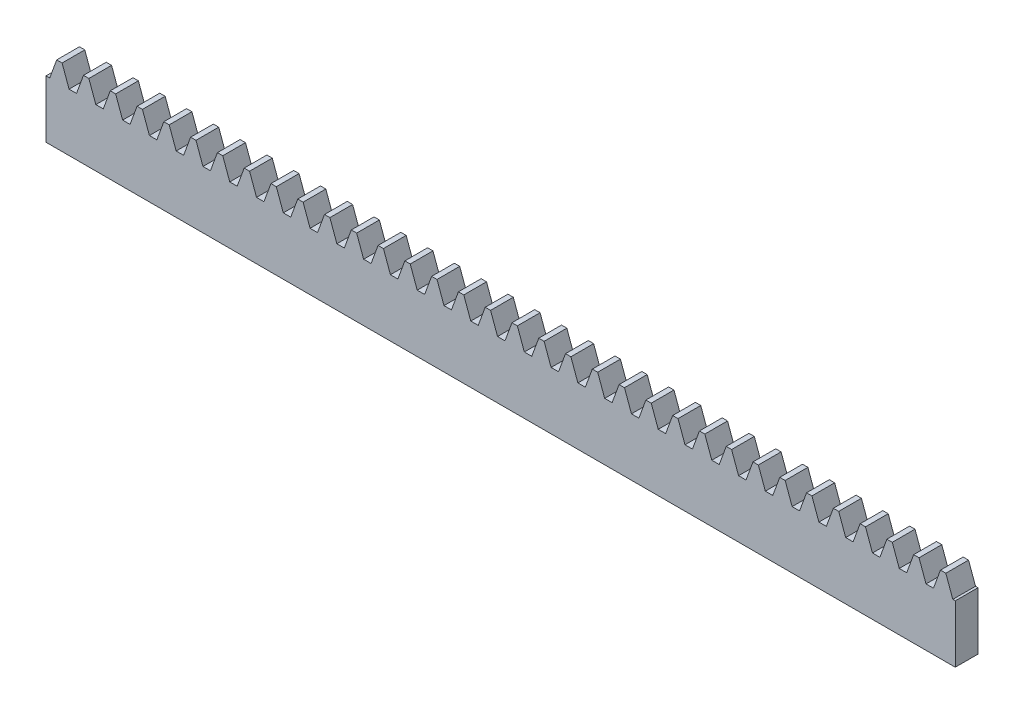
ISO-10303-21;
HEADER;
FILE_DESCRIPTION(('STEP AP214'),'2;1');
FILE_NAME('part.step','',(''),(''),'','','');
FILE_SCHEMA(('AUTOMOTIVE_DESIGN { 1 0 10303 214 1 1 1 1 }'));
ENDSEC;
DATA;
#1=APPLICATION_CONTEXT('core data for automotive mechanical design processes');
#2=APPLICATION_PROTOCOL_DEFINITION('international standard','automotive_design',2000,#1);
#3=PRODUCT_CONTEXT('',#1,'mechanical');
#4=PRODUCT('Part','Part','',(#3));
#5=PRODUCT_RELATED_PRODUCT_CATEGORY('part','',(#4));
#6=PRODUCT_DEFINITION_FORMATION('','',#4);
#7=PRODUCT_DEFINITION_CONTEXT('part definition',#1,'design');
#8=PRODUCT_DEFINITION('design','',#6,#7);
#9=PRODUCT_DEFINITION_SHAPE('','',#8);
#10=(LENGTH_UNIT() NAMED_UNIT(*) SI_UNIT(.MILLI.,.METRE.));
#11=(NAMED_UNIT(*) PLANE_ANGLE_UNIT() SI_UNIT($,.RADIAN.));
#12=(NAMED_UNIT(*) SI_UNIT($,.STERADIAN.) SOLID_ANGLE_UNIT());
#13=UNCERTAINTY_MEASURE_WITH_UNIT(LENGTH_MEASURE(1.E-05),#10,'distance_accuracy_value','');
#14=(GEOMETRIC_REPRESENTATION_CONTEXT(3) GLOBAL_UNCERTAINTY_ASSIGNED_CONTEXT((#13)) GLOBAL_UNIT_ASSIGNED_CONTEXT((#10,
#11,#12)) REPRESENTATION_CONTEXT('',''));
#15=CARTESIAN_POINT('',(0.,0.,0.));
#16=DIRECTION('',(0.,0.,1.));
#17=DIRECTION('',(1.,0.,0.));
#18=AXIS2_PLACEMENT_3D('',#15,#16,#17);
#19=CARTESIAN_POINT('',(0.,13.5,-4.));
#20=DIRECTION('',(0.,1.,0.));
#21=DIRECTION('',(0.,0.,1.));
#22=AXIS2_PLACEMENT_3D('',#19,#20,#21);
#23=PLANE('',#22);
#24=DIRECTION('',(0.,0.,1.));
#25=VECTOR('',#24,1.);
#26=CARTESIAN_POINT('',(153.625783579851,13.5,-4.));
#27=LINE('',#26,#25);
#28=CARTESIAN_POINT('',(153.625783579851,13.5,-4.));
#29=VERTEX_POINT('',#28);
#30=CARTESIAN_POINT('',(153.625783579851,13.5,0.));
#31=VERTEX_POINT('',#30);
#32=EDGE_CURVE('E936',#29,#31,#27,.T.);
#33=ORIENTED_EDGE('',*,*,#32,.F.);
#34=DIRECTION('',(-1.,0.,0.));
#35=VECTOR('',#34,1.);
#36=CARTESIAN_POINT('',(0.,13.5,-4.));
#37=LINE('',#36,#35);
#38=CARTESIAN_POINT('',(152.679499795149,13.5,-4.));
#39=VERTEX_POINT('',#38);
#40=EDGE_CURVE('E1735',#29,#39,#37,.T.);
#41=ORIENTED_EDGE('',*,*,#40,.T.);
#42=DIRECTION('',(0.,0.,-1.));
#43=VECTOR('',#42,1.);
#44=CARTESIAN_POINT('',(152.679499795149,13.5,-4.));
#45=LINE('',#44,#43);
#46=CARTESIAN_POINT('',(152.679499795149,13.5,0.));
#47=VERTEX_POINT('',#46);
#48=EDGE_CURVE('E956',#47,#39,#45,.T.);
#49=ORIENTED_EDGE('',*,*,#48,.F.);
#50=DIRECTION('',(-1.,0.,0.));
#51=VECTOR('',#50,1.);
#52=CARTESIAN_POINT('',(0.,13.5,0.));
#53=LINE('',#52,#51);
#54=EDGE_CURVE('E1745',#31,#47,#53,.T.);
#55=ORIENTED_EDGE('',*,*,#54,.F.);
#56=EDGE_LOOP('',(#33,#41,#49,#55));
#57=FACE_BOUND('',#56,.T.);
#58=ADVANCED_FACE('F35',(#57),#23,.T.);
#59=DIRECTION('',(0.,0.,1.));
#60=VECTOR('',#59,1.);
#61=CARTESIAN_POINT('',(148.913394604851,13.5,-4.));
#62=LINE('',#61,#60);
#63=CARTESIAN_POINT('',(148.913394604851,13.5,-4.));
#64=VERTEX_POINT('',#63);
#65=CARTESIAN_POINT('',(148.913394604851,13.5,0.));
#66=VERTEX_POINT('',#65);
#67=EDGE_CURVE('E960',#64,#66,#62,.T.);
#68=ORIENTED_EDGE('',*,*,#67,.F.);
#69=CARTESIAN_POINT('',(147.967110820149,13.5,-4.));
#70=VERTEX_POINT('',#69);
#71=EDGE_CURVE('E2111',#64,#70,#37,.T.);
#72=ORIENTED_EDGE('',*,*,#71,.T.);
#73=DIRECTION('',(0.,0.,-1.));
#74=VECTOR('',#73,1.);
#75=CARTESIAN_POINT('',(147.967110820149,13.5,-4.));
#76=LINE('',#75,#74);
#77=CARTESIAN_POINT('',(147.967110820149,13.5,0.));
#78=VERTEX_POINT('',#77);
#79=EDGE_CURVE('E980',#78,#70,#76,.T.);
#80=ORIENTED_EDGE('',*,*,#79,.F.);
#81=EDGE_CURVE('E1860',#66,#78,#53,.T.);
#82=ORIENTED_EDGE('',*,*,#81,.F.);
#83=EDGE_LOOP('',(#68,#72,#80,#82));
#84=FACE_BOUND('',#83,.T.);
#85=ADVANCED_FACE('F2129',(#84),#23,.T.);
#86=DIRECTION('',(0.,0.,1.));
#87=VECTOR('',#86,1.);
#88=CARTESIAN_POINT('',(144.201005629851,13.5,-4.));
#89=LINE('',#88,#87);
#90=CARTESIAN_POINT('',(144.201005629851,13.5,-4.));
#91=VERTEX_POINT('',#90);
#92=CARTESIAN_POINT('',(144.201005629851,13.5,0.));
#93=VERTEX_POINT('',#92);
#94=EDGE_CURVE('E984',#91,#93,#89,.T.);
#95=ORIENTED_EDGE('',*,*,#94,.F.);
#96=CARTESIAN_POINT('',(143.254721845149,13.5,-4.));
#97=VERTEX_POINT('',#96);
#98=EDGE_CURVE('E2106',#91,#97,#37,.T.);
#99=ORIENTED_EDGE('',*,*,#98,.T.);
#100=DIRECTION('',(0.,0.,-1.));
#101=VECTOR('',#100,1.);
#102=CARTESIAN_POINT('',(143.254721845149,13.5,-4.));
#103=LINE('',#102,#101);
#104=CARTESIAN_POINT('',(143.254721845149,13.5,0.));
#105=VERTEX_POINT('',#104);
#106=EDGE_CURVE('E1004',#105,#97,#103,.T.);
#107=ORIENTED_EDGE('',*,*,#106,.F.);
#108=EDGE_CURVE('E1861',#93,#105,#53,.T.);
#109=ORIENTED_EDGE('',*,*,#108,.F.);
#110=EDGE_LOOP('',(#95,#99,#107,#109));
#111=FACE_BOUND('',#110,.T.);
#112=ADVANCED_FACE('F2139',(#111),#23,.T.);
#113=DIRECTION('',(0.,0.,1.));
#114=VECTOR('',#113,1.);
#115=CARTESIAN_POINT('',(139.488616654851,13.5,-4.));
#116=LINE('',#115,#114);
#117=CARTESIAN_POINT('',(139.488616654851,13.5,-4.));
#118=VERTEX_POINT('',#117);
#119=CARTESIAN_POINT('',(139.488616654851,13.5,0.));
#120=VERTEX_POINT('',#119);
#121=EDGE_CURVE('E1008',#118,#120,#116,.T.);
#122=ORIENTED_EDGE('',*,*,#121,.F.);
#123=CARTESIAN_POINT('',(138.542332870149,13.5,-4.));
#124=VERTEX_POINT('',#123);
#125=EDGE_CURVE('E2101',#118,#124,#37,.T.);
#126=ORIENTED_EDGE('',*,*,#125,.T.);
#127=DIRECTION('',(0.,0.,-1.));
#128=VECTOR('',#127,1.);
#129=CARTESIAN_POINT('',(138.542332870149,13.5,-4.));
#130=LINE('',#129,#128);
#131=CARTESIAN_POINT('',(138.542332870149,13.5,0.));
#132=VERTEX_POINT('',#131);
#133=EDGE_CURVE('E1028',#132,#124,#130,.T.);
#134=ORIENTED_EDGE('',*,*,#133,.F.);
#135=EDGE_CURVE('E1864',#120,#132,#53,.T.);
#136=ORIENTED_EDGE('',*,*,#135,.F.);
#137=EDGE_LOOP('',(#122,#126,#134,#136));
#138=FACE_BOUND('',#137,.T.);
#139=ADVANCED_FACE('F2149',(#138),#23,.T.);
#140=DIRECTION('',(0.,0.,1.));
#141=VECTOR('',#140,1.);
#142=CARTESIAN_POINT('',(134.776227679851,13.5,-4.));
#143=LINE('',#142,#141);
#144=CARTESIAN_POINT('',(134.776227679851,13.5,-4.));
#145=VERTEX_POINT('',#144);
#146=CARTESIAN_POINT('',(134.776227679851,13.5,0.));
#147=VERTEX_POINT('',#146);
#148=EDGE_CURVE('E1032',#145,#147,#143,.T.);
#149=ORIENTED_EDGE('',*,*,#148,.F.);
#150=CARTESIAN_POINT('',(133.829943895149,13.5,-4.));
#151=VERTEX_POINT('',#150);
#152=EDGE_CURVE('E2096',#145,#151,#37,.T.);
#153=ORIENTED_EDGE('',*,*,#152,.T.);
#154=DIRECTION('',(0.,0.,-1.));
#155=VECTOR('',#154,1.);
#156=CARTESIAN_POINT('',(133.829943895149,13.5,-4.));
#157=LINE('',#156,#155);
#158=CARTESIAN_POINT('',(133.829943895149,13.5,0.));
#159=VERTEX_POINT('',#158);
#160=EDGE_CURVE('E1052',#159,#151,#157,.T.);
#161=ORIENTED_EDGE('',*,*,#160,.F.);
#162=EDGE_CURVE('E1867',#147,#159,#53,.T.);
#163=ORIENTED_EDGE('',*,*,#162,.F.);
#164=EDGE_LOOP('',(#149,#153,#161,#163));
#165=FACE_BOUND('',#164,.T.);
#166=ADVANCED_FACE('F2159',(#165),#23,.T.);
#167=DIRECTION('',(0.,0.,1.));
#168=VECTOR('',#167,1.);
#169=CARTESIAN_POINT('',(130.063838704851,13.5,-4.));
#170=LINE('',#169,#168);
#171=CARTESIAN_POINT('',(130.063838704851,13.5,-4.));
#172=VERTEX_POINT('',#171);
#173=CARTESIAN_POINT('',(130.063838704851,13.5,0.));
#174=VERTEX_POINT('',#173);
#175=EDGE_CURVE('E1056',#172,#174,#170,.T.);
#176=ORIENTED_EDGE('',*,*,#175,.F.);
#177=CARTESIAN_POINT('',(129.117554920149,13.5,-4.));
#178=VERTEX_POINT('',#177);
#179=EDGE_CURVE('E2091',#172,#178,#37,.T.);
#180=ORIENTED_EDGE('',*,*,#179,.T.);
#181=DIRECTION('',(0.,0.,-1.));
#182=VECTOR('',#181,1.);
#183=CARTESIAN_POINT('',(129.117554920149,13.5,-4.));
#184=LINE('',#183,#182);
#185=CARTESIAN_POINT('',(129.117554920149,13.5,0.));
#186=VERTEX_POINT('',#185);
#187=EDGE_CURVE('E1076',#186,#178,#184,.T.);
#188=ORIENTED_EDGE('',*,*,#187,.F.);
#189=EDGE_CURVE('E1870',#174,#186,#53,.T.);
#190=ORIENTED_EDGE('',*,*,#189,.F.);
#191=EDGE_LOOP('',(#176,#180,#188,#190));
#192=FACE_BOUND('',#191,.T.);
#193=ADVANCED_FACE('F2169',(#192),#23,.T.);
#194=DIRECTION('',(0.,0.,1.));
#195=VECTOR('',#194,1.);
#196=CARTESIAN_POINT('',(125.351449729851,13.5,-4.));
#197=LINE('',#196,#195);
#198=CARTESIAN_POINT('',(125.351449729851,13.5,-4.));
#199=VERTEX_POINT('',#198);
#200=CARTESIAN_POINT('',(125.351449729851,13.5,0.));
#201=VERTEX_POINT('',#200);
#202=EDGE_CURVE('E1080',#199,#201,#197,.T.);
#203=ORIENTED_EDGE('',*,*,#202,.F.);
#204=CARTESIAN_POINT('',(124.405165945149,13.5,-4.));
#205=VERTEX_POINT('',#204);
#206=EDGE_CURVE('E2086',#199,#205,#37,.T.);
#207=ORIENTED_EDGE('',*,*,#206,.T.);
#208=DIRECTION('',(0.,0.,-1.));
#209=VECTOR('',#208,1.);
#210=CARTESIAN_POINT('',(124.405165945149,13.5,-4.));
#211=LINE('',#210,#209);
#212=CARTESIAN_POINT('',(124.405165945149,13.5,0.));
#213=VERTEX_POINT('',#212);
#214=EDGE_CURVE('E1100',#213,#205,#211,.T.);
#215=ORIENTED_EDGE('',*,*,#214,.F.);
#216=EDGE_CURVE('E1873',#201,#213,#53,.T.);
#217=ORIENTED_EDGE('',*,*,#216,.F.);
#218=EDGE_LOOP('',(#203,#207,#215,#217));
#219=FACE_BOUND('',#218,.T.);
#220=ADVANCED_FACE('F2179',(#219),#23,.T.);
#221=DIRECTION('',(0.,0.,1.));
#222=VECTOR('',#221,1.);
#223=CARTESIAN_POINT('',(120.639060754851,13.5,-4.));
#224=LINE('',#223,#222);
#225=CARTESIAN_POINT('',(120.639060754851,13.5,-4.));
#226=VERTEX_POINT('',#225);
#227=CARTESIAN_POINT('',(120.639060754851,13.5,0.));
#228=VERTEX_POINT('',#227);
#229=EDGE_CURVE('E1104',#226,#228,#224,.T.);
#230=ORIENTED_EDGE('',*,*,#229,.F.);
#231=CARTESIAN_POINT('',(119.692776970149,13.5,-4.));
#232=VERTEX_POINT('',#231);
#233=EDGE_CURVE('E2081',#226,#232,#37,.T.);
#234=ORIENTED_EDGE('',*,*,#233,.T.);
#235=DIRECTION('',(0.,0.,-1.));
#236=VECTOR('',#235,1.);
#237=CARTESIAN_POINT('',(119.692776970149,13.5,-4.));
#238=LINE('',#237,#236);
#239=CARTESIAN_POINT('',(119.692776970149,13.5,0.));
#240=VERTEX_POINT('',#239);
#241=EDGE_CURVE('E1124',#240,#232,#238,.T.);
#242=ORIENTED_EDGE('',*,*,#241,.F.);
#243=EDGE_CURVE('E1876',#228,#240,#53,.T.);
#244=ORIENTED_EDGE('',*,*,#243,.F.);
#245=EDGE_LOOP('',(#230,#234,#242,#244));
#246=FACE_BOUND('',#245,.T.);
#247=ADVANCED_FACE('F2189',(#246),#23,.T.);
#248=DIRECTION('',(0.,0.,1.));
#249=VECTOR('',#248,1.);
#250=CARTESIAN_POINT('',(115.926671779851,13.5,-4.));
#251=LINE('',#250,#249);
#252=CARTESIAN_POINT('',(115.926671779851,13.5,-4.));
#253=VERTEX_POINT('',#252);
#254=CARTESIAN_POINT('',(115.926671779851,13.5,0.));
#255=VERTEX_POINT('',#254);
#256=EDGE_CURVE('E1128',#253,#255,#251,.T.);
#257=ORIENTED_EDGE('',*,*,#256,.F.);
#258=CARTESIAN_POINT('',(114.980387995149,13.5,-4.));
#259=VERTEX_POINT('',#258);
#260=EDGE_CURVE('E2076',#253,#259,#37,.T.);
#261=ORIENTED_EDGE('',*,*,#260,.T.);
#262=DIRECTION('',(0.,0.,-1.));
#263=VECTOR('',#262,1.);
#264=CARTESIAN_POINT('',(114.980387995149,13.5,-4.));
#265=LINE('',#264,#263);
#266=CARTESIAN_POINT('',(114.980387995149,13.5,0.));
#267=VERTEX_POINT('',#266);
#268=EDGE_CURVE('E1148',#267,#259,#265,.T.);
#269=ORIENTED_EDGE('',*,*,#268,.F.);
#270=EDGE_CURVE('E1879',#255,#267,#53,.T.);
#271=ORIENTED_EDGE('',*,*,#270,.F.);
#272=EDGE_LOOP('',(#257,#261,#269,#271));
#273=FACE_BOUND('',#272,.T.);
#274=ADVANCED_FACE('F2199',(#273),#23,.T.);
#275=DIRECTION('',(0.,0.,1.));
#276=VECTOR('',#275,1.);
#277=CARTESIAN_POINT('',(111.214282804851,13.5,-4.));
#278=LINE('',#277,#276);
#279=CARTESIAN_POINT('',(111.214282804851,13.5,-4.));
#280=VERTEX_POINT('',#279);
#281=CARTESIAN_POINT('',(111.214282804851,13.5,0.));
#282=VERTEX_POINT('',#281);
#283=EDGE_CURVE('E1152',#280,#282,#278,.T.);
#284=ORIENTED_EDGE('',*,*,#283,.F.);
#285=CARTESIAN_POINT('',(110.267999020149,13.5,-4.));
#286=VERTEX_POINT('',#285);
#287=EDGE_CURVE('E2071',#280,#286,#37,.T.);
#288=ORIENTED_EDGE('',*,*,#287,.T.);
#289=DIRECTION('',(0.,0.,-1.));
#290=VECTOR('',#289,1.);
#291=CARTESIAN_POINT('',(110.267999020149,13.5,-4.));
#292=LINE('',#291,#290);
#293=CARTESIAN_POINT('',(110.267999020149,13.5,0.));
#294=VERTEX_POINT('',#293);
#295=EDGE_CURVE('E1172',#294,#286,#292,.T.);
#296=ORIENTED_EDGE('',*,*,#295,.F.);
#297=EDGE_CURVE('E1882',#282,#294,#53,.T.);
#298=ORIENTED_EDGE('',*,*,#297,.F.);
#299=EDGE_LOOP('',(#284,#288,#296,#298));
#300=FACE_BOUND('',#299,.T.);
#301=ADVANCED_FACE('F2209',(#300),#23,.T.);
#302=DIRECTION('',(0.,0.,1.));
#303=VECTOR('',#302,1.);
#304=CARTESIAN_POINT('',(106.501893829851,13.5,-4.));
#305=LINE('',#304,#303);
#306=CARTESIAN_POINT('',(106.501893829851,13.5,-4.));
#307=VERTEX_POINT('',#306);
#308=CARTESIAN_POINT('',(106.501893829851,13.5,0.));
#309=VERTEX_POINT('',#308);
#310=EDGE_CURVE('E1176',#307,#309,#305,.T.);
#311=ORIENTED_EDGE('',*,*,#310,.F.);
#312=CARTESIAN_POINT('',(105.555610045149,13.5,-4.));
#313=VERTEX_POINT('',#312);
#314=EDGE_CURVE('E2066',#307,#313,#37,.T.);
#315=ORIENTED_EDGE('',*,*,#314,.T.);
#316=DIRECTION('',(0.,0.,-1.));
#317=VECTOR('',#316,1.);
#318=CARTESIAN_POINT('',(105.555610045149,13.5,-4.));
#319=LINE('',#318,#317);
#320=CARTESIAN_POINT('',(105.555610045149,13.5,0.));
#321=VERTEX_POINT('',#320);
#322=EDGE_CURVE('E1196',#321,#313,#319,.T.);
#323=ORIENTED_EDGE('',*,*,#322,.F.);
#324=EDGE_CURVE('E1885',#309,#321,#53,.T.);
#325=ORIENTED_EDGE('',*,*,#324,.F.);
#326=EDGE_LOOP('',(#311,#315,#323,#325));
#327=FACE_BOUND('',#326,.T.);
#328=ADVANCED_FACE('F2219',(#327),#23,.T.);
#329=DIRECTION('',(0.,0.,1.));
#330=VECTOR('',#329,1.);
#331=CARTESIAN_POINT('',(101.789504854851,13.5,-4.));
#332=LINE('',#331,#330);
#333=CARTESIAN_POINT('',(101.789504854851,13.5,-4.));
#334=VERTEX_POINT('',#333);
#335=CARTESIAN_POINT('',(101.789504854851,13.5,0.));
#336=VERTEX_POINT('',#335);
#337=EDGE_CURVE('E1200',#334,#336,#332,.T.);
#338=ORIENTED_EDGE('',*,*,#337,.F.);
#339=CARTESIAN_POINT('',(100.843221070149,13.5,-4.));
#340=VERTEX_POINT('',#339);
#341=EDGE_CURVE('E2061',#334,#340,#37,.T.);
#342=ORIENTED_EDGE('',*,*,#341,.T.);
#343=DIRECTION('',(0.,0.,-1.));
#344=VECTOR('',#343,1.);
#345=CARTESIAN_POINT('',(100.843221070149,13.5,-4.));
#346=LINE('',#345,#344);
#347=CARTESIAN_POINT('',(100.843221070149,13.5,0.));
#348=VERTEX_POINT('',#347);
#349=EDGE_CURVE('E1220',#348,#340,#346,.T.);
#350=ORIENTED_EDGE('',*,*,#349,.F.);
#351=EDGE_CURVE('E1888',#336,#348,#53,.T.);
#352=ORIENTED_EDGE('',*,*,#351,.F.);
#353=EDGE_LOOP('',(#338,#342,#350,#352));
#354=FACE_BOUND('',#353,.T.);
#355=ADVANCED_FACE('F2229',(#354),#23,.T.);
#356=DIRECTION('',(0.,0.,1.));
#357=VECTOR('',#356,1.);
#358=CARTESIAN_POINT('',(97.0771158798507,13.5,-4.));
#359=LINE('',#358,#357);
#360=CARTESIAN_POINT('',(97.0771158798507,13.5,-4.));
#361=VERTEX_POINT('',#360);
#362=CARTESIAN_POINT('',(97.0771158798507,13.5,0.));
#363=VERTEX_POINT('',#362);
#364=EDGE_CURVE('E1224',#361,#363,#359,.T.);
#365=ORIENTED_EDGE('',*,*,#364,.F.);
#366=CARTESIAN_POINT('',(96.1308320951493,13.5,-4.));
#367=VERTEX_POINT('',#366);
#368=EDGE_CURVE('E2056',#361,#367,#37,.T.);
#369=ORIENTED_EDGE('',*,*,#368,.T.);
#370=DIRECTION('',(0.,0.,-1.));
#371=VECTOR('',#370,1.);
#372=CARTESIAN_POINT('',(96.1308320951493,13.5,-4.));
#373=LINE('',#372,#371);
#374=CARTESIAN_POINT('',(96.1308320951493,13.5,0.));
#375=VERTEX_POINT('',#374);
#376=EDGE_CURVE('E1244',#375,#367,#373,.T.);
#377=ORIENTED_EDGE('',*,*,#376,.F.);
#378=EDGE_CURVE('E1891',#363,#375,#53,.T.);
#379=ORIENTED_EDGE('',*,*,#378,.F.);
#380=EDGE_LOOP('',(#365,#369,#377,#379));
#381=FACE_BOUND('',#380,.T.);
#382=ADVANCED_FACE('F2239',(#381),#23,.T.);
#383=DIRECTION('',(0.,0.,1.));
#384=VECTOR('',#383,1.);
#385=CARTESIAN_POINT('',(92.3647269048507,13.5,-4.));
#386=LINE('',#385,#384);
#387=CARTESIAN_POINT('',(92.3647269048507,13.5,-4.));
#388=VERTEX_POINT('',#387);
#389=CARTESIAN_POINT('',(92.3647269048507,13.5,0.));
#390=VERTEX_POINT('',#389);
#391=EDGE_CURVE('E1248',#388,#390,#386,.T.);
#392=ORIENTED_EDGE('',*,*,#391,.F.);
#393=CARTESIAN_POINT('',(91.4184431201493,13.5,-4.));
#394=VERTEX_POINT('',#393);
#395=EDGE_CURVE('E2051',#388,#394,#37,.T.);
#396=ORIENTED_EDGE('',*,*,#395,.T.);
#397=DIRECTION('',(0.,0.,-1.));
#398=VECTOR('',#397,1.);
#399=CARTESIAN_POINT('',(91.4184431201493,13.5,-4.));
#400=LINE('',#399,#398);
#401=CARTESIAN_POINT('',(91.4184431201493,13.5,0.));
#402=VERTEX_POINT('',#401);
#403=EDGE_CURVE('E1268',#402,#394,#400,.T.);
#404=ORIENTED_EDGE('',*,*,#403,.F.);
#405=EDGE_CURVE('E1894',#390,#402,#53,.T.);
#406=ORIENTED_EDGE('',*,*,#405,.F.);
#407=EDGE_LOOP('',(#392,#396,#404,#406));
#408=FACE_BOUND('',#407,.T.);
#409=ADVANCED_FACE('F2249',(#408),#23,.T.);
#410=DIRECTION('',(0.,0.,1.));
#411=VECTOR('',#410,1.);
#412=CARTESIAN_POINT('',(87.6523379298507,13.5,-4.));
#413=LINE('',#412,#411);
#414=CARTESIAN_POINT('',(87.6523379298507,13.5,-4.));
#415=VERTEX_POINT('',#414);
#416=CARTESIAN_POINT('',(87.6523379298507,13.5,0.));
#417=VERTEX_POINT('',#416);
#418=EDGE_CURVE('E1272',#415,#417,#413,.T.);
#419=ORIENTED_EDGE('',*,*,#418,.F.);
#420=CARTESIAN_POINT('',(86.7060541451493,13.5,-4.));
#421=VERTEX_POINT('',#420);
#422=EDGE_CURVE('E2046',#415,#421,#37,.T.);
#423=ORIENTED_EDGE('',*,*,#422,.T.);
#424=DIRECTION('',(0.,0.,-1.));
#425=VECTOR('',#424,1.);
#426=CARTESIAN_POINT('',(86.7060541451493,13.5,-4.));
#427=LINE('',#426,#425);
#428=CARTESIAN_POINT('',(86.7060541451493,13.5,0.));
#429=VERTEX_POINT('',#428);
#430=EDGE_CURVE('E1292',#429,#421,#427,.T.);
#431=ORIENTED_EDGE('',*,*,#430,.F.);
#432=EDGE_CURVE('E1897',#417,#429,#53,.T.);
#433=ORIENTED_EDGE('',*,*,#432,.F.);
#434=EDGE_LOOP('',(#419,#423,#431,#433));
#435=FACE_BOUND('',#434,.T.);
#436=ADVANCED_FACE('F2259',(#435),#23,.T.);
#437=DIRECTION('',(0.,0.,1.));
#438=VECTOR('',#437,1.);
#439=CARTESIAN_POINT('',(82.9399489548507,13.5,-4.));
#440=LINE('',#439,#438);
#441=CARTESIAN_POINT('',(82.9399489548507,13.5,-4.));
#442=VERTEX_POINT('',#441);
#443=CARTESIAN_POINT('',(82.9399489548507,13.5,0.));
#444=VERTEX_POINT('',#443);
#445=EDGE_CURVE('E1296',#442,#444,#440,.T.);
#446=ORIENTED_EDGE('',*,*,#445,.F.);
#447=CARTESIAN_POINT('',(81.9936651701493,13.5,-4.));
#448=VERTEX_POINT('',#447);
#449=EDGE_CURVE('E2041',#442,#448,#37,.T.);
#450=ORIENTED_EDGE('',*,*,#449,.T.);
#451=DIRECTION('',(0.,0.,-1.));
#452=VECTOR('',#451,1.);
#453=CARTESIAN_POINT('',(81.9936651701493,13.5,-4.));
#454=LINE('',#453,#452);
#455=CARTESIAN_POINT('',(81.9936651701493,13.5,0.));
#456=VERTEX_POINT('',#455);
#457=EDGE_CURVE('E1316',#456,#448,#454,.T.);
#458=ORIENTED_EDGE('',*,*,#457,.F.);
#459=EDGE_CURVE('E1900',#444,#456,#53,.T.);
#460=ORIENTED_EDGE('',*,*,#459,.F.);
#461=EDGE_LOOP('',(#446,#450,#458,#460));
#462=FACE_BOUND('',#461,.T.);
#463=ADVANCED_FACE('F2269',(#462),#23,.T.);
#464=DIRECTION('',(0.,0.,1.));
#465=VECTOR('',#464,1.);
#466=CARTESIAN_POINT('',(78.2275599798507,13.5,-4.));
#467=LINE('',#466,#465);
#468=CARTESIAN_POINT('',(78.2275599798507,13.5,-4.));
#469=VERTEX_POINT('',#468);
#470=CARTESIAN_POINT('',(78.2275599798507,13.5,0.));
#471=VERTEX_POINT('',#470);
#472=EDGE_CURVE('E1320',#469,#471,#467,.T.);
#473=ORIENTED_EDGE('',*,*,#472,.F.);
#474=CARTESIAN_POINT('',(77.2812761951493,13.5,-4.));
#475=VERTEX_POINT('',#474);
#476=EDGE_CURVE('E2036',#469,#475,#37,.T.);
#477=ORIENTED_EDGE('',*,*,#476,.T.);
#478=DIRECTION('',(0.,0.,-1.));
#479=VECTOR('',#478,1.);
#480=CARTESIAN_POINT('',(77.2812761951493,13.5,-4.));
#481=LINE('',#480,#479);
#482=CARTESIAN_POINT('',(77.2812761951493,13.5,0.));
#483=VERTEX_POINT('',#482);
#484=EDGE_CURVE('E1340',#483,#475,#481,.T.);
#485=ORIENTED_EDGE('',*,*,#484,.F.);
#486=EDGE_CURVE('E1903',#471,#483,#53,.T.);
#487=ORIENTED_EDGE('',*,*,#486,.F.);
#488=EDGE_LOOP('',(#473,#477,#485,#487));
#489=FACE_BOUND('',#488,.T.);
#490=ADVANCED_FACE('F2279',(#489),#23,.T.);
#491=DIRECTION('',(0.,0.,1.));
#492=VECTOR('',#491,1.);
#493=CARTESIAN_POINT('',(73.5151710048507,13.5,-4.));
#494=LINE('',#493,#492);
#495=CARTESIAN_POINT('',(73.5151710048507,13.5,-4.));
#496=VERTEX_POINT('',#495);
#497=CARTESIAN_POINT('',(73.5151710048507,13.5,0.));
#498=VERTEX_POINT('',#497);
#499=EDGE_CURVE('E1344',#496,#498,#494,.T.);
#500=ORIENTED_EDGE('',*,*,#499,.F.);
#501=CARTESIAN_POINT('',(72.5688872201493,13.5,-4.));
#502=VERTEX_POINT('',#501);
#503=EDGE_CURVE('E2031',#496,#502,#37,.T.);
#504=ORIENTED_EDGE('',*,*,#503,.T.);
#505=DIRECTION('',(0.,0.,-1.));
#506=VECTOR('',#505,1.);
#507=CARTESIAN_POINT('',(72.5688872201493,13.5,-4.));
#508=LINE('',#507,#506);
#509=CARTESIAN_POINT('',(72.5688872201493,13.5,0.));
#510=VERTEX_POINT('',#509);
#511=EDGE_CURVE('E1364',#510,#502,#508,.T.);
#512=ORIENTED_EDGE('',*,*,#511,.F.);
#513=EDGE_CURVE('E1906',#498,#510,#53,.T.);
#514=ORIENTED_EDGE('',*,*,#513,.F.);
#515=EDGE_LOOP('',(#500,#504,#512,#514));
#516=FACE_BOUND('',#515,.T.);
#517=ADVANCED_FACE('F2289',(#516),#23,.T.);
#518=DIRECTION('',(0.,0.,1.));
#519=VECTOR('',#518,1.);
#520=CARTESIAN_POINT('',(68.8027820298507,13.5,-4.));
#521=LINE('',#520,#519);
#522=CARTESIAN_POINT('',(68.8027820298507,13.5,-4.));
#523=VERTEX_POINT('',#522);
#524=CARTESIAN_POINT('',(68.8027820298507,13.5,0.));
#525=VERTEX_POINT('',#524);
#526=EDGE_CURVE('E1368',#523,#525,#521,.T.);
#527=ORIENTED_EDGE('',*,*,#526,.F.);
#528=CARTESIAN_POINT('',(67.8564982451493,13.5,-4.));
#529=VERTEX_POINT('',#528);
#530=EDGE_CURVE('E2026',#523,#529,#37,.T.);
#531=ORIENTED_EDGE('',*,*,#530,.T.);
#532=DIRECTION('',(0.,0.,-1.));
#533=VECTOR('',#532,1.);
#534=CARTESIAN_POINT('',(67.8564982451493,13.5,-4.));
#535=LINE('',#534,#533);
#536=CARTESIAN_POINT('',(67.8564982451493,13.5,0.));
#537=VERTEX_POINT('',#536);
#538=EDGE_CURVE('E1388',#537,#529,#535,.T.);
#539=ORIENTED_EDGE('',*,*,#538,.F.);
#540=EDGE_CURVE('E1909',#525,#537,#53,.T.);
#541=ORIENTED_EDGE('',*,*,#540,.F.);
#542=EDGE_LOOP('',(#527,#531,#539,#541));
#543=FACE_BOUND('',#542,.T.);
#544=ADVANCED_FACE('F2299',(#543),#23,.T.);
#545=DIRECTION('',(0.,0.,1.));
#546=VECTOR('',#545,1.);
#547=CARTESIAN_POINT('',(64.0903930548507,13.5,-4.));
#548=LINE('',#547,#546);
#549=CARTESIAN_POINT('',(64.0903930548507,13.5,-4.));
#550=VERTEX_POINT('',#549);
#551=CARTESIAN_POINT('',(64.0903930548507,13.5,0.));
#552=VERTEX_POINT('',#551);
#553=EDGE_CURVE('E1392',#550,#552,#548,.T.);
#554=ORIENTED_EDGE('',*,*,#553,.F.);
#555=CARTESIAN_POINT('',(63.1441092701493,13.5,-4.));
#556=VERTEX_POINT('',#555);
#557=EDGE_CURVE('E2021',#550,#556,#37,.T.);
#558=ORIENTED_EDGE('',*,*,#557,.T.);
#559=DIRECTION('',(0.,0.,-1.));
#560=VECTOR('',#559,1.);
#561=CARTESIAN_POINT('',(63.1441092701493,13.5,-4.));
#562=LINE('',#561,#560);
#563=CARTESIAN_POINT('',(63.1441092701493,13.5,0.));
#564=VERTEX_POINT('',#563);
#565=EDGE_CURVE('E1412',#564,#556,#562,.T.);
#566=ORIENTED_EDGE('',*,*,#565,.F.);
#567=EDGE_CURVE('E1912',#552,#564,#53,.T.);
#568=ORIENTED_EDGE('',*,*,#567,.F.);
#569=EDGE_LOOP('',(#554,#558,#566,#568));
#570=FACE_BOUND('',#569,.T.);
#571=ADVANCED_FACE('F2309',(#570),#23,.T.);
#572=DIRECTION('',(0.,0.,1.));
#573=VECTOR('',#572,1.);
#574=CARTESIAN_POINT('',(59.3780040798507,13.5,-4.));
#575=LINE('',#574,#573);
#576=CARTESIAN_POINT('',(59.3780040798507,13.5,-4.));
#577=VERTEX_POINT('',#576);
#578=CARTESIAN_POINT('',(59.3780040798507,13.5,0.));
#579=VERTEX_POINT('',#578);
#580=EDGE_CURVE('E1416',#577,#579,#575,.T.);
#581=ORIENTED_EDGE('',*,*,#580,.F.);
#582=CARTESIAN_POINT('',(58.4317202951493,13.5,-4.));
#583=VERTEX_POINT('',#582);
#584=EDGE_CURVE('E2016',#577,#583,#37,.T.);
#585=ORIENTED_EDGE('',*,*,#584,.T.);
#586=DIRECTION('',(0.,0.,-1.));
#587=VECTOR('',#586,1.);
#588=CARTESIAN_POINT('',(58.4317202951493,13.5,-4.));
#589=LINE('',#588,#587);
#590=CARTESIAN_POINT('',(58.4317202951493,13.5,0.));
#591=VERTEX_POINT('',#590);
#592=EDGE_CURVE('E1436',#591,#583,#589,.T.);
#593=ORIENTED_EDGE('',*,*,#592,.F.);
#594=EDGE_CURVE('E1915',#579,#591,#53,.T.);
#595=ORIENTED_EDGE('',*,*,#594,.F.);
#596=EDGE_LOOP('',(#581,#585,#593,#595));
#597=FACE_BOUND('',#596,.T.);
#598=ADVANCED_FACE('F2319',(#597),#23,.T.);
#599=DIRECTION('',(0.,0.,1.));
#600=VECTOR('',#599,1.);
#601=CARTESIAN_POINT('',(54.6656151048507,13.5,-4.));
#602=LINE('',#601,#600);
#603=CARTESIAN_POINT('',(54.6656151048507,13.5,-4.));
#604=VERTEX_POINT('',#603);
#605=CARTESIAN_POINT('',(54.6656151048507,13.5,0.));
#606=VERTEX_POINT('',#605);
#607=EDGE_CURVE('E1440',#604,#606,#602,.T.);
#608=ORIENTED_EDGE('',*,*,#607,.F.);
#609=CARTESIAN_POINT('',(53.7193313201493,13.5,-4.));
#610=VERTEX_POINT('',#609);
#611=EDGE_CURVE('E2011',#604,#610,#37,.T.);
#612=ORIENTED_EDGE('',*,*,#611,.T.);
#613=DIRECTION('',(0.,0.,-1.));
#614=VECTOR('',#613,1.);
#615=CARTESIAN_POINT('',(53.7193313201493,13.5,-4.));
#616=LINE('',#615,#614);
#617=CARTESIAN_POINT('',(53.7193313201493,13.5,0.));
#618=VERTEX_POINT('',#617);
#619=EDGE_CURVE('E1460',#618,#610,#616,.T.);
#620=ORIENTED_EDGE('',*,*,#619,.F.);
#621=EDGE_CURVE('E1918',#606,#618,#53,.T.);
#622=ORIENTED_EDGE('',*,*,#621,.F.);
#623=EDGE_LOOP('',(#608,#612,#620,#622));
#624=FACE_BOUND('',#623,.T.);
#625=ADVANCED_FACE('F2329',(#624),#23,.T.);
#626=DIRECTION('',(0.,0.,1.));
#627=VECTOR('',#626,1.);
#628=CARTESIAN_POINT('',(49.9532261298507,13.5,-4.));
#629=LINE('',#628,#627);
#630=CARTESIAN_POINT('',(49.9532261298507,13.5,-4.));
#631=VERTEX_POINT('',#630);
#632=CARTESIAN_POINT('',(49.9532261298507,13.5,0.));
#633=VERTEX_POINT('',#632);
#634=EDGE_CURVE('E1464',#631,#633,#629,.T.);
#635=ORIENTED_EDGE('',*,*,#634,.F.);
#636=CARTESIAN_POINT('',(49.0069423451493,13.5,-4.));
#637=VERTEX_POINT('',#636);
#638=EDGE_CURVE('E2006',#631,#637,#37,.T.);
#639=ORIENTED_EDGE('',*,*,#638,.T.);
#640=DIRECTION('',(0.,0.,-1.));
#641=VECTOR('',#640,1.);
#642=CARTESIAN_POINT('',(49.0069423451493,13.5,-4.));
#643=LINE('',#642,#641);
#644=CARTESIAN_POINT('',(49.0069423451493,13.5,0.));
#645=VERTEX_POINT('',#644);
#646=EDGE_CURVE('E1484',#645,#637,#643,.T.);
#647=ORIENTED_EDGE('',*,*,#646,.F.);
#648=EDGE_CURVE('E1921',#633,#645,#53,.T.);
#649=ORIENTED_EDGE('',*,*,#648,.F.);
#650=EDGE_LOOP('',(#635,#639,#647,#649));
#651=FACE_BOUND('',#650,.T.);
#652=ADVANCED_FACE('F2339',(#651),#23,.T.);
#653=DIRECTION('',(0.,0.,1.));
#654=VECTOR('',#653,1.);
#655=CARTESIAN_POINT('',(45.2408371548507,13.5,-4.));
#656=LINE('',#655,#654);
#657=CARTESIAN_POINT('',(45.2408371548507,13.5,-4.));
#658=VERTEX_POINT('',#657);
#659=CARTESIAN_POINT('',(45.2408371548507,13.5,0.));
#660=VERTEX_POINT('',#659);
#661=EDGE_CURVE('E1488',#658,#660,#656,.T.);
#662=ORIENTED_EDGE('',*,*,#661,.F.);
#663=CARTESIAN_POINT('',(44.2945533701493,13.5,-4.));
#664=VERTEX_POINT('',#663);
#665=EDGE_CURVE('E2001',#658,#664,#37,.T.);
#666=ORIENTED_EDGE('',*,*,#665,.T.);
#667=DIRECTION('',(0.,0.,-1.));
#668=VECTOR('',#667,1.);
#669=CARTESIAN_POINT('',(44.2945533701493,13.5,-4.));
#670=LINE('',#669,#668);
#671=CARTESIAN_POINT('',(44.2945533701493,13.5,0.));
#672=VERTEX_POINT('',#671);
#673=EDGE_CURVE('E1508',#672,#664,#670,.T.);
#674=ORIENTED_EDGE('',*,*,#673,.F.);
#675=EDGE_CURVE('E1924',#660,#672,#53,.T.);
#676=ORIENTED_EDGE('',*,*,#675,.F.);
#677=EDGE_LOOP('',(#662,#666,#674,#676));
#678=FACE_BOUND('',#677,.T.);
#679=ADVANCED_FACE('F2349',(#678),#23,.T.);
#680=DIRECTION('',(0.,0.,1.));
#681=VECTOR('',#680,1.);
#682=CARTESIAN_POINT('',(40.5284481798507,13.5,-4.));
#683=LINE('',#682,#681);
#684=CARTESIAN_POINT('',(40.5284481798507,13.5,-4.));
#685=VERTEX_POINT('',#684);
#686=CARTESIAN_POINT('',(40.5284481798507,13.5,0.));
#687=VERTEX_POINT('',#686);
#688=EDGE_CURVE('E1512',#685,#687,#683,.T.);
#689=ORIENTED_EDGE('',*,*,#688,.F.);
#690=CARTESIAN_POINT('',(39.5821643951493,13.5,-4.));
#691=VERTEX_POINT('',#690);
#692=EDGE_CURVE('E1996',#685,#691,#37,.T.);
#693=ORIENTED_EDGE('',*,*,#692,.T.);
#694=DIRECTION('',(0.,0.,-1.));
#695=VECTOR('',#694,1.);
#696=CARTESIAN_POINT('',(39.5821643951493,13.5,-4.));
#697=LINE('',#696,#695);
#698=CARTESIAN_POINT('',(39.5821643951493,13.5,0.));
#699=VERTEX_POINT('',#698);
#700=EDGE_CURVE('E1532',#699,#691,#697,.T.);
#701=ORIENTED_EDGE('',*,*,#700,.F.);
#702=EDGE_CURVE('E1927',#687,#699,#53,.T.);
#703=ORIENTED_EDGE('',*,*,#702,.F.);
#704=EDGE_LOOP('',(#689,#693,#701,#703));
#705=FACE_BOUND('',#704,.T.);
#706=ADVANCED_FACE('F2359',(#705),#23,.T.);
#707=DIRECTION('',(0.,0.,1.));
#708=VECTOR('',#707,1.);
#709=CARTESIAN_POINT('',(35.8160592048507,13.5,-4.));
#710=LINE('',#709,#708);
#711=CARTESIAN_POINT('',(35.8160592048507,13.5,-4.));
#712=VERTEX_POINT('',#711);
#713=CARTESIAN_POINT('',(35.8160592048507,13.5,0.));
#714=VERTEX_POINT('',#713);
#715=EDGE_CURVE('E1536',#712,#714,#710,.T.);
#716=ORIENTED_EDGE('',*,*,#715,.F.);
#717=CARTESIAN_POINT('',(34.8697754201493,13.5,-4.));
#718=VERTEX_POINT('',#717);
#719=EDGE_CURVE('E1991',#712,#718,#37,.T.);
#720=ORIENTED_EDGE('',*,*,#719,.T.);
#721=DIRECTION('',(0.,0.,-1.));
#722=VECTOR('',#721,1.);
#723=CARTESIAN_POINT('',(34.8697754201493,13.5,-4.));
#724=LINE('',#723,#722);
#725=CARTESIAN_POINT('',(34.8697754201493,13.5,0.));
#726=VERTEX_POINT('',#725);
#727=EDGE_CURVE('E1556',#726,#718,#724,.T.);
#728=ORIENTED_EDGE('',*,*,#727,.F.);
#729=EDGE_CURVE('E1930',#714,#726,#53,.T.);
#730=ORIENTED_EDGE('',*,*,#729,.F.);
#731=EDGE_LOOP('',(#716,#720,#728,#730));
#732=FACE_BOUND('',#731,.T.);
#733=ADVANCED_FACE('F2369',(#732),#23,.T.);
#734=DIRECTION('',(0.,0.,1.));
#735=VECTOR('',#734,1.);
#736=CARTESIAN_POINT('',(31.1036702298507,13.5,-4.));
#737=LINE('',#736,#735);
#738=CARTESIAN_POINT('',(31.1036702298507,13.5,-4.));
#739=VERTEX_POINT('',#738);
#740=CARTESIAN_POINT('',(31.1036702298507,13.5,0.));
#741=VERTEX_POINT('',#740);
#742=EDGE_CURVE('E1560',#739,#741,#737,.T.);
#743=ORIENTED_EDGE('',*,*,#742,.F.);
#744=CARTESIAN_POINT('',(30.1573864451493,13.5,-4.));
#745=VERTEX_POINT('',#744);
#746=EDGE_CURVE('E1986',#739,#745,#37,.T.);
#747=ORIENTED_EDGE('',*,*,#746,.T.);
#748=DIRECTION('',(0.,0.,-1.));
#749=VECTOR('',#748,1.);
#750=CARTESIAN_POINT('',(30.1573864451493,13.5,-4.));
#751=LINE('',#750,#749);
#752=CARTESIAN_POINT('',(30.1573864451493,13.5,0.));
#753=VERTEX_POINT('',#752);
#754=EDGE_CURVE('E1580',#753,#745,#751,.T.);
#755=ORIENTED_EDGE('',*,*,#754,.F.);
#756=EDGE_CURVE('E1933',#741,#753,#53,.T.);
#757=ORIENTED_EDGE('',*,*,#756,.F.);
#758=EDGE_LOOP('',(#743,#747,#755,#757));
#759=FACE_BOUND('',#758,.T.);
#760=ADVANCED_FACE('F2379',(#759),#23,.T.);
#761=DIRECTION('',(0.,0.,1.));
#762=VECTOR('',#761,1.);
#763=CARTESIAN_POINT('',(26.3912812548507,13.5,-4.));
#764=LINE('',#763,#762);
#765=CARTESIAN_POINT('',(26.3912812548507,13.5,-4.));
#766=VERTEX_POINT('',#765);
#767=CARTESIAN_POINT('',(26.3912812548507,13.5,0.));
#768=VERTEX_POINT('',#767);
#769=EDGE_CURVE('E1584',#766,#768,#764,.T.);
#770=ORIENTED_EDGE('',*,*,#769,.F.);
#771=CARTESIAN_POINT('',(25.4449974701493,13.5,-4.));
#772=VERTEX_POINT('',#771);
#773=EDGE_CURVE('E1981',#766,#772,#37,.T.);
#774=ORIENTED_EDGE('',*,*,#773,.T.);
#775=DIRECTION('',(0.,0.,-1.));
#776=VECTOR('',#775,1.);
#777=CARTESIAN_POINT('',(25.4449974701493,13.5,-4.));
#778=LINE('',#777,#776);
#779=CARTESIAN_POINT('',(25.4449974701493,13.5,0.));
#780=VERTEX_POINT('',#779);
#781=EDGE_CURVE('E1604',#780,#772,#778,.T.);
#782=ORIENTED_EDGE('',*,*,#781,.F.);
#783=EDGE_CURVE('E1936',#768,#780,#53,.T.);
#784=ORIENTED_EDGE('',*,*,#783,.F.);
#785=EDGE_LOOP('',(#770,#774,#782,#784));
#786=FACE_BOUND('',#785,.T.);
#787=ADVANCED_FACE('F2389',(#786),#23,.T.);
#788=DIRECTION('',(0.,0.,1.));
#789=VECTOR('',#788,1.);
#790=CARTESIAN_POINT('',(21.6788922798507,13.5,-4.));
#791=LINE('',#790,#789);
#792=CARTESIAN_POINT('',(21.6788922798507,13.5,-4.));
#793=VERTEX_POINT('',#792);
#794=CARTESIAN_POINT('',(21.6788922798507,13.5,0.));
#795=VERTEX_POINT('',#794);
#796=EDGE_CURVE('E1608',#793,#795,#791,.T.);
#797=ORIENTED_EDGE('',*,*,#796,.F.);
#798=CARTESIAN_POINT('',(20.7326084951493,13.5,-4.));
#799=VERTEX_POINT('',#798);
#800=EDGE_CURVE('E1976',#793,#799,#37,.T.);
#801=ORIENTED_EDGE('',*,*,#800,.T.);
#802=DIRECTION('',(0.,0.,-1.));
#803=VECTOR('',#802,1.);
#804=CARTESIAN_POINT('',(20.7326084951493,13.5,-4.));
#805=LINE('',#804,#803);
#806=CARTESIAN_POINT('',(20.7326084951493,13.5,0.));
#807=VERTEX_POINT('',#806);
#808=EDGE_CURVE('E1628',#807,#799,#805,.T.);
#809=ORIENTED_EDGE('',*,*,#808,.F.);
#810=EDGE_CURVE('E1939',#795,#807,#53,.T.);
#811=ORIENTED_EDGE('',*,*,#810,.F.);
#812=EDGE_LOOP('',(#797,#801,#809,#811));
#813=FACE_BOUND('',#812,.T.);
#814=ADVANCED_FACE('F2399',(#813),#23,.T.);
#815=DIRECTION('',(0.,0.,1.));
#816=VECTOR('',#815,1.);
#817=CARTESIAN_POINT('',(16.9665033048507,13.5,-4.));
#818=LINE('',#817,#816);
#819=CARTESIAN_POINT('',(16.9665033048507,13.5,-4.));
#820=VERTEX_POINT('',#819);
#821=CARTESIAN_POINT('',(16.9665033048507,13.5,0.));
#822=VERTEX_POINT('',#821);
#823=EDGE_CURVE('E1632',#820,#822,#818,.T.);
#824=ORIENTED_EDGE('',*,*,#823,.F.);
#825=CARTESIAN_POINT('',(16.0202195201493,13.5,-4.));
#826=VERTEX_POINT('',#825);
#827=EDGE_CURVE('E1971',#820,#826,#37,.T.);
#828=ORIENTED_EDGE('',*,*,#827,.T.);
#829=DIRECTION('',(0.,0.,-1.));
#830=VECTOR('',#829,1.);
#831=CARTESIAN_POINT('',(16.0202195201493,13.5,-4.));
#832=LINE('',#831,#830);
#833=CARTESIAN_POINT('',(16.0202195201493,13.5,0.));
#834=VERTEX_POINT('',#833);
#835=EDGE_CURVE('E1652',#834,#826,#832,.T.);
#836=ORIENTED_EDGE('',*,*,#835,.F.);
#837=EDGE_CURVE('E1942',#822,#834,#53,.T.);
#838=ORIENTED_EDGE('',*,*,#837,.F.);
#839=EDGE_LOOP('',(#824,#828,#836,#838));
#840=FACE_BOUND('',#839,.T.);
#841=ADVANCED_FACE('F2409',(#840),#23,.T.);
#842=DIRECTION('',(0.,0.,1.));
#843=VECTOR('',#842,1.);
#844=CARTESIAN_POINT('',(12.2541143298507,13.5,-4.));
#845=LINE('',#844,#843);
#846=CARTESIAN_POINT('',(12.2541143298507,13.5,-4.));
#847=VERTEX_POINT('',#846);
#848=CARTESIAN_POINT('',(12.2541143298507,13.5,0.));
#849=VERTEX_POINT('',#848);
#850=EDGE_CURVE('E1656',#847,#849,#845,.T.);
#851=ORIENTED_EDGE('',*,*,#850,.F.);
#852=CARTESIAN_POINT('',(11.3078305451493,13.5,-4.));
#853=VERTEX_POINT('',#852);
#854=EDGE_CURVE('E1966',#847,#853,#37,.T.);
#855=ORIENTED_EDGE('',*,*,#854,.T.);
#856=DIRECTION('',(0.,0.,-1.));
#857=VECTOR('',#856,1.);
#858=CARTESIAN_POINT('',(11.3078305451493,13.5,-4.));
#859=LINE('',#858,#857);
#860=CARTESIAN_POINT('',(11.3078305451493,13.5,0.));
#861=VERTEX_POINT('',#860);
#862=EDGE_CURVE('E1676',#861,#853,#859,.T.);
#863=ORIENTED_EDGE('',*,*,#862,.F.);
#864=EDGE_CURVE('E1945',#849,#861,#53,.T.);
#865=ORIENTED_EDGE('',*,*,#864,.F.);
#866=EDGE_LOOP('',(#851,#855,#863,#865));
#867=FACE_BOUND('',#866,.T.);
#868=ADVANCED_FACE('F2419',(#867),#23,.T.);
#869=DIRECTION('',(0.,0.,1.));
#870=VECTOR('',#869,1.);
#871=CARTESIAN_POINT('',(7.54172535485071,13.5,-4.));
#872=LINE('',#871,#870);
#873=CARTESIAN_POINT('',(7.54172535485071,13.5,-4.));
#874=VERTEX_POINT('',#873);
#875=CARTESIAN_POINT('',(7.54172535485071,13.5,0.));
#876=VERTEX_POINT('',#875);
#877=EDGE_CURVE('E1680',#874,#876,#872,.T.);
#878=ORIENTED_EDGE('',*,*,#877,.F.);
#879=CARTESIAN_POINT('',(6.59544157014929,13.5,-4.));
#880=VERTEX_POINT('',#879);
#881=EDGE_CURVE('E1965',#874,#880,#37,.T.);
#882=ORIENTED_EDGE('',*,*,#881,.T.);
#883=DIRECTION('',(0.,0.,-1.));
#884=VECTOR('',#883,1.);
#885=CARTESIAN_POINT('',(6.59544157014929,13.5,-4.));
#886=LINE('',#885,#884);
#887=CARTESIAN_POINT('',(6.59544157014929,13.5,0.));
#888=VERTEX_POINT('',#887);
#889=EDGE_CURVE('E1700',#888,#880,#886,.T.);
#890=ORIENTED_EDGE('',*,*,#889,.F.);
#891=EDGE_CURVE('E1948',#876,#888,#53,.T.);
#892=ORIENTED_EDGE('',*,*,#891,.F.);
#893=EDGE_LOOP('',(#878,#882,#890,#892));
#894=FACE_BOUND('',#893,.T.);
#895=ADVANCED_FACE('F2429',(#894),#23,.T.);
#896=DIRECTION('',(0.,0.,1.));
#897=VECTOR('',#896,1.);
#898=CARTESIAN_POINT('',(2.82933637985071,13.5,-4.));
#899=LINE('',#898,#897);
#900=CARTESIAN_POINT('',(2.82933637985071,13.5,-4.));
#901=VERTEX_POINT('',#900);
#902=CARTESIAN_POINT('',(2.82933637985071,13.5,0.));
#903=VERTEX_POINT('',#902);
#904=EDGE_CURVE('E1704',#901,#903,#899,.T.);
#905=ORIENTED_EDGE('',*,*,#904,.F.);
#906=CARTESIAN_POINT('',(1.88305259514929,13.5,-4.));
#907=VERTEX_POINT('',#906);
#908=EDGE_CURVE('E1732',#901,#907,#37,.T.);
#909=ORIENTED_EDGE('',*,*,#908,.T.);
#910=DIRECTION('',(0.,0.,-1.));
#911=VECTOR('',#910,1.);
#912=CARTESIAN_POINT('',(1.88305259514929,13.5,-4.));
#913=LINE('',#912,#911);
#914=CARTESIAN_POINT('',(1.88305259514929,13.5,0.));
#915=VERTEX_POINT('',#914);
#916=EDGE_CURVE('E1720',#915,#907,#913,.T.);
#917=ORIENTED_EDGE('',*,*,#916,.F.);
#918=EDGE_CURVE('E1743',#903,#915,#53,.T.);
#919=ORIENTED_EDGE('',*,*,#918,.F.);
#920=EDGE_LOOP('',(#905,#909,#917,#919));
#921=FACE_BOUND('',#920,.T.);
#922=ADVANCED_FACE('F1963',(#921),#23,.T.);
#923=CARTESIAN_POINT('',(0.,0.,-4.));
#924=DIRECTION('',(-1.,0.,0.));
#925=DIRECTION('',(0.,0.,1.));
#926=AXIS2_PLACEMENT_3D('',#923,#924,#925);
#927=PLANE('',#926);
#928=DIRECTION('',(0.,0.,1.));
#929=VECTOR('',#928,1.);
#930=CARTESIAN_POINT('',(0.,10.125,-4.));
#931=LINE('',#930,#929);
#932=CARTESIAN_POINT('',(0.,10.125,-4.));
#933=VERTEX_POINT('',#932);
#934=CARTESIAN_POINT('',(0.,10.125,0.));
#935=VERTEX_POINT('',#934);
#936=EDGE_CURVE('E1718',#933,#935,#931,.T.);
#937=ORIENTED_EDGE('',*,*,#936,.F.);
#938=DIRECTION('',(0.,-1.,0.));
#939=VECTOR('',#938,1.);
#940=CARTESIAN_POINT('',(0.,0.,-4.));
#941=LINE('',#940,#939);
#942=CARTESIAN_POINT('',(0.,0.,-4.));
#943=VERTEX_POINT('',#942);
#944=EDGE_CURVE('E1724',#933,#943,#941,.T.);
#945=ORIENTED_EDGE('',*,*,#944,.T.);
#946=DIRECTION('',(0.,0.,1.));
#947=VECTOR('',#946,1.);
#948=CARTESIAN_POINT('',(0.,0.,-4.));
#949=LINE('',#948,#947);
#950=CARTESIAN_POINT('',(0.,0.,0.));
#951=VERTEX_POINT('',#950);
#952=EDGE_CURVE('E1734',#943,#951,#949,.T.);
#953=ORIENTED_EDGE('',*,*,#952,.T.);
#954=DIRECTION('',(0.,-1.,0.));
#955=VECTOR('',#954,1.);
#956=CARTESIAN_POINT('',(0.,0.,0.));
#957=LINE('',#956,#955);
#958=EDGE_CURVE('E1723',#935,#951,#957,.T.);
#959=ORIENTED_EDGE('',*,*,#958,.F.);
#960=EDGE_LOOP('',(#937,#945,#953,#959));
#961=FACE_BOUND('',#960,.T.);
#962=ADVANCED_FACE('F37',(#961),#927,.T.);
#963=DIRECTION('',(0.,0.,1.));
#964=VECTOR('',#963,1.);
#965=CARTESIAN_POINT('',(158.338172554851,13.5,-4.));
#966=LINE('',#965,#964);
#967=CARTESIAN_POINT('',(158.338172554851,13.5,-4.));
#968=VERTEX_POINT('',#967);
#969=CARTESIAN_POINT('',(158.338172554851,13.5,0.));
#970=VERTEX_POINT('',#969);
#971=EDGE_CURVE('E915',#968,#970,#966,.T.);
#972=ORIENTED_EDGE('',*,*,#971,.F.);
#973=CARTESIAN_POINT('',(157.391888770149,13.5,-4.));
#974=VERTEX_POINT('',#973);
#975=EDGE_CURVE('E909',#968,#974,#37,.T.);
#976=ORIENTED_EDGE('',*,*,#975,.T.);
#977=DIRECTION('',(0.,0.,-1.));
#978=VECTOR('',#977,1.);
#979=CARTESIAN_POINT('',(157.391888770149,13.5,-4.));
#980=LINE('',#979,#978);
#981=CARTESIAN_POINT('',(157.391888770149,13.5,0.));
#982=VERTEX_POINT('',#981);
#983=EDGE_CURVE('E932',#982,#974,#980,.T.);
#984=ORIENTED_EDGE('',*,*,#983,.F.);
#985=EDGE_CURVE('E1727',#970,#982,#53,.T.);
#986=ORIENTED_EDGE('',*,*,#985,.F.);
#987=EDGE_LOOP('',(#972,#976,#984,#986));
#988=FACE_BOUND('',#987,.T.);
#989=ADVANCED_FACE('F2452',(#988),#23,.T.);
#990=CARTESIAN_POINT('',(160.,0.,-4.));
#991=DIRECTION('',(1.,0.,0.));
#992=DIRECTION('',(0.,0.,-1.));
#993=AXIS2_PLACEMENT_3D('',#990,#991,#992);
#994=PLANE('',#993);
#995=DIRECTION('',(0.,0.,-1.));
#996=VECTOR('',#995,1.);
#997=CARTESIAN_POINT('',(160.,10.125,-4.));
#998=LINE('',#997,#996);
#999=CARTESIAN_POINT('',(160.,10.125,0.));
#1000=VERTEX_POINT('',#999);
#1001=CARTESIAN_POINT('',(160.,10.125,-4.));
#1002=VERTEX_POINT('',#1001);
#1003=EDGE_CURVE('E896',#1000,#1002,#998,.T.);
#1004=ORIENTED_EDGE('',*,*,#1003,.F.);
#1005=DIRECTION('',(0.,1.,0.));
#1006=VECTOR('',#1005,1.);
#1007=CARTESIAN_POINT('',(160.,0.,0.));
#1008=LINE('',#1007,#1006);
#1009=CARTESIAN_POINT('',(160.,0.,0.));
#1010=VERTEX_POINT('',#1009);
#1011=EDGE_CURVE('E1740',#1010,#1000,#1008,.T.);
#1012=ORIENTED_EDGE('',*,*,#1011,.F.);
#1013=DIRECTION('',(0.,0.,1.));
#1014=VECTOR('',#1013,1.);
#1015=CARTESIAN_POINT('',(160.,0.,-4.));
#1016=LINE('',#1015,#1014);
#1017=CARTESIAN_POINT('',(160.,0.,-4.));
#1018=VERTEX_POINT('',#1017);
#1019=EDGE_CURVE('E1746',#1018,#1010,#1016,.T.);
#1020=ORIENTED_EDGE('',*,*,#1019,.F.);
#1021=DIRECTION('',(0.,1.,0.));
#1022=VECTOR('',#1021,1.);
#1023=CARTESIAN_POINT('',(160.,0.,-4.));
#1024=LINE('',#1023,#1022);
#1025=EDGE_CURVE('E1730',#1018,#1002,#1024,.T.);
#1026=ORIENTED_EDGE('',*,*,#1025,.T.);
#1027=EDGE_LOOP('',(#1004,#1012,#1020,#1026));
#1028=FACE_BOUND('',#1027,.T.);
#1029=ADVANCED_FACE('F2459',(#1028),#994,.T.);
#1030=CARTESIAN_POINT('',(0.,0.,-4.));
#1031=DIRECTION('',(0.,-1.,0.));
#1032=DIRECTION('',(0.,0.,-1.));
#1033=AXIS2_PLACEMENT_3D('',#1030,#1031,#1032);
#1034=PLANE('',#1033);
#1035=DIRECTION('',(1.,0.,0.));
#1036=VECTOR('',#1035,1.);
#1037=CARTESIAN_POINT('',(0.,0.,0.));
#1038=LINE('',#1037,#1036);
#1039=EDGE_CURVE('E1737',#951,#1010,#1038,.T.);
#1040=ORIENTED_EDGE('',*,*,#1039,.F.);
#1041=ORIENTED_EDGE('',*,*,#952,.F.);
#1042=DIRECTION('',(1.,0.,0.));
#1043=VECTOR('',#1042,1.);
#1044=CARTESIAN_POINT('',(0.,0.,-4.));
#1045=LINE('',#1044,#1043);
#1046=EDGE_CURVE('E1726',#943,#1018,#1045,.T.);
#1047=ORIENTED_EDGE('',*,*,#1046,.T.);
#1048=ORIENTED_EDGE('',*,*,#1019,.T.);
#1049=EDGE_LOOP('',(#1040,#1041,#1047,#1048));
#1050=FACE_BOUND('',#1049,.T.);
#1051=ADVANCED_FACE('F2465',(#1050),#1034,.T.);
#1052=CARTESIAN_POINT('',(0.,13.5,-4.));
#1053=DIRECTION('',(0.,0.,-1.));
#1054=DIRECTION('',(-1.,0.,0.));
#1055=AXIS2_PLACEMENT_3D('',#1052,#1053,#1054);
#1056=PLANE('',#1055);
#1057=DIRECTION('',(0.342020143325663,-0.939692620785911,0.));
#1058=VECTOR('',#1057,1.);
#1059=CARTESIAN_POINT('',(158.3289277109,13.5254,-4.));
#1060=LINE('',#1059,#1058);
#1061=CARTESIAN_POINT('',(159.566572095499,10.125,-4.));
#1062=VERTEX_POINT('',#1061);
#1063=EDGE_CURVE('E893',#968,#1062,#1060,.T.);
#1064=ORIENTED_EDGE('',*,*,#1063,.T.);
#1065=DIRECTION('',(1.,0.,0.));
#1066=VECTOR('',#1065,1.);
#1067=CARTESIAN_POINT('',(160.875878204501,10.125,-4.));
#1068=LINE('',#1067,#1066);
#1069=EDGE_CURVE('E897',#1062,#1002,#1068,.T.);
#1070=ORIENTED_EDGE('',*,*,#1069,.T.);
#1071=ORIENTED_EDGE('',*,*,#1025,.F.);
#1072=ORIENTED_EDGE('',*,*,#1046,.F.);
#1073=ORIENTED_EDGE('',*,*,#944,.F.);
#1074=DIRECTION('',(1.,0.,0.));
#1075=VECTOR('',#1074,1.);
#1076=CARTESIAN_POINT('',(0.654653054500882,10.125,-4.));
#1077=LINE('',#1076,#1075);
#1078=CARTESIAN_POINT('',(0.654653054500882,10.125,-4.));
#1079=VERTEX_POINT('',#1078);
#1080=EDGE_CURVE('E1707',#933,#1079,#1077,.T.);
#1081=ORIENTED_EDGE('',*,*,#1080,.T.);
#1082=DIRECTION('',(0.342020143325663,0.939692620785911,0.));
#1083=VECTOR('',#1082,1.);
#1084=CARTESIAN_POINT('',(1.89229743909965,13.5254,-4.));
#1085=LINE('',#1084,#1083);
#1086=EDGE_CURVE('E1710',#1079,#907,#1085,.T.);
#1087=ORIENTED_EDGE('',*,*,#1086,.T.);
#1088=ORIENTED_EDGE('',*,*,#908,.F.);
#1089=DIRECTION('',(0.342020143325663,-0.939692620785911,0.));
#1090=VECTOR('',#1089,1.);
#1091=CARTESIAN_POINT('',(2.82009153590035,13.5254,-4.));
#1092=LINE('',#1091,#1090);
#1093=CARTESIAN_POINT('',(4.05773592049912,10.125,-4.));
#1094=VERTEX_POINT('',#1093);
#1095=EDGE_CURVE('E1683',#901,#1094,#1092,.T.);
#1096=ORIENTED_EDGE('',*,*,#1095,.T.);
#1097=DIRECTION('',(1.,0.,0.));
#1098=VECTOR('',#1097,1.);
#1099=CARTESIAN_POINT('',(5.36704202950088,10.125,-4.));
#1100=LINE('',#1099,#1098);
#1101=CARTESIAN_POINT('',(5.36704202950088,10.125,-4.));
#1102=VERTEX_POINT('',#1101);
#1103=EDGE_CURVE('E1686',#1094,#1102,#1100,.T.);
#1104=ORIENTED_EDGE('',*,*,#1103,.T.);
#1105=DIRECTION('',(0.342020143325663,0.939692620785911,0.));
#1106=VECTOR('',#1105,1.);
#1107=CARTESIAN_POINT('',(6.60468641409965,13.5254,-4.));
#1108=LINE('',#1107,#1106);
#1109=EDGE_CURVE('E1690',#1102,#880,#1108,.T.);
#1110=ORIENTED_EDGE('',*,*,#1109,.T.);
#1111=ORIENTED_EDGE('',*,*,#881,.F.);
#1112=DIRECTION('',(0.342020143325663,-0.939692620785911,0.));
#1113=VECTOR('',#1112,1.);
#1114=CARTESIAN_POINT('',(7.53248051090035,13.5254,-4.));
#1115=LINE('',#1114,#1113);
#1116=CARTESIAN_POINT('',(8.77012489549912,10.125,-4.));
#1117=VERTEX_POINT('',#1116);
#1118=EDGE_CURVE('E1659',#874,#1117,#1115,.T.);
#1119=ORIENTED_EDGE('',*,*,#1118,.T.);
#1120=DIRECTION('',(1.,0.,0.));
#1121=VECTOR('',#1120,1.);
#1122=CARTESIAN_POINT('',(10.0794310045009,10.125,-4.));
#1123=LINE('',#1122,#1121);
#1124=CARTESIAN_POINT('',(10.0794310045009,10.125,-4.));
#1125=VERTEX_POINT('',#1124);
#1126=EDGE_CURVE('E1662',#1117,#1125,#1123,.T.);
#1127=ORIENTED_EDGE('',*,*,#1126,.T.);
#1128=DIRECTION('',(0.342020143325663,0.939692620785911,0.));
#1129=VECTOR('',#1128,1.);
#1130=CARTESIAN_POINT('',(11.3170753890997,13.5254,-4.));
#1131=LINE('',#1130,#1129);
#1132=EDGE_CURVE('E1666',#1125,#853,#1131,.T.);
#1133=ORIENTED_EDGE('',*,*,#1132,.T.);
#1134=ORIENTED_EDGE('',*,*,#854,.F.);
#1135=DIRECTION('',(0.342020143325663,-0.939692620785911,0.));
#1136=VECTOR('',#1135,1.);
#1137=CARTESIAN_POINT('',(12.2448694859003,13.5254,-4.));
#1138=LINE('',#1137,#1136);
#1139=CARTESIAN_POINT('',(13.4825138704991,10.125,-4.));
#1140=VERTEX_POINT('',#1139);
#1141=EDGE_CURVE('E1635',#847,#1140,#1138,.T.);
#1142=ORIENTED_EDGE('',*,*,#1141,.T.);
#1143=DIRECTION('',(1.,0.,0.));
#1144=VECTOR('',#1143,1.);
#1145=CARTESIAN_POINT('',(14.7918199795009,10.125,-4.));
#1146=LINE('',#1145,#1144);
#1147=CARTESIAN_POINT('',(14.7918199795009,10.125,-4.));
#1148=VERTEX_POINT('',#1147);
#1149=EDGE_CURVE('E1638',#1140,#1148,#1146,.T.);
#1150=ORIENTED_EDGE('',*,*,#1149,.T.);
#1151=DIRECTION('',(0.342020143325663,0.939692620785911,0.));
#1152=VECTOR('',#1151,1.);
#1153=CARTESIAN_POINT('',(16.0294643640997,13.5254,-4.));
#1154=LINE('',#1153,#1152);
#1155=EDGE_CURVE('E1642',#1148,#826,#1154,.T.);
#1156=ORIENTED_EDGE('',*,*,#1155,.T.);
#1157=ORIENTED_EDGE('',*,*,#827,.F.);
#1158=DIRECTION('',(0.342020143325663,-0.939692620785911,0.));
#1159=VECTOR('',#1158,1.);
#1160=CARTESIAN_POINT('',(16.9572584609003,13.5254,-4.));
#1161=LINE('',#1160,#1159);
#1162=CARTESIAN_POINT('',(18.1949028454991,10.125,-4.));
#1163=VERTEX_POINT('',#1162);
#1164=EDGE_CURVE('E1611',#820,#1163,#1161,.T.);
#1165=ORIENTED_EDGE('',*,*,#1164,.T.);
#1166=DIRECTION('',(1.,0.,0.));
#1167=VECTOR('',#1166,1.);
#1168=CARTESIAN_POINT('',(19.5042089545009,10.125,-4.));
#1169=LINE('',#1168,#1167);
#1170=CARTESIAN_POINT('',(19.5042089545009,10.125,-4.));
#1171=VERTEX_POINT('',#1170);
#1172=EDGE_CURVE('E1614',#1163,#1171,#1169,.T.);
#1173=ORIENTED_EDGE('',*,*,#1172,.T.);
#1174=DIRECTION('',(0.342020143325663,0.939692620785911,0.));
#1175=VECTOR('',#1174,1.);
#1176=CARTESIAN_POINT('',(20.7418533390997,13.5254,-4.));
#1177=LINE('',#1176,#1175);
#1178=EDGE_CURVE('E1618',#1171,#799,#1177,.T.);
#1179=ORIENTED_EDGE('',*,*,#1178,.T.);
#1180=ORIENTED_EDGE('',*,*,#800,.F.);
#1181=DIRECTION('',(0.342020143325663,-0.939692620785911,0.));
#1182=VECTOR('',#1181,1.);
#1183=CARTESIAN_POINT('',(21.6696474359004,13.5254,-4.));
#1184=LINE('',#1183,#1182);
#1185=CARTESIAN_POINT('',(22.9072918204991,10.125,-4.));
#1186=VERTEX_POINT('',#1185);
#1187=EDGE_CURVE('E1587',#793,#1186,#1184,.T.);
#1188=ORIENTED_EDGE('',*,*,#1187,.T.);
#1189=DIRECTION('',(1.,0.,0.));
#1190=VECTOR('',#1189,1.);
#1191=CARTESIAN_POINT('',(24.2165979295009,10.125,-4.));
#1192=LINE('',#1191,#1190);
#1193=CARTESIAN_POINT('',(24.2165979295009,10.125,-4.));
#1194=VERTEX_POINT('',#1193);
#1195=EDGE_CURVE('E1590',#1186,#1194,#1192,.T.);
#1196=ORIENTED_EDGE('',*,*,#1195,.T.);
#1197=DIRECTION('',(0.342020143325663,0.939692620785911,0.));
#1198=VECTOR('',#1197,1.);
#1199=CARTESIAN_POINT('',(25.4542423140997,13.5254,-4.));
#1200=LINE('',#1199,#1198);
#1201=EDGE_CURVE('E1594',#1194,#772,#1200,.T.);
#1202=ORIENTED_EDGE('',*,*,#1201,.T.);
#1203=ORIENTED_EDGE('',*,*,#773,.F.);
#1204=DIRECTION('',(0.342020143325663,-0.939692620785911,0.));
#1205=VECTOR('',#1204,1.);
#1206=CARTESIAN_POINT('',(26.3820364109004,13.5254,-4.));
#1207=LINE('',#1206,#1205);
#1208=CARTESIAN_POINT('',(27.6196807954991,10.125,-4.));
#1209=VERTEX_POINT('',#1208);
#1210=EDGE_CURVE('E1563',#766,#1209,#1207,.T.);
#1211=ORIENTED_EDGE('',*,*,#1210,.T.);
#1212=DIRECTION('',(1.,0.,0.));
#1213=VECTOR('',#1212,1.);
#1214=CARTESIAN_POINT('',(28.9289869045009,10.125,-4.));
#1215=LINE('',#1214,#1213);
#1216=CARTESIAN_POINT('',(28.9289869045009,10.125,-4.));
#1217=VERTEX_POINT('',#1216);
#1218=EDGE_CURVE('E1566',#1209,#1217,#1215,.T.);
#1219=ORIENTED_EDGE('',*,*,#1218,.T.);
#1220=DIRECTION('',(0.342020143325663,0.939692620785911,0.));
#1221=VECTOR('',#1220,1.);
#1222=CARTESIAN_POINT('',(30.1666312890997,13.5254,-4.));
#1223=LINE('',#1222,#1221);
#1224=EDGE_CURVE('E1570',#1217,#745,#1223,.T.);
#1225=ORIENTED_EDGE('',*,*,#1224,.T.);
#1226=ORIENTED_EDGE('',*,*,#746,.F.);
#1227=DIRECTION('',(0.342020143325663,-0.939692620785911,0.));
#1228=VECTOR('',#1227,1.);
#1229=CARTESIAN_POINT('',(31.0944253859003,13.5254,-4.));
#1230=LINE('',#1229,#1228);
#1231=CARTESIAN_POINT('',(32.3320697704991,10.125,-4.));
#1232=VERTEX_POINT('',#1231);
#1233=EDGE_CURVE('E1539',#739,#1232,#1230,.T.);
#1234=ORIENTED_EDGE('',*,*,#1233,.T.);
#1235=DIRECTION('',(1.,0.,0.));
#1236=VECTOR('',#1235,1.);
#1237=CARTESIAN_POINT('',(33.6413758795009,10.125,-4.));
#1238=LINE('',#1237,#1236);
#1239=CARTESIAN_POINT('',(33.6413758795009,10.125,-4.));
#1240=VERTEX_POINT('',#1239);
#1241=EDGE_CURVE('E1542',#1232,#1240,#1238,.T.);
#1242=ORIENTED_EDGE('',*,*,#1241,.T.);
#1243=DIRECTION('',(0.342020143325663,0.939692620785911,0.));
#1244=VECTOR('',#1243,1.);
#1245=CARTESIAN_POINT('',(34.8790202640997,13.5254,-4.));
#1246=LINE('',#1245,#1244);
#1247=EDGE_CURVE('E1546',#1240,#718,#1246,.T.);
#1248=ORIENTED_EDGE('',*,*,#1247,.T.);
#1249=ORIENTED_EDGE('',*,*,#719,.F.);
#1250=DIRECTION('',(0.342020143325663,-0.939692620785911,0.));
#1251=VECTOR('',#1250,1.);
#1252=CARTESIAN_POINT('',(35.8068143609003,13.5254,-4.));
#1253=LINE('',#1252,#1251);
#1254=CARTESIAN_POINT('',(37.0444587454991,10.125,-4.));
#1255=VERTEX_POINT('',#1254);
#1256=EDGE_CURVE('E1515',#712,#1255,#1253,.T.);
#1257=ORIENTED_EDGE('',*,*,#1256,.T.);
#1258=DIRECTION('',(1.,0.,0.));
#1259=VECTOR('',#1258,1.);
#1260=CARTESIAN_POINT('',(38.3537648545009,10.125,-4.));
#1261=LINE('',#1260,#1259);
#1262=CARTESIAN_POINT('',(38.3537648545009,10.125,-4.));
#1263=VERTEX_POINT('',#1262);
#1264=EDGE_CURVE('E1518',#1255,#1263,#1261,.T.);
#1265=ORIENTED_EDGE('',*,*,#1264,.T.);
#1266=DIRECTION('',(0.342020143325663,0.939692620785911,0.));
#1267=VECTOR('',#1266,1.);
#1268=CARTESIAN_POINT('',(39.5914092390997,13.5254,-4.));
#1269=LINE('',#1268,#1267);
#1270=EDGE_CURVE('E1522',#1263,#691,#1269,.T.);
#1271=ORIENTED_EDGE('',*,*,#1270,.T.);
#1272=ORIENTED_EDGE('',*,*,#692,.F.);
#1273=DIRECTION('',(0.342020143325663,-0.939692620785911,0.));
#1274=VECTOR('',#1273,1.);
#1275=CARTESIAN_POINT('',(40.5192033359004,13.5254,-4.));
#1276=LINE('',#1275,#1274);
#1277=CARTESIAN_POINT('',(41.7568477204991,10.125,-4.));
#1278=VERTEX_POINT('',#1277);
#1279=EDGE_CURVE('E1491',#685,#1278,#1276,.T.);
#1280=ORIENTED_EDGE('',*,*,#1279,.T.);
#1281=DIRECTION('',(1.,0.,0.));
#1282=VECTOR('',#1281,1.);
#1283=CARTESIAN_POINT('',(43.0661538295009,10.125,-4.));
#1284=LINE('',#1283,#1282);
#1285=CARTESIAN_POINT('',(43.0661538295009,10.125,-4.));
#1286=VERTEX_POINT('',#1285);
#1287=EDGE_CURVE('E1494',#1278,#1286,#1284,.T.);
#1288=ORIENTED_EDGE('',*,*,#1287,.T.);
#1289=DIRECTION('',(0.342020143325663,0.939692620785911,0.));
#1290=VECTOR('',#1289,1.);
#1291=CARTESIAN_POINT('',(44.3037982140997,13.5254,-4.));
#1292=LINE('',#1291,#1290);
#1293=EDGE_CURVE('E1498',#1286,#664,#1292,.T.);
#1294=ORIENTED_EDGE('',*,*,#1293,.T.);
#1295=ORIENTED_EDGE('',*,*,#665,.F.);
#1296=DIRECTION('',(0.342020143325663,-0.939692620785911,0.));
#1297=VECTOR('',#1296,1.);
#1298=CARTESIAN_POINT('',(45.2315923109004,13.5254,-4.));
#1299=LINE('',#1298,#1297);
#1300=CARTESIAN_POINT('',(46.4692366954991,10.125,-4.));
#1301=VERTEX_POINT('',#1300);
#1302=EDGE_CURVE('E1467',#658,#1301,#1299,.T.);
#1303=ORIENTED_EDGE('',*,*,#1302,.T.);
#1304=DIRECTION('',(1.,0.,0.));
#1305=VECTOR('',#1304,1.);
#1306=CARTESIAN_POINT('',(47.7785428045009,10.125,-4.));
#1307=LINE('',#1306,#1305);
#1308=CARTESIAN_POINT('',(47.7785428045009,10.125,-4.));
#1309=VERTEX_POINT('',#1308);
#1310=EDGE_CURVE('E1470',#1301,#1309,#1307,.T.);
#1311=ORIENTED_EDGE('',*,*,#1310,.T.);
#1312=DIRECTION('',(0.342020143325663,0.939692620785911,0.));
#1313=VECTOR('',#1312,1.);
#1314=CARTESIAN_POINT('',(49.0161871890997,13.5254,-4.));
#1315=LINE('',#1314,#1313);
#1316=EDGE_CURVE('E1474',#1309,#637,#1315,.T.);
#1317=ORIENTED_EDGE('',*,*,#1316,.T.);
#1318=ORIENTED_EDGE('',*,*,#638,.F.);
#1319=DIRECTION('',(0.342020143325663,-0.939692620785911,0.));
#1320=VECTOR('',#1319,1.);
#1321=CARTESIAN_POINT('',(49.9439812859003,13.5254,-4.));
#1322=LINE('',#1321,#1320);
#1323=CARTESIAN_POINT('',(51.1816256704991,10.125,-4.));
#1324=VERTEX_POINT('',#1323);
#1325=EDGE_CURVE('E1443',#631,#1324,#1322,.T.);
#1326=ORIENTED_EDGE('',*,*,#1325,.T.);
#1327=DIRECTION('',(1.,0.,0.));
#1328=VECTOR('',#1327,1.);
#1329=CARTESIAN_POINT('',(52.4909317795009,10.125,-4.));
#1330=LINE('',#1329,#1328);
#1331=CARTESIAN_POINT('',(52.4909317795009,10.125,-4.));
#1332=VERTEX_POINT('',#1331);
#1333=EDGE_CURVE('E1446',#1324,#1332,#1330,.T.);
#1334=ORIENTED_EDGE('',*,*,#1333,.T.);
#1335=DIRECTION('',(0.342020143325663,0.939692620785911,0.));
#1336=VECTOR('',#1335,1.);
#1337=CARTESIAN_POINT('',(53.7285761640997,13.5254,-4.));
#1338=LINE('',#1337,#1336);
#1339=EDGE_CURVE('E1450',#1332,#610,#1338,.T.);
#1340=ORIENTED_EDGE('',*,*,#1339,.T.);
#1341=ORIENTED_EDGE('',*,*,#611,.F.);
#1342=DIRECTION('',(0.342020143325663,-0.939692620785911,0.));
#1343=VECTOR('',#1342,1.);
#1344=CARTESIAN_POINT('',(54.6563702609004,13.5254,-4.));
#1345=LINE('',#1344,#1343);
#1346=CARTESIAN_POINT('',(55.8940146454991,10.125,-4.));
#1347=VERTEX_POINT('',#1346);
#1348=EDGE_CURVE('E1419',#604,#1347,#1345,.T.);
#1349=ORIENTED_EDGE('',*,*,#1348,.T.);
#1350=DIRECTION('',(1.,0.,0.));
#1351=VECTOR('',#1350,1.);
#1352=CARTESIAN_POINT('',(57.2033207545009,10.125,-4.));
#1353=LINE('',#1352,#1351);
#1354=CARTESIAN_POINT('',(57.2033207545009,10.125,-4.));
#1355=VERTEX_POINT('',#1354);
#1356=EDGE_CURVE('E1422',#1347,#1355,#1353,.T.);
#1357=ORIENTED_EDGE('',*,*,#1356,.T.);
#1358=DIRECTION('',(0.342020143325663,0.939692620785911,0.));
#1359=VECTOR('',#1358,1.);
#1360=CARTESIAN_POINT('',(58.4409651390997,13.5254,-4.));
#1361=LINE('',#1360,#1359);
#1362=EDGE_CURVE('E1426',#1355,#583,#1361,.T.);
#1363=ORIENTED_EDGE('',*,*,#1362,.T.);
#1364=ORIENTED_EDGE('',*,*,#584,.F.);
#1365=DIRECTION('',(0.342020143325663,-0.939692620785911,0.));
#1366=VECTOR('',#1365,1.);
#1367=CARTESIAN_POINT('',(59.3687592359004,13.5254,-4.));
#1368=LINE('',#1367,#1366);
#1369=CARTESIAN_POINT('',(60.6064036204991,10.125,-4.));
#1370=VERTEX_POINT('',#1369);
#1371=EDGE_CURVE('E1395',#577,#1370,#1368,.T.);
#1372=ORIENTED_EDGE('',*,*,#1371,.T.);
#1373=DIRECTION('',(1.,0.,0.));
#1374=VECTOR('',#1373,1.);
#1375=CARTESIAN_POINT('',(61.9157097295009,10.125,-4.));
#1376=LINE('',#1375,#1374);
#1377=CARTESIAN_POINT('',(61.9157097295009,10.125,-4.));
#1378=VERTEX_POINT('',#1377);
#1379=EDGE_CURVE('E1398',#1370,#1378,#1376,.T.);
#1380=ORIENTED_EDGE('',*,*,#1379,.T.);
#1381=DIRECTION('',(0.342020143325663,0.939692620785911,0.));
#1382=VECTOR('',#1381,1.);
#1383=CARTESIAN_POINT('',(63.1533541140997,13.5254,-4.));
#1384=LINE('',#1383,#1382);
#1385=EDGE_CURVE('E1402',#1378,#556,#1384,.T.);
#1386=ORIENTED_EDGE('',*,*,#1385,.T.);
#1387=ORIENTED_EDGE('',*,*,#557,.F.);
#1388=DIRECTION('',(0.342020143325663,-0.939692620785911,0.));
#1389=VECTOR('',#1388,1.);
#1390=CARTESIAN_POINT('',(64.0811482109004,13.5254,-4.));
#1391=LINE('',#1390,#1389);
#1392=CARTESIAN_POINT('',(65.3187925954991,10.125,-4.));
#1393=VERTEX_POINT('',#1392);
#1394=EDGE_CURVE('E1371',#550,#1393,#1391,.T.);
#1395=ORIENTED_EDGE('',*,*,#1394,.T.);
#1396=DIRECTION('',(1.,0.,0.));
#1397=VECTOR('',#1396,1.);
#1398=CARTESIAN_POINT('',(66.6280987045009,10.125,-4.));
#1399=LINE('',#1398,#1397);
#1400=CARTESIAN_POINT('',(66.6280987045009,10.125,-4.));
#1401=VERTEX_POINT('',#1400);
#1402=EDGE_CURVE('E1374',#1393,#1401,#1399,.T.);
#1403=ORIENTED_EDGE('',*,*,#1402,.T.);
#1404=DIRECTION('',(0.342020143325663,0.939692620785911,0.));
#1405=VECTOR('',#1404,1.);
#1406=CARTESIAN_POINT('',(67.8657430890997,13.5254,-4.));
#1407=LINE('',#1406,#1405);
#1408=EDGE_CURVE('E1378',#1401,#529,#1407,.T.);
#1409=ORIENTED_EDGE('',*,*,#1408,.T.);
#1410=ORIENTED_EDGE('',*,*,#530,.F.);
#1411=DIRECTION('',(0.342020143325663,-0.939692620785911,0.));
#1412=VECTOR('',#1411,1.);
#1413=CARTESIAN_POINT('',(68.7935371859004,13.5254,-4.));
#1414=LINE('',#1413,#1412);
#1415=CARTESIAN_POINT('',(70.0311815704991,10.125,-4.));
#1416=VERTEX_POINT('',#1415);
#1417=EDGE_CURVE('E1347',#523,#1416,#1414,.T.);
#1418=ORIENTED_EDGE('',*,*,#1417,.T.);
#1419=DIRECTION('',(1.,0.,0.));
#1420=VECTOR('',#1419,1.);
#1421=CARTESIAN_POINT('',(71.3404876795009,10.125,-4.));
#1422=LINE('',#1421,#1420);
#1423=CARTESIAN_POINT('',(71.3404876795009,10.125,-4.));
#1424=VERTEX_POINT('',#1423);
#1425=EDGE_CURVE('E1350',#1416,#1424,#1422,.T.);
#1426=ORIENTED_EDGE('',*,*,#1425,.T.);
#1427=DIRECTION('',(0.342020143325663,0.939692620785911,0.));
#1428=VECTOR('',#1427,1.);
#1429=CARTESIAN_POINT('',(72.5781320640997,13.5254,-4.));
#1430=LINE('',#1429,#1428);
#1431=EDGE_CURVE('E1354',#1424,#502,#1430,.T.);
#1432=ORIENTED_EDGE('',*,*,#1431,.T.);
#1433=ORIENTED_EDGE('',*,*,#503,.F.);
#1434=DIRECTION('',(0.342020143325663,-0.939692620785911,0.));
#1435=VECTOR('',#1434,1.);
#1436=CARTESIAN_POINT('',(73.5059261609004,13.5254,-4.));
#1437=LINE('',#1436,#1435);
#1438=CARTESIAN_POINT('',(74.7435705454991,10.125,-4.));
#1439=VERTEX_POINT('',#1438);
#1440=EDGE_CURVE('E1323',#496,#1439,#1437,.T.);
#1441=ORIENTED_EDGE('',*,*,#1440,.T.);
#1442=DIRECTION('',(1.,0.,0.));
#1443=VECTOR('',#1442,1.);
#1444=CARTESIAN_POINT('',(76.0528766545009,10.125,-4.));
#1445=LINE('',#1444,#1443);
#1446=CARTESIAN_POINT('',(76.0528766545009,10.125,-4.));
#1447=VERTEX_POINT('',#1446);
#1448=EDGE_CURVE('E1326',#1439,#1447,#1445,.T.);
#1449=ORIENTED_EDGE('',*,*,#1448,.T.);
#1450=DIRECTION('',(0.342020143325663,0.939692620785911,0.));
#1451=VECTOR('',#1450,1.);
#1452=CARTESIAN_POINT('',(77.2905210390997,13.5254,-4.));
#1453=LINE('',#1452,#1451);
#1454=EDGE_CURVE('E1330',#1447,#475,#1453,.T.);
#1455=ORIENTED_EDGE('',*,*,#1454,.T.);
#1456=ORIENTED_EDGE('',*,*,#476,.F.);
#1457=DIRECTION('',(0.342020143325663,-0.939692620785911,0.));
#1458=VECTOR('',#1457,1.);
#1459=CARTESIAN_POINT('',(78.2183151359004,13.5254,-4.));
#1460=LINE('',#1459,#1458);
#1461=CARTESIAN_POINT('',(79.4559595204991,10.125,-4.));
#1462=VERTEX_POINT('',#1461);
#1463=EDGE_CURVE('E1299',#469,#1462,#1460,.T.);
#1464=ORIENTED_EDGE('',*,*,#1463,.T.);
#1465=DIRECTION('',(1.,0.,0.));
#1466=VECTOR('',#1465,1.);
#1467=CARTESIAN_POINT('',(80.7652656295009,10.125,-4.));
#1468=LINE('',#1467,#1466);
#1469=CARTESIAN_POINT('',(80.7652656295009,10.125,-4.));
#1470=VERTEX_POINT('',#1469);
#1471=EDGE_CURVE('E1302',#1462,#1470,#1468,.T.);
#1472=ORIENTED_EDGE('',*,*,#1471,.T.);
#1473=DIRECTION('',(0.342020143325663,0.939692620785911,0.));
#1474=VECTOR('',#1473,1.);
#1475=CARTESIAN_POINT('',(82.0029100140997,13.5254,-4.));
#1476=LINE('',#1475,#1474);
#1477=EDGE_CURVE('E1306',#1470,#448,#1476,.T.);
#1478=ORIENTED_EDGE('',*,*,#1477,.T.);
#1479=ORIENTED_EDGE('',*,*,#449,.F.);
#1480=DIRECTION('',(0.342020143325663,-0.939692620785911,0.));
#1481=VECTOR('',#1480,1.);
#1482=CARTESIAN_POINT('',(82.9307041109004,13.5254,-4.));
#1483=LINE('',#1482,#1481);
#1484=CARTESIAN_POINT('',(84.1683484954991,10.125,-4.));
#1485=VERTEX_POINT('',#1484);
#1486=EDGE_CURVE('E1275',#442,#1485,#1483,.T.);
#1487=ORIENTED_EDGE('',*,*,#1486,.T.);
#1488=DIRECTION('',(1.,0.,0.));
#1489=VECTOR('',#1488,1.);
#1490=CARTESIAN_POINT('',(85.4776546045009,10.125,-4.));
#1491=LINE('',#1490,#1489);
#1492=CARTESIAN_POINT('',(85.4776546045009,10.125,-4.));
#1493=VERTEX_POINT('',#1492);
#1494=EDGE_CURVE('E1278',#1485,#1493,#1491,.T.);
#1495=ORIENTED_EDGE('',*,*,#1494,.T.);
#1496=DIRECTION('',(0.342020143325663,0.939692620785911,0.));
#1497=VECTOR('',#1496,1.);
#1498=CARTESIAN_POINT('',(86.7152989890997,13.5254,-4.));
#1499=LINE('',#1498,#1497);
#1500=EDGE_CURVE('E1282',#1493,#421,#1499,.T.);
#1501=ORIENTED_EDGE('',*,*,#1500,.T.);
#1502=ORIENTED_EDGE('',*,*,#422,.F.);
#1503=DIRECTION('',(0.342020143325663,-0.939692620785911,0.));
#1504=VECTOR('',#1503,1.);
#1505=CARTESIAN_POINT('',(87.6430930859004,13.5254,-4.));
#1506=LINE('',#1505,#1504);
#1507=CARTESIAN_POINT('',(88.8807374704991,10.125,-4.));
#1508=VERTEX_POINT('',#1507);
#1509=EDGE_CURVE('E1251',#415,#1508,#1506,.T.);
#1510=ORIENTED_EDGE('',*,*,#1509,.T.);
#1511=DIRECTION('',(1.,0.,0.));
#1512=VECTOR('',#1511,1.);
#1513=CARTESIAN_POINT('',(90.1900435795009,10.125,-4.));
#1514=LINE('',#1513,#1512);
#1515=CARTESIAN_POINT('',(90.1900435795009,10.125,-4.));
#1516=VERTEX_POINT('',#1515);
#1517=EDGE_CURVE('E1254',#1508,#1516,#1514,.T.);
#1518=ORIENTED_EDGE('',*,*,#1517,.T.);
#1519=DIRECTION('',(0.342020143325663,0.939692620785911,0.));
#1520=VECTOR('',#1519,1.);
#1521=CARTESIAN_POINT('',(91.4276879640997,13.5254,-4.));
#1522=LINE('',#1521,#1520);
#1523=EDGE_CURVE('E1258',#1516,#394,#1522,.T.);
#1524=ORIENTED_EDGE('',*,*,#1523,.T.);
#1525=ORIENTED_EDGE('',*,*,#395,.F.);
#1526=DIRECTION('',(0.342020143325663,-0.939692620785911,0.));
#1527=VECTOR('',#1526,1.);
#1528=CARTESIAN_POINT('',(92.3554820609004,13.5254,-4.));
#1529=LINE('',#1528,#1527);
#1530=CARTESIAN_POINT('',(93.5931264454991,10.125,-4.));
#1531=VERTEX_POINT('',#1530);
#1532=EDGE_CURVE('E1227',#388,#1531,#1529,.T.);
#1533=ORIENTED_EDGE('',*,*,#1532,.T.);
#1534=DIRECTION('',(1.,0.,0.));
#1535=VECTOR('',#1534,1.);
#1536=CARTESIAN_POINT('',(94.9024325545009,10.125,-4.));
#1537=LINE('',#1536,#1535);
#1538=CARTESIAN_POINT('',(94.9024325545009,10.125,-4.));
#1539=VERTEX_POINT('',#1538);
#1540=EDGE_CURVE('E1230',#1531,#1539,#1537,.T.);
#1541=ORIENTED_EDGE('',*,*,#1540,.T.);
#1542=DIRECTION('',(0.342020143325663,0.939692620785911,0.));
#1543=VECTOR('',#1542,1.);
#1544=CARTESIAN_POINT('',(96.1400769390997,13.5254,-4.));
#1545=LINE('',#1544,#1543);
#1546=EDGE_CURVE('E1234',#1539,#367,#1545,.T.);
#1547=ORIENTED_EDGE('',*,*,#1546,.T.);
#1548=ORIENTED_EDGE('',*,*,#368,.F.);
#1549=DIRECTION('',(0.342020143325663,-0.939692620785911,0.));
#1550=VECTOR('',#1549,1.);
#1551=CARTESIAN_POINT('',(97.0678710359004,13.5254,-4.));
#1552=LINE('',#1551,#1550);
#1553=CARTESIAN_POINT('',(98.3055154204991,10.125,-4.));
#1554=VERTEX_POINT('',#1553);
#1555=EDGE_CURVE('E1203',#361,#1554,#1552,.T.);
#1556=ORIENTED_EDGE('',*,*,#1555,.T.);
#1557=DIRECTION('',(1.,0.,0.));
#1558=VECTOR('',#1557,1.);
#1559=CARTESIAN_POINT('',(99.6148215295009,10.125,-4.));
#1560=LINE('',#1559,#1558);
#1561=CARTESIAN_POINT('',(99.6148215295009,10.125,-4.));
#1562=VERTEX_POINT('',#1561);
#1563=EDGE_CURVE('E1206',#1554,#1562,#1560,.T.);
#1564=ORIENTED_EDGE('',*,*,#1563,.T.);
#1565=DIRECTION('',(0.342020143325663,0.939692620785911,0.));
#1566=VECTOR('',#1565,1.);
#1567=CARTESIAN_POINT('',(100.8524659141,13.5254,-4.));
#1568=LINE('',#1567,#1566);
#1569=EDGE_CURVE('E1210',#1562,#340,#1568,.T.);
#1570=ORIENTED_EDGE('',*,*,#1569,.T.);
#1571=ORIENTED_EDGE('',*,*,#341,.F.);
#1572=DIRECTION('',(0.342020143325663,-0.939692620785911,0.));
#1573=VECTOR('',#1572,1.);
#1574=CARTESIAN_POINT('',(101.7802600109,13.5254,-4.));
#1575=LINE('',#1574,#1573);
#1576=CARTESIAN_POINT('',(103.017904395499,10.125,-4.));
#1577=VERTEX_POINT('',#1576);
#1578=EDGE_CURVE('E1179',#334,#1577,#1575,.T.);
#1579=ORIENTED_EDGE('',*,*,#1578,.T.);
#1580=DIRECTION('',(1.,0.,0.));
#1581=VECTOR('',#1580,1.);
#1582=CARTESIAN_POINT('',(104.327210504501,10.125,-4.));
#1583=LINE('',#1582,#1581);
#1584=CARTESIAN_POINT('',(104.327210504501,10.125,-4.));
#1585=VERTEX_POINT('',#1584);
#1586=EDGE_CURVE('E1182',#1577,#1585,#1583,.T.);
#1587=ORIENTED_EDGE('',*,*,#1586,.T.);
#1588=DIRECTION('',(0.342020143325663,0.939692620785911,0.));
#1589=VECTOR('',#1588,1.);
#1590=CARTESIAN_POINT('',(105.5648548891,13.5254,-4.));
#1591=LINE('',#1590,#1589);
#1592=EDGE_CURVE('E1186',#1585,#313,#1591,.T.);
#1593=ORIENTED_EDGE('',*,*,#1592,.T.);
#1594=ORIENTED_EDGE('',*,*,#314,.F.);
#1595=DIRECTION('',(0.342020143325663,-0.939692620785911,0.));
#1596=VECTOR('',#1595,1.);
#1597=CARTESIAN_POINT('',(106.4926489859,13.5254,-4.));
#1598=LINE('',#1597,#1596);
#1599=CARTESIAN_POINT('',(107.730293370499,10.125,-4.));
#1600=VERTEX_POINT('',#1599);
#1601=EDGE_CURVE('E1155',#307,#1600,#1598,.T.);
#1602=ORIENTED_EDGE('',*,*,#1601,.T.);
#1603=DIRECTION('',(1.,0.,0.));
#1604=VECTOR('',#1603,1.);
#1605=CARTESIAN_POINT('',(109.039599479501,10.125,-4.));
#1606=LINE('',#1605,#1604);
#1607=CARTESIAN_POINT('',(109.039599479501,10.125,-4.));
#1608=VERTEX_POINT('',#1607);
#1609=EDGE_CURVE('E1158',#1600,#1608,#1606,.T.);
#1610=ORIENTED_EDGE('',*,*,#1609,.T.);
#1611=DIRECTION('',(0.342020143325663,0.939692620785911,0.));
#1612=VECTOR('',#1611,1.);
#1613=CARTESIAN_POINT('',(110.2772438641,13.5254,-4.));
#1614=LINE('',#1613,#1612);
#1615=EDGE_CURVE('E1162',#1608,#286,#1614,.T.);
#1616=ORIENTED_EDGE('',*,*,#1615,.T.);
#1617=ORIENTED_EDGE('',*,*,#287,.F.);
#1618=DIRECTION('',(0.342020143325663,-0.939692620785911,0.));
#1619=VECTOR('',#1618,1.);
#1620=CARTESIAN_POINT('',(111.2050379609,13.5254,-4.));
#1621=LINE('',#1620,#1619);
#1622=CARTESIAN_POINT('',(112.442682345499,10.125,-4.));
#1623=VERTEX_POINT('',#1622);
#1624=EDGE_CURVE('E1131',#280,#1623,#1621,.T.);
#1625=ORIENTED_EDGE('',*,*,#1624,.T.);
#1626=DIRECTION('',(1.,0.,0.));
#1627=VECTOR('',#1626,1.);
#1628=CARTESIAN_POINT('',(113.751988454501,10.125,-4.));
#1629=LINE('',#1628,#1627);
#1630=CARTESIAN_POINT('',(113.751988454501,10.125,-4.));
#1631=VERTEX_POINT('',#1630);
#1632=EDGE_CURVE('E1134',#1623,#1631,#1629,.T.);
#1633=ORIENTED_EDGE('',*,*,#1632,.T.);
#1634=DIRECTION('',(0.342020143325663,0.939692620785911,0.));
#1635=VECTOR('',#1634,1.);
#1636=CARTESIAN_POINT('',(114.9896328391,13.5254,-4.));
#1637=LINE('',#1636,#1635);
#1638=EDGE_CURVE('E1138',#1631,#259,#1637,.T.);
#1639=ORIENTED_EDGE('',*,*,#1638,.T.);
#1640=ORIENTED_EDGE('',*,*,#260,.F.);
#1641=DIRECTION('',(0.342020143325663,-0.939692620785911,0.));
#1642=VECTOR('',#1641,1.);
#1643=CARTESIAN_POINT('',(115.9174269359,13.5254,-4.));
#1644=LINE('',#1643,#1642);
#1645=CARTESIAN_POINT('',(117.155071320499,10.125,-4.));
#1646=VERTEX_POINT('',#1645);
#1647=EDGE_CURVE('E1107',#253,#1646,#1644,.T.);
#1648=ORIENTED_EDGE('',*,*,#1647,.T.);
#1649=DIRECTION('',(1.,0.,0.));
#1650=VECTOR('',#1649,1.);
#1651=CARTESIAN_POINT('',(118.464377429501,10.125,-4.));
#1652=LINE('',#1651,#1650);
#1653=CARTESIAN_POINT('',(118.464377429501,10.125,-4.));
#1654=VERTEX_POINT('',#1653);
#1655=EDGE_CURVE('E1110',#1646,#1654,#1652,.T.);
#1656=ORIENTED_EDGE('',*,*,#1655,.T.);
#1657=DIRECTION('',(0.342020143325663,0.939692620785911,0.));
#1658=VECTOR('',#1657,1.);
#1659=CARTESIAN_POINT('',(119.7020218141,13.5254,-4.));
#1660=LINE('',#1659,#1658);
#1661=EDGE_CURVE('E1114',#1654,#232,#1660,.T.);
#1662=ORIENTED_EDGE('',*,*,#1661,.T.);
#1663=ORIENTED_EDGE('',*,*,#233,.F.);
#1664=DIRECTION('',(0.342020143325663,-0.939692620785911,0.));
#1665=VECTOR('',#1664,1.);
#1666=CARTESIAN_POINT('',(120.6298159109,13.5254,-4.));
#1667=LINE('',#1666,#1665);
#1668=CARTESIAN_POINT('',(121.867460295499,10.125,-4.));
#1669=VERTEX_POINT('',#1668);
#1670=EDGE_CURVE('E1083',#226,#1669,#1667,.T.);
#1671=ORIENTED_EDGE('',*,*,#1670,.T.);
#1672=DIRECTION('',(1.,0.,0.));
#1673=VECTOR('',#1672,1.);
#1674=CARTESIAN_POINT('',(123.176766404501,10.125,-4.));
#1675=LINE('',#1674,#1673);
#1676=CARTESIAN_POINT('',(123.176766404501,10.125,-4.));
#1677=VERTEX_POINT('',#1676);
#1678=EDGE_CURVE('E1086',#1669,#1677,#1675,.T.);
#1679=ORIENTED_EDGE('',*,*,#1678,.T.);
#1680=DIRECTION('',(0.342020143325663,0.939692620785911,0.));
#1681=VECTOR('',#1680,1.);
#1682=CARTESIAN_POINT('',(124.4144107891,13.5254,-4.));
#1683=LINE('',#1682,#1681);
#1684=EDGE_CURVE('E1090',#1677,#205,#1683,.T.);
#1685=ORIENTED_EDGE('',*,*,#1684,.T.);
#1686=ORIENTED_EDGE('',*,*,#206,.F.);
#1687=DIRECTION('',(0.342020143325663,-0.939692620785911,0.));
#1688=VECTOR('',#1687,1.);
#1689=CARTESIAN_POINT('',(125.3422048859,13.5254,-4.));
#1690=LINE('',#1689,#1688);
#1691=CARTESIAN_POINT('',(126.579849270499,10.125,-4.));
#1692=VERTEX_POINT('',#1691);
#1693=EDGE_CURVE('E1059',#199,#1692,#1690,.T.);
#1694=ORIENTED_EDGE('',*,*,#1693,.T.);
#1695=DIRECTION('',(1.,0.,0.));
#1696=VECTOR('',#1695,1.);
#1697=CARTESIAN_POINT('',(127.889155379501,10.125,-4.));
#1698=LINE('',#1697,#1696);
#1699=CARTESIAN_POINT('',(127.889155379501,10.125,-4.));
#1700=VERTEX_POINT('',#1699);
#1701=EDGE_CURVE('E1062',#1692,#1700,#1698,.T.);
#1702=ORIENTED_EDGE('',*,*,#1701,.T.);
#1703=DIRECTION('',(0.342020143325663,0.939692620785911,0.));
#1704=VECTOR('',#1703,1.);
#1705=CARTESIAN_POINT('',(129.1267997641,13.5254,-4.));
#1706=LINE('',#1705,#1704);
#1707=EDGE_CURVE('E1066',#1700,#178,#1706,.T.);
#1708=ORIENTED_EDGE('',*,*,#1707,.T.);
#1709=ORIENTED_EDGE('',*,*,#179,.F.);
#1710=DIRECTION('',(0.342020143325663,-0.939692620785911,0.));
#1711=VECTOR('',#1710,1.);
#1712=CARTESIAN_POINT('',(130.0545938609,13.5254,-4.));
#1713=LINE('',#1712,#1711);
#1714=CARTESIAN_POINT('',(131.292238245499,10.125,-4.));
#1715=VERTEX_POINT('',#1714);
#1716=EDGE_CURVE('E1035',#172,#1715,#1713,.T.);
#1717=ORIENTED_EDGE('',*,*,#1716,.T.);
#1718=DIRECTION('',(1.,0.,0.));
#1719=VECTOR('',#1718,1.);
#1720=CARTESIAN_POINT('',(132.601544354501,10.125,-4.));
#1721=LINE('',#1720,#1719);
#1722=CARTESIAN_POINT('',(132.601544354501,10.125,-4.));
#1723=VERTEX_POINT('',#1722);
#1724=EDGE_CURVE('E1038',#1715,#1723,#1721,.T.);
#1725=ORIENTED_EDGE('',*,*,#1724,.T.);
#1726=DIRECTION('',(0.342020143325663,0.939692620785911,0.));
#1727=VECTOR('',#1726,1.);
#1728=CARTESIAN_POINT('',(133.8391887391,13.5254,-4.));
#1729=LINE('',#1728,#1727);
#1730=EDGE_CURVE('E1042',#1723,#151,#1729,.T.);
#1731=ORIENTED_EDGE('',*,*,#1730,.T.);
#1732=ORIENTED_EDGE('',*,*,#152,.F.);
#1733=DIRECTION('',(0.342020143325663,-0.939692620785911,0.));
#1734=VECTOR('',#1733,1.);
#1735=CARTESIAN_POINT('',(134.7669828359,13.5254,-4.));
#1736=LINE('',#1735,#1734);
#1737=CARTESIAN_POINT('',(136.004627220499,10.125,-4.));
#1738=VERTEX_POINT('',#1737);
#1739=EDGE_CURVE('E1011',#145,#1738,#1736,.T.);
#1740=ORIENTED_EDGE('',*,*,#1739,.T.);
#1741=DIRECTION('',(1.,0.,0.));
#1742=VECTOR('',#1741,1.);
#1743=CARTESIAN_POINT('',(137.313933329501,10.125,-4.));
#1744=LINE('',#1743,#1742);
#1745=CARTESIAN_POINT('',(137.313933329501,10.125,-4.));
#1746=VERTEX_POINT('',#1745);
#1747=EDGE_CURVE('E1014',#1738,#1746,#1744,.T.);
#1748=ORIENTED_EDGE('',*,*,#1747,.T.);
#1749=DIRECTION('',(0.342020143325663,0.939692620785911,0.));
#1750=VECTOR('',#1749,1.);
#1751=CARTESIAN_POINT('',(138.5515777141,13.5254,-4.));
#1752=LINE('',#1751,#1750);
#1753=EDGE_CURVE('E1018',#1746,#124,#1752,.T.);
#1754=ORIENTED_EDGE('',*,*,#1753,.T.);
#1755=ORIENTED_EDGE('',*,*,#125,.F.);
#1756=DIRECTION('',(0.342020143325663,-0.939692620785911,0.));
#1757=VECTOR('',#1756,1.);
#1758=CARTESIAN_POINT('',(139.4793718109,13.5254,-4.));
#1759=LINE('',#1758,#1757);
#1760=CARTESIAN_POINT('',(140.717016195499,10.125,-4.));
#1761=VERTEX_POINT('',#1760);
#1762=EDGE_CURVE('E987',#118,#1761,#1759,.T.);
#1763=ORIENTED_EDGE('',*,*,#1762,.T.);
#1764=DIRECTION('',(1.,0.,0.));
#1765=VECTOR('',#1764,1.);
#1766=CARTESIAN_POINT('',(142.026322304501,10.125,-4.));
#1767=LINE('',#1766,#1765);
#1768=CARTESIAN_POINT('',(142.026322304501,10.125,-4.));
#1769=VERTEX_POINT('',#1768);
#1770=EDGE_CURVE('E990',#1761,#1769,#1767,.T.);
#1771=ORIENTED_EDGE('',*,*,#1770,.T.);
#1772=DIRECTION('',(0.342020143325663,0.939692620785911,0.));
#1773=VECTOR('',#1772,1.);
#1774=CARTESIAN_POINT('',(143.2639666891,13.5254,-4.));
#1775=LINE('',#1774,#1773);
#1776=EDGE_CURVE('E994',#1769,#97,#1775,.T.);
#1777=ORIENTED_EDGE('',*,*,#1776,.T.);
#1778=ORIENTED_EDGE('',*,*,#98,.F.);
#1779=DIRECTION('',(0.342020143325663,-0.939692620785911,0.));
#1780=VECTOR('',#1779,1.);
#1781=CARTESIAN_POINT('',(144.1917607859,13.5254,-4.));
#1782=LINE('',#1781,#1780);
#1783=CARTESIAN_POINT('',(145.429405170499,10.125,-4.));
#1784=VERTEX_POINT('',#1783);
#1785=EDGE_CURVE('E963',#91,#1784,#1782,.T.);
#1786=ORIENTED_EDGE('',*,*,#1785,.T.);
#1787=DIRECTION('',(1.,0.,0.));
#1788=VECTOR('',#1787,1.);
#1789=CARTESIAN_POINT('',(146.738711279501,10.125,-4.));
#1790=LINE('',#1789,#1788);
#1791=CARTESIAN_POINT('',(146.738711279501,10.125,-4.));
#1792=VERTEX_POINT('',#1791);
#1793=EDGE_CURVE('E966',#1784,#1792,#1790,.T.);
#1794=ORIENTED_EDGE('',*,*,#1793,.T.);
#1795=DIRECTION('',(0.342020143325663,0.939692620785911,0.));
#1796=VECTOR('',#1795,1.);
#1797=CARTESIAN_POINT('',(147.9763556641,13.5254,-4.));
#1798=LINE('',#1797,#1796);
#1799=EDGE_CURVE('E970',#1792,#70,#1798,.T.);
#1800=ORIENTED_EDGE('',*,*,#1799,.T.);
#1801=ORIENTED_EDGE('',*,*,#71,.F.);
#1802=DIRECTION('',(0.342020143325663,-0.939692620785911,0.));
#1803=VECTOR('',#1802,1.);
#1804=CARTESIAN_POINT('',(148.9041497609,13.5254,-4.));
#1805=LINE('',#1804,#1803);
#1806=CARTESIAN_POINT('',(150.141794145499,10.125,-4.));
#1807=VERTEX_POINT('',#1806);
#1808=EDGE_CURVE('E939',#64,#1807,#1805,.T.);
#1809=ORIENTED_EDGE('',*,*,#1808,.T.);
#1810=DIRECTION('',(1.,0.,0.));
#1811=VECTOR('',#1810,1.);
#1812=CARTESIAN_POINT('',(151.451100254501,10.125,-4.));
#1813=LINE('',#1812,#1811);
#1814=CARTESIAN_POINT('',(151.451100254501,10.125,-4.));
#1815=VERTEX_POINT('',#1814);
#1816=EDGE_CURVE('E942',#1807,#1815,#1813,.T.);
#1817=ORIENTED_EDGE('',*,*,#1816,.T.);
#1818=DIRECTION('',(0.342020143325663,0.939692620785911,0.));
#1819=VECTOR('',#1818,1.);
#1820=CARTESIAN_POINT('',(152.6887446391,13.5254,-4.));
#1821=LINE('',#1820,#1819);
#1822=EDGE_CURVE('E946',#1815,#39,#1821,.T.);
#1823=ORIENTED_EDGE('',*,*,#1822,.T.);
#1824=ORIENTED_EDGE('',*,*,#40,.F.);
#1825=DIRECTION('',(0.342020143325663,-0.939692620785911,0.));
#1826=VECTOR('',#1825,1.);
#1827=CARTESIAN_POINT('',(153.6165387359,13.5254,-4.));
#1828=LINE('',#1827,#1826);
#1829=CARTESIAN_POINT('',(154.854183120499,10.125,-4.));
#1830=VERTEX_POINT('',#1829);
#1831=EDGE_CURVE('E918',#29,#1830,#1828,.T.);
#1832=ORIENTED_EDGE('',*,*,#1831,.T.);
#1833=DIRECTION('',(1.,0.,0.));
#1834=VECTOR('',#1833,1.);
#1835=CARTESIAN_POINT('',(156.163489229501,10.125,-4.));
#1836=LINE('',#1835,#1834);
#1837=CARTESIAN_POINT('',(156.163489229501,10.125,-4.));
#1838=VERTEX_POINT('',#1837);
#1839=EDGE_CURVE('E921',#1830,#1838,#1836,.T.);
#1840=ORIENTED_EDGE('',*,*,#1839,.T.);
#1841=DIRECTION('',(0.342020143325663,0.939692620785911,0.));
#1842=VECTOR('',#1841,1.);
#1843=CARTESIAN_POINT('',(157.4011336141,13.5254,-4.));
#1844=LINE('',#1843,#1842);
#1845=EDGE_CURVE('E925',#1838,#974,#1844,.T.);
#1846=ORIENTED_EDGE('',*,*,#1845,.T.);
#1847=ORIENTED_EDGE('',*,*,#975,.F.);
#1848=EDGE_LOOP('',(#1064,#1070,#1071,#1072,#1073,#1081,#1087,#1088,#1096,#1104,#1110,#1111,
#1119,#1127,#1133,#1134,#1142,#1150,#1156,#1157,#1165,#1173,#1179,#1180,#1188,#1196,#1202,#1203,
#1211,#1219,#1225,#1226,#1234,#1242,#1248,#1249,#1257,#1265,#1271,#1272,#1280,#1288,#1294,#1295,
#1303,#1311,#1317,#1318,#1326,#1334,#1340,#1341,#1349,#1357,#1363,#1364,#1372,#1380,#1386,#1387,
#1395,#1403,#1409,#1410,#1418,#1426,#1432,#1433,#1441,#1449,#1455,#1456,#1464,#1472,#1478,#1479,
#1487,#1495,#1501,#1502,#1510,#1518,#1524,#1525,#1533,#1541,#1547,#1548,#1556,#1564,#1570,#1571,
#1579,#1587,#1593,#1594,#1602,#1610,#1616,#1617,#1625,#1633,#1639,#1640,#1648,#1656,#1662,#1663,
#1671,#1679,#1685,#1686,#1694,#1702,#1708,#1709,#1717,#1725,#1731,#1732,#1740,#1748,#1754,#1755,
#1763,#1771,#1777,#1778,#1786,#1794,#1800,#1801,#1809,#1817,#1823,#1824,#1832,#1840,#1846,#1847));
#1849=FACE_BOUND('',#1848,.T.);
#1850=ADVANCED_FACE('F907',(#1849),#1056,.T.);
#1851=CARTESIAN_POINT('',(0.,13.5,0.));
#1852=DIRECTION('',(0.,0.,-1.));
#1853=DIRECTION('',(-1.,0.,0.));
#1854=AXIS2_PLACEMENT_3D('',#1851,#1852,#1853);
#1855=PLANE('',#1854);
#1856=DIRECTION('',(1.,0.,0.));
#1857=VECTOR('',#1856,1.);
#1858=CARTESIAN_POINT('',(160.875878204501,10.125,0.));
#1859=LINE('',#1858,#1857);
#1860=CARTESIAN_POINT('',(159.566572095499,10.125,0.));
#1861=VERTEX_POINT('',#1860);
#1862=EDGE_CURVE('E910',#1861,#1000,#1859,.T.);
#1863=ORIENTED_EDGE('',*,*,#1862,.F.);
#1864=DIRECTION('',(-0.342020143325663,0.939692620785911,0.));
#1865=VECTOR('',#1864,1.);
#1866=CARTESIAN_POINT('',(139.816124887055,64.3889077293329,0.));
#1867=LINE('',#1866,#1865);
#1868=EDGE_CURVE('E11',#1861,#970,#1867,.T.);
#1869=ORIENTED_EDGE('',*,*,#1868,.T.);
#1870=ORIENTED_EDGE('',*,*,#985,.T.);
#1871=DIRECTION('',(0.342020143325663,0.939692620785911,0.));
#1872=VECTOR('',#1871,1.);
#1873=CARTESIAN_POINT('',(157.4011336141,13.5254,0.));
#1874=LINE('',#1873,#1872);
#1875=CARTESIAN_POINT('',(156.163489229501,10.125,0.));
#1876=VERTEX_POINT('',#1875);
#1877=EDGE_CURVE('E922',#1876,#982,#1874,.T.);
#1878=ORIENTED_EDGE('',*,*,#1877,.F.);
#1879=DIRECTION('',(1.,0.,0.));
#1880=VECTOR('',#1879,1.);
#1881=CARTESIAN_POINT('',(156.163489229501,10.125,0.));
#1882=LINE('',#1881,#1880);
#1883=CARTESIAN_POINT('',(154.854183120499,10.125,0.));
#1884=VERTEX_POINT('',#1883);
#1885=EDGE_CURVE('E917',#1884,#1876,#1882,.T.);
#1886=ORIENTED_EDGE('',*,*,#1885,.F.);
#1887=DIRECTION('',(-0.342020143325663,0.939692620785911,0.));
#1888=VECTOR('',#1887,1.);
#1889=CARTESIAN_POINT('',(135.654980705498,62.8743751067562,0.));
#1890=LINE('',#1889,#1888);
#1891=EDGE_CURVE('E43',#1884,#31,#1890,.T.);
#1892=ORIENTED_EDGE('',*,*,#1891,.T.);
#1893=ORIENTED_EDGE('',*,*,#54,.T.);
#1894=DIRECTION('',(0.342020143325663,0.939692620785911,0.));
#1895=VECTOR('',#1894,1.);
#1896=CARTESIAN_POINT('',(152.6887446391,13.5254,0.));
#1897=LINE('',#1896,#1895);
#1898=CARTESIAN_POINT('',(151.451100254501,10.125,0.));
#1899=VERTEX_POINT('',#1898);
#1900=EDGE_CURVE('E943',#1899,#47,#1897,.T.);
#1901=ORIENTED_EDGE('',*,*,#1900,.F.);
#1902=DIRECTION('',(1.,0.,0.));
#1903=VECTOR('',#1902,1.);
#1904=CARTESIAN_POINT('',(151.451100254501,10.125,0.));
#1905=LINE('',#1904,#1903);
#1906=CARTESIAN_POINT('',(150.141794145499,10.125,0.));
#1907=VERTEX_POINT('',#1906);
#1908=EDGE_CURVE('E938',#1907,#1899,#1905,.T.);
#1909=ORIENTED_EDGE('',*,*,#1908,.F.);
#1910=DIRECTION('',(-0.342020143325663,0.939692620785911,0.));
#1911=VECTOR('',#1910,1.);
#1912=CARTESIAN_POINT('',(131.493836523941,61.3598424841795,0.));
#1913=LINE('',#1912,#1911);
#1914=EDGE_CURVE('E1846',#1907,#66,#1913,.T.);
#1915=ORIENTED_EDGE('',*,*,#1914,.T.);
#1916=ORIENTED_EDGE('',*,*,#81,.T.);
#1917=DIRECTION('',(0.342020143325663,0.939692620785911,0.));
#1918=VECTOR('',#1917,1.);
#1919=CARTESIAN_POINT('',(147.9763556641,13.5254,0.));
#1920=LINE('',#1919,#1918);
#1921=CARTESIAN_POINT('',(146.738711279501,10.125,0.));
#1922=VERTEX_POINT('',#1921);
#1923=EDGE_CURVE('E967',#1922,#78,#1920,.T.);
#1924=ORIENTED_EDGE('',*,*,#1923,.F.);
#1925=DIRECTION('',(1.,0.,0.));
#1926=VECTOR('',#1925,1.);
#1927=CARTESIAN_POINT('',(146.738711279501,10.125,0.));
#1928=LINE('',#1927,#1926);
#1929=CARTESIAN_POINT('',(145.429405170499,10.125,0.));
#1930=VERTEX_POINT('',#1929);
#1931=EDGE_CURVE('E962',#1930,#1922,#1928,.T.);
#1932=ORIENTED_EDGE('',*,*,#1931,.F.);
#1933=DIRECTION('',(-0.342020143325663,0.939692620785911,0.));
#1934=VECTOR('',#1933,1.);
#1935=CARTESIAN_POINT('',(127.332692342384,59.8453098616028,0.));
#1936=LINE('',#1935,#1934);
#1937=EDGE_CURVE('E1843',#1930,#93,#1936,.T.);
#1938=ORIENTED_EDGE('',*,*,#1937,.T.);
#1939=ORIENTED_EDGE('',*,*,#108,.T.);
#1940=DIRECTION('',(0.342020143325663,0.939692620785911,0.));
#1941=VECTOR('',#1940,1.);
#1942=CARTESIAN_POINT('',(143.2639666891,13.5254,0.));
#1943=LINE('',#1942,#1941);
#1944=CARTESIAN_POINT('',(142.026322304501,10.125,0.));
#1945=VERTEX_POINT('',#1944);
#1946=EDGE_CURVE('E991',#1945,#105,#1943,.T.);
#1947=ORIENTED_EDGE('',*,*,#1946,.F.);
#1948=DIRECTION('',(1.,0.,0.));
#1949=VECTOR('',#1948,1.);
#1950=CARTESIAN_POINT('',(142.026322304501,10.125,0.));
#1951=LINE('',#1950,#1949);
#1952=CARTESIAN_POINT('',(140.717016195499,10.125,0.));
#1953=VERTEX_POINT('',#1952);
#1954=EDGE_CURVE('E986',#1953,#1945,#1951,.T.);
#1955=ORIENTED_EDGE('',*,*,#1954,.F.);
#1956=DIRECTION('',(-0.342020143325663,0.939692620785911,0.));
#1957=VECTOR('',#1956,1.);
#1958=CARTESIAN_POINT('',(123.171548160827,58.3307772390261,0.));
#1959=LINE('',#1958,#1957);
#1960=EDGE_CURVE('E1840',#1953,#120,#1959,.T.);
#1961=ORIENTED_EDGE('',*,*,#1960,.T.);
#1962=ORIENTED_EDGE('',*,*,#135,.T.);
#1963=DIRECTION('',(0.342020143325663,0.939692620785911,0.));
#1964=VECTOR('',#1963,1.);
#1965=CARTESIAN_POINT('',(138.5515777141,13.5254,0.));
#1966=LINE('',#1965,#1964);
#1967=CARTESIAN_POINT('',(137.313933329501,10.125,0.));
#1968=VERTEX_POINT('',#1967);
#1969=EDGE_CURVE('E1015',#1968,#132,#1966,.T.);
#1970=ORIENTED_EDGE('',*,*,#1969,.F.);
#1971=DIRECTION('',(1.,0.,0.));
#1972=VECTOR('',#1971,1.);
#1973=CARTESIAN_POINT('',(137.313933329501,10.125,0.));
#1974=LINE('',#1973,#1972);
#1975=CARTESIAN_POINT('',(136.004627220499,10.125,0.));
#1976=VERTEX_POINT('',#1975);
#1977=EDGE_CURVE('E1010',#1976,#1968,#1974,.T.);
#1978=ORIENTED_EDGE('',*,*,#1977,.F.);
#1979=DIRECTION('',(-0.342020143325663,0.939692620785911,0.));
#1980=VECTOR('',#1979,1.);
#1981=CARTESIAN_POINT('',(119.01040397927,56.8162446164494,0.));
#1982=LINE('',#1981,#1980);
#1983=EDGE_CURVE('E1837',#1976,#147,#1982,.T.);
#1984=ORIENTED_EDGE('',*,*,#1983,.T.);
#1985=ORIENTED_EDGE('',*,*,#162,.T.);
#1986=DIRECTION('',(0.342020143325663,0.939692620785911,0.));
#1987=VECTOR('',#1986,1.);
#1988=CARTESIAN_POINT('',(133.8391887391,13.5254,0.));
#1989=LINE('',#1988,#1987);
#1990=CARTESIAN_POINT('',(132.601544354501,10.125,0.));
#1991=VERTEX_POINT('',#1990);
#1992=EDGE_CURVE('E1039',#1991,#159,#1989,.T.);
#1993=ORIENTED_EDGE('',*,*,#1992,.F.);
#1994=DIRECTION('',(1.,0.,0.));
#1995=VECTOR('',#1994,1.);
#1996=CARTESIAN_POINT('',(132.601544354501,10.125,0.));
#1997=LINE('',#1996,#1995);
#1998=CARTESIAN_POINT('',(131.292238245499,10.125,0.));
#1999=VERTEX_POINT('',#1998);
#2000=EDGE_CURVE('E1034',#1999,#1991,#1997,.T.);
#2001=ORIENTED_EDGE('',*,*,#2000,.F.);
#2002=DIRECTION('',(-0.342020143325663,0.939692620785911,0.));
#2003=VECTOR('',#2002,1.);
#2004=CARTESIAN_POINT('',(114.849259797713,55.3017119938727,0.));
#2005=LINE('',#2004,#2003);
#2006=EDGE_CURVE('E1834',#1999,#174,#2005,.T.);
#2007=ORIENTED_EDGE('',*,*,#2006,.T.);
#2008=ORIENTED_EDGE('',*,*,#189,.T.);
#2009=DIRECTION('',(0.342020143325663,0.939692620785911,0.));
#2010=VECTOR('',#2009,1.);
#2011=CARTESIAN_POINT('',(129.1267997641,13.5254,0.));
#2012=LINE('',#2011,#2010);
#2013=CARTESIAN_POINT('',(127.889155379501,10.125,0.));
#2014=VERTEX_POINT('',#2013);
#2015=EDGE_CURVE('E1063',#2014,#186,#2012,.T.);
#2016=ORIENTED_EDGE('',*,*,#2015,.F.);
#2017=DIRECTION('',(1.,0.,0.));
#2018=VECTOR('',#2017,1.);
#2019=CARTESIAN_POINT('',(127.889155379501,10.125,0.));
#2020=LINE('',#2019,#2018);
#2021=CARTESIAN_POINT('',(126.579849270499,10.125,0.));
#2022=VERTEX_POINT('',#2021);
#2023=EDGE_CURVE('E1058',#2022,#2014,#2020,.T.);
#2024=ORIENTED_EDGE('',*,*,#2023,.F.);
#2025=DIRECTION('',(-0.342020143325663,0.939692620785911,0.));
#2026=VECTOR('',#2025,1.);
#2027=CARTESIAN_POINT('',(110.688115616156,53.787179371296,0.));
#2028=LINE('',#2027,#2026);
#2029=EDGE_CURVE('E1831',#2022,#201,#2028,.T.);
#2030=ORIENTED_EDGE('',*,*,#2029,.T.);
#2031=ORIENTED_EDGE('',*,*,#216,.T.);
#2032=DIRECTION('',(0.342020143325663,0.939692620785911,0.));
#2033=VECTOR('',#2032,1.);
#2034=CARTESIAN_POINT('',(124.4144107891,13.5254,0.));
#2035=LINE('',#2034,#2033);
#2036=CARTESIAN_POINT('',(123.176766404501,10.125,0.));
#2037=VERTEX_POINT('',#2036);
#2038=EDGE_CURVE('E1087',#2037,#213,#2035,.T.);
#2039=ORIENTED_EDGE('',*,*,#2038,.F.);
#2040=DIRECTION('',(1.,0.,0.));
#2041=VECTOR('',#2040,1.);
#2042=CARTESIAN_POINT('',(123.176766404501,10.125,0.));
#2043=LINE('',#2042,#2041);
#2044=CARTESIAN_POINT('',(121.867460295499,10.125,0.));
#2045=VERTEX_POINT('',#2044);
#2046=EDGE_CURVE('E1082',#2045,#2037,#2043,.T.);
#2047=ORIENTED_EDGE('',*,*,#2046,.F.);
#2048=DIRECTION('',(-0.342020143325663,0.939692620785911,0.));
#2049=VECTOR('',#2048,1.);
#2050=CARTESIAN_POINT('',(106.526971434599,52.2726467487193,0.));
#2051=LINE('',#2050,#2049);
#2052=EDGE_CURVE('E1828',#2045,#228,#2051,.T.);
#2053=ORIENTED_EDGE('',*,*,#2052,.T.);
#2054=ORIENTED_EDGE('',*,*,#243,.T.);
#2055=DIRECTION('',(0.342020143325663,0.939692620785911,0.));
#2056=VECTOR('',#2055,1.);
#2057=CARTESIAN_POINT('',(119.7020218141,13.5254,0.));
#2058=LINE('',#2057,#2056);
#2059=CARTESIAN_POINT('',(118.464377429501,10.125,0.));
#2060=VERTEX_POINT('',#2059);
#2061=EDGE_CURVE('E1111',#2060,#240,#2058,.T.);
#2062=ORIENTED_EDGE('',*,*,#2061,.F.);
#2063=DIRECTION('',(1.,0.,0.));
#2064=VECTOR('',#2063,1.);
#2065=CARTESIAN_POINT('',(118.464377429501,10.125,0.));
#2066=LINE('',#2065,#2064);
#2067=CARTESIAN_POINT('',(117.155071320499,10.125,0.));
#2068=VERTEX_POINT('',#2067);
#2069=EDGE_CURVE('E1106',#2068,#2060,#2066,.T.);
#2070=ORIENTED_EDGE('',*,*,#2069,.F.);
#2071=DIRECTION('',(-0.342020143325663,0.939692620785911,0.));
#2072=VECTOR('',#2071,1.);
#2073=CARTESIAN_POINT('',(102.365827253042,50.7581141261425,0.));
#2074=LINE('',#2073,#2072);
#2075=EDGE_CURVE('E1825',#2068,#255,#2074,.T.);
#2076=ORIENTED_EDGE('',*,*,#2075,.T.);
#2077=ORIENTED_EDGE('',*,*,#270,.T.);
#2078=DIRECTION('',(0.342020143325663,0.939692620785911,0.));
#2079=VECTOR('',#2078,1.);
#2080=CARTESIAN_POINT('',(114.9896328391,13.5254,0.));
#2081=LINE('',#2080,#2079);
#2082=CARTESIAN_POINT('',(113.751988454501,10.125,0.));
#2083=VERTEX_POINT('',#2082);
#2084=EDGE_CURVE('E1135',#2083,#267,#2081,.T.);
#2085=ORIENTED_EDGE('',*,*,#2084,.F.);
#2086=DIRECTION('',(1.,0.,0.));
#2087=VECTOR('',#2086,1.);
#2088=CARTESIAN_POINT('',(113.751988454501,10.125,0.));
#2089=LINE('',#2088,#2087);
#2090=CARTESIAN_POINT('',(112.442682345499,10.125,0.));
#2091=VERTEX_POINT('',#2090);
#2092=EDGE_CURVE('E1130',#2091,#2083,#2089,.T.);
#2093=ORIENTED_EDGE('',*,*,#2092,.F.);
#2094=DIRECTION('',(-0.342020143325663,0.939692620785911,0.));
#2095=VECTOR('',#2094,1.);
#2096=CARTESIAN_POINT('',(98.204683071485,49.2435815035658,0.));
#2097=LINE('',#2096,#2095);
#2098=EDGE_CURVE('E1822',#2091,#282,#2097,.T.);
#2099=ORIENTED_EDGE('',*,*,#2098,.T.);
#2100=ORIENTED_EDGE('',*,*,#297,.T.);
#2101=DIRECTION('',(0.342020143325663,0.939692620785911,0.));
#2102=VECTOR('',#2101,1.);
#2103=CARTESIAN_POINT('',(110.2772438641,13.5254,0.));
#2104=LINE('',#2103,#2102);
#2105=CARTESIAN_POINT('',(109.039599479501,10.125,0.));
#2106=VERTEX_POINT('',#2105);
#2107=EDGE_CURVE('E1159',#2106,#294,#2104,.T.);
#2108=ORIENTED_EDGE('',*,*,#2107,.F.);
#2109=DIRECTION('',(1.,0.,0.));
#2110=VECTOR('',#2109,1.);
#2111=CARTESIAN_POINT('',(109.039599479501,10.125,0.));
#2112=LINE('',#2111,#2110);
#2113=CARTESIAN_POINT('',(107.730293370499,10.125,0.));
#2114=VERTEX_POINT('',#2113);
#2115=EDGE_CURVE('E1154',#2114,#2106,#2112,.T.);
#2116=ORIENTED_EDGE('',*,*,#2115,.F.);
#2117=DIRECTION('',(-0.342020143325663,0.939692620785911,0.));
#2118=VECTOR('',#2117,1.);
#2119=CARTESIAN_POINT('',(94.0435388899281,47.7290488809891,0.));
#2120=LINE('',#2119,#2118);
#2121=EDGE_CURVE('E1819',#2114,#309,#2120,.T.);
#2122=ORIENTED_EDGE('',*,*,#2121,.T.);
#2123=ORIENTED_EDGE('',*,*,#324,.T.);
#2124=DIRECTION('',(0.342020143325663,0.939692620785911,0.));
#2125=VECTOR('',#2124,1.);
#2126=CARTESIAN_POINT('',(105.5648548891,13.5254,0.));
#2127=LINE('',#2126,#2125);
#2128=CARTESIAN_POINT('',(104.327210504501,10.125,0.));
#2129=VERTEX_POINT('',#2128);
#2130=EDGE_CURVE('E1183',#2129,#321,#2127,.T.);
#2131=ORIENTED_EDGE('',*,*,#2130,.F.);
#2132=DIRECTION('',(1.,0.,0.));
#2133=VECTOR('',#2132,1.);
#2134=CARTESIAN_POINT('',(104.327210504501,10.125,0.));
#2135=LINE('',#2134,#2133);
#2136=CARTESIAN_POINT('',(103.017904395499,10.125,0.));
#2137=VERTEX_POINT('',#2136);
#2138=EDGE_CURVE('E1178',#2137,#2129,#2135,.T.);
#2139=ORIENTED_EDGE('',*,*,#2138,.F.);
#2140=DIRECTION('',(-0.342020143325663,0.939692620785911,0.));
#2141=VECTOR('',#2140,1.);
#2142=CARTESIAN_POINT('',(89.8823947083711,46.2145162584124,0.));
#2143=LINE('',#2142,#2141);
#2144=EDGE_CURVE('E1816',#2137,#336,#2143,.T.);
#2145=ORIENTED_EDGE('',*,*,#2144,.T.);
#2146=ORIENTED_EDGE('',*,*,#351,.T.);
#2147=DIRECTION('',(0.342020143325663,0.939692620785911,0.));
#2148=VECTOR('',#2147,1.);
#2149=CARTESIAN_POINT('',(100.8524659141,13.5254,0.));
#2150=LINE('',#2149,#2148);
#2151=CARTESIAN_POINT('',(99.6148215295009,10.125,0.));
#2152=VERTEX_POINT('',#2151);
#2153=EDGE_CURVE('E1207',#2152,#348,#2150,.T.);
#2154=ORIENTED_EDGE('',*,*,#2153,.F.);
#2155=DIRECTION('',(1.,0.,0.));
#2156=VECTOR('',#2155,1.);
#2157=CARTESIAN_POINT('',(99.6148215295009,10.125,0.));
#2158=LINE('',#2157,#2156);
#2159=CARTESIAN_POINT('',(98.3055154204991,10.125,0.));
#2160=VERTEX_POINT('',#2159);
#2161=EDGE_CURVE('E1202',#2160,#2152,#2158,.T.);
#2162=ORIENTED_EDGE('',*,*,#2161,.F.);
#2163=DIRECTION('',(-0.342020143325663,0.939692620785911,0.));
#2164=VECTOR('',#2163,1.);
#2165=CARTESIAN_POINT('',(85.7212505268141,44.6999836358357,0.));
#2166=LINE('',#2165,#2164);
#2167=EDGE_CURVE('E1813',#2160,#363,#2166,.T.);
#2168=ORIENTED_EDGE('',*,*,#2167,.T.);
#2169=ORIENTED_EDGE('',*,*,#378,.T.);
#2170=DIRECTION('',(0.342020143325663,0.939692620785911,0.));
#2171=VECTOR('',#2170,1.);
#2172=CARTESIAN_POINT('',(96.1400769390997,13.5254,0.));
#2173=LINE('',#2172,#2171);
#2174=CARTESIAN_POINT('',(94.9024325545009,10.125,0.));
#2175=VERTEX_POINT('',#2174);
#2176=EDGE_CURVE('E1231',#2175,#375,#2173,.T.);
#2177=ORIENTED_EDGE('',*,*,#2176,.F.);
#2178=DIRECTION('',(1.,0.,0.));
#2179=VECTOR('',#2178,1.);
#2180=CARTESIAN_POINT('',(94.9024325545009,10.125,0.));
#2181=LINE('',#2180,#2179);
#2182=CARTESIAN_POINT('',(93.5931264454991,10.125,0.));
#2183=VERTEX_POINT('',#2182);
#2184=EDGE_CURVE('E1226',#2183,#2175,#2181,.T.);
#2185=ORIENTED_EDGE('',*,*,#2184,.F.);
#2186=DIRECTION('',(-0.342020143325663,0.939692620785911,0.));
#2187=VECTOR('',#2186,1.);
#2188=CARTESIAN_POINT('',(81.5601063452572,43.185451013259,0.));
#2189=LINE('',#2188,#2187);
#2190=EDGE_CURVE('E1810',#2183,#390,#2189,.T.);
#2191=ORIENTED_EDGE('',*,*,#2190,.T.);
#2192=ORIENTED_EDGE('',*,*,#405,.T.);
#2193=DIRECTION('',(0.342020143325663,0.939692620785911,0.));
#2194=VECTOR('',#2193,1.);
#2195=CARTESIAN_POINT('',(91.4276879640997,13.5254,0.));
#2196=LINE('',#2195,#2194);
#2197=CARTESIAN_POINT('',(90.1900435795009,10.125,0.));
#2198=VERTEX_POINT('',#2197);
#2199=EDGE_CURVE('E1255',#2198,#402,#2196,.T.);
#2200=ORIENTED_EDGE('',*,*,#2199,.F.);
#2201=DIRECTION('',(1.,0.,0.));
#2202=VECTOR('',#2201,1.);
#2203=CARTESIAN_POINT('',(90.1900435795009,10.125,0.));
#2204=LINE('',#2203,#2202);
#2205=CARTESIAN_POINT('',(88.8807374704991,10.125,0.));
#2206=VERTEX_POINT('',#2205);
#2207=EDGE_CURVE('E1250',#2206,#2198,#2204,.T.);
#2208=ORIENTED_EDGE('',*,*,#2207,.F.);
#2209=DIRECTION('',(-0.342020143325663,0.939692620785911,0.));
#2210=VECTOR('',#2209,1.);
#2211=CARTESIAN_POINT('',(77.3989621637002,41.6709183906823,0.));
#2212=LINE('',#2211,#2210);
#2213=EDGE_CURVE('E1807',#2206,#417,#2212,.T.);
#2214=ORIENTED_EDGE('',*,*,#2213,.T.);
#2215=ORIENTED_EDGE('',*,*,#432,.T.);
#2216=DIRECTION('',(0.342020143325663,0.939692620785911,0.));
#2217=VECTOR('',#2216,1.);
#2218=CARTESIAN_POINT('',(86.7152989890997,13.5254,0.));
#2219=LINE('',#2218,#2217);
#2220=CARTESIAN_POINT('',(85.4776546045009,10.125,0.));
#2221=VERTEX_POINT('',#2220);
#2222=EDGE_CURVE('E1279',#2221,#429,#2219,.T.);
#2223=ORIENTED_EDGE('',*,*,#2222,.F.);
#2224=DIRECTION('',(1.,0.,0.));
#2225=VECTOR('',#2224,1.);
#2226=CARTESIAN_POINT('',(85.4776546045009,10.125,0.));
#2227=LINE('',#2226,#2225);
#2228=CARTESIAN_POINT('',(84.1683484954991,10.125,0.));
#2229=VERTEX_POINT('',#2228);
#2230=EDGE_CURVE('E1274',#2229,#2221,#2227,.T.);
#2231=ORIENTED_EDGE('',*,*,#2230,.F.);
#2232=DIRECTION('',(-0.342020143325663,0.939692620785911,0.));
#2233=VECTOR('',#2232,1.);
#2234=CARTESIAN_POINT('',(73.2378179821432,40.1563857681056,0.));
#2235=LINE('',#2234,#2233);
#2236=EDGE_CURVE('E1804',#2229,#444,#2235,.T.);
#2237=ORIENTED_EDGE('',*,*,#2236,.T.);
#2238=ORIENTED_EDGE('',*,*,#459,.T.);
#2239=DIRECTION('',(0.342020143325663,0.939692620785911,0.));
#2240=VECTOR('',#2239,1.);
#2241=CARTESIAN_POINT('',(82.0029100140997,13.5254,0.));
#2242=LINE('',#2241,#2240);
#2243=CARTESIAN_POINT('',(80.7652656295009,10.125,0.));
#2244=VERTEX_POINT('',#2243);
#2245=EDGE_CURVE('E1303',#2244,#456,#2242,.T.);
#2246=ORIENTED_EDGE('',*,*,#2245,.F.);
#2247=DIRECTION('',(1.,0.,0.));
#2248=VECTOR('',#2247,1.);
#2249=CARTESIAN_POINT('',(80.7652656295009,10.125,0.));
#2250=LINE('',#2249,#2248);
#2251=CARTESIAN_POINT('',(79.4559595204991,10.125,0.));
#2252=VERTEX_POINT('',#2251);
#2253=EDGE_CURVE('E1298',#2252,#2244,#2250,.T.);
#2254=ORIENTED_EDGE('',*,*,#2253,.F.);
#2255=DIRECTION('',(-0.342020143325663,0.939692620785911,0.));
#2256=VECTOR('',#2255,1.);
#2257=CARTESIAN_POINT('',(69.0766738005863,38.6418531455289,0.));
#2258=LINE('',#2257,#2256);
#2259=EDGE_CURVE('E1801',#2252,#471,#2258,.T.);
#2260=ORIENTED_EDGE('',*,*,#2259,.T.);
#2261=ORIENTED_EDGE('',*,*,#486,.T.);
#2262=DIRECTION('',(0.342020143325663,0.939692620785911,0.));
#2263=VECTOR('',#2262,1.);
#2264=CARTESIAN_POINT('',(77.2905210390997,13.5254,0.));
#2265=LINE('',#2264,#2263);
#2266=CARTESIAN_POINT('',(76.0528766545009,10.125,0.));
#2267=VERTEX_POINT('',#2266);
#2268=EDGE_CURVE('E1327',#2267,#483,#2265,.T.);
#2269=ORIENTED_EDGE('',*,*,#2268,.F.);
#2270=DIRECTION('',(1.,0.,0.));
#2271=VECTOR('',#2270,1.);
#2272=CARTESIAN_POINT('',(76.0528766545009,10.125,0.));
#2273=LINE('',#2272,#2271);
#2274=CARTESIAN_POINT('',(74.7435705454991,10.125,0.));
#2275=VERTEX_POINT('',#2274);
#2276=EDGE_CURVE('E1322',#2275,#2267,#2273,.T.);
#2277=ORIENTED_EDGE('',*,*,#2276,.F.);
#2278=DIRECTION('',(-0.342020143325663,0.939692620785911,0.));
#2279=VECTOR('',#2278,1.);
#2280=CARTESIAN_POINT('',(64.9155296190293,37.1273205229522,0.));
#2281=LINE('',#2280,#2279);
#2282=EDGE_CURVE('E1798',#2275,#498,#2281,.T.);
#2283=ORIENTED_EDGE('',*,*,#2282,.T.);
#2284=ORIENTED_EDGE('',*,*,#513,.T.);
#2285=DIRECTION('',(0.342020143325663,0.939692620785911,0.));
#2286=VECTOR('',#2285,1.);
#2287=CARTESIAN_POINT('',(72.5781320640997,13.5254,0.));
#2288=LINE('',#2287,#2286);
#2289=CARTESIAN_POINT('',(71.3404876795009,10.125,0.));
#2290=VERTEX_POINT('',#2289);
#2291=EDGE_CURVE('E1351',#2290,#510,#2288,.T.);
#2292=ORIENTED_EDGE('',*,*,#2291,.F.);
#2293=DIRECTION('',(1.,0.,0.));
#2294=VECTOR('',#2293,1.);
#2295=CARTESIAN_POINT('',(71.3404876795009,10.125,0.));
#2296=LINE('',#2295,#2294);
#2297=CARTESIAN_POINT('',(70.0311815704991,10.125,0.));
#2298=VERTEX_POINT('',#2297);
#2299=EDGE_CURVE('E1346',#2298,#2290,#2296,.T.);
#2300=ORIENTED_EDGE('',*,*,#2299,.F.);
#2301=DIRECTION('',(-0.342020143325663,0.939692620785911,0.));
#2302=VECTOR('',#2301,1.);
#2303=CARTESIAN_POINT('',(60.7543854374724,35.6127879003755,0.));
#2304=LINE('',#2303,#2302);
#2305=EDGE_CURVE('E1795',#2298,#525,#2304,.T.);
#2306=ORIENTED_EDGE('',*,*,#2305,.T.);
#2307=ORIENTED_EDGE('',*,*,#540,.T.);
#2308=DIRECTION('',(0.342020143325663,0.939692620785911,0.));
#2309=VECTOR('',#2308,1.);
#2310=CARTESIAN_POINT('',(67.8657430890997,13.5254,0.));
#2311=LINE('',#2310,#2309);
#2312=CARTESIAN_POINT('',(66.6280987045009,10.125,0.));
#2313=VERTEX_POINT('',#2312);
#2314=EDGE_CURVE('E1375',#2313,#537,#2311,.T.);
#2315=ORIENTED_EDGE('',*,*,#2314,.F.);
#2316=DIRECTION('',(1.,0.,0.));
#2317=VECTOR('',#2316,1.);
#2318=CARTESIAN_POINT('',(66.6280987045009,10.125,0.));
#2319=LINE('',#2318,#2317);
#2320=CARTESIAN_POINT('',(65.3187925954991,10.125,0.));
#2321=VERTEX_POINT('',#2320);
#2322=EDGE_CURVE('E1370',#2321,#2313,#2319,.T.);
#2323=ORIENTED_EDGE('',*,*,#2322,.F.);
#2324=DIRECTION('',(-0.342020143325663,0.939692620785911,0.));
#2325=VECTOR('',#2324,1.);
#2326=CARTESIAN_POINT('',(56.5932412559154,34.0982552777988,0.));
#2327=LINE('',#2326,#2325);
#2328=EDGE_CURVE('E1792',#2321,#552,#2327,.T.);
#2329=ORIENTED_EDGE('',*,*,#2328,.T.);
#2330=ORIENTED_EDGE('',*,*,#567,.T.);
#2331=DIRECTION('',(0.342020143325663,0.939692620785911,0.));
#2332=VECTOR('',#2331,1.);
#2333=CARTESIAN_POINT('',(63.1533541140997,13.5254,0.));
#2334=LINE('',#2333,#2332);
#2335=CARTESIAN_POINT('',(61.9157097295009,10.125,0.));
#2336=VERTEX_POINT('',#2335);
#2337=EDGE_CURVE('E1399',#2336,#564,#2334,.T.);
#2338=ORIENTED_EDGE('',*,*,#2337,.F.);
#2339=DIRECTION('',(1.,0.,0.));
#2340=VECTOR('',#2339,1.);
#2341=CARTESIAN_POINT('',(61.9157097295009,10.125,0.));
#2342=LINE('',#2341,#2340);
#2343=CARTESIAN_POINT('',(60.6064036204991,10.125,0.));
#2344=VERTEX_POINT('',#2343);
#2345=EDGE_CURVE('E1394',#2344,#2336,#2342,.T.);
#2346=ORIENTED_EDGE('',*,*,#2345,.F.);
#2347=DIRECTION('',(-0.342020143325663,0.939692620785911,0.));
#2348=VECTOR('',#2347,1.);
#2349=CARTESIAN_POINT('',(52.4320970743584,32.5837226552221,0.));
#2350=LINE('',#2349,#2348);
#2351=EDGE_CURVE('E1789',#2344,#579,#2350,.T.);
#2352=ORIENTED_EDGE('',*,*,#2351,.T.);
#2353=ORIENTED_EDGE('',*,*,#594,.T.);
#2354=DIRECTION('',(0.342020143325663,0.939692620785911,0.));
#2355=VECTOR('',#2354,1.);
#2356=CARTESIAN_POINT('',(58.4409651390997,13.5254,0.));
#2357=LINE('',#2356,#2355);
#2358=CARTESIAN_POINT('',(57.2033207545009,10.125,0.));
#2359=VERTEX_POINT('',#2358);
#2360=EDGE_CURVE('E1423',#2359,#591,#2357,.T.);
#2361=ORIENTED_EDGE('',*,*,#2360,.F.);
#2362=DIRECTION('',(1.,0.,0.));
#2363=VECTOR('',#2362,1.);
#2364=CARTESIAN_POINT('',(57.2033207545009,10.125,0.));
#2365=LINE('',#2364,#2363);
#2366=CARTESIAN_POINT('',(55.8940146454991,10.125,0.));
#2367=VERTEX_POINT('',#2366);
#2368=EDGE_CURVE('E1418',#2367,#2359,#2365,.T.);
#2369=ORIENTED_EDGE('',*,*,#2368,.F.);
#2370=DIRECTION('',(-0.342020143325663,0.939692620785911,0.));
#2371=VECTOR('',#2370,1.);
#2372=CARTESIAN_POINT('',(48.2709528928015,31.0691900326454,0.));
#2373=LINE('',#2372,#2371);
#2374=EDGE_CURVE('E1786',#2367,#606,#2373,.T.);
#2375=ORIENTED_EDGE('',*,*,#2374,.T.);
#2376=ORIENTED_EDGE('',*,*,#621,.T.);
#2377=DIRECTION('',(0.342020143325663,0.939692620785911,0.));
#2378=VECTOR('',#2377,1.);
#2379=CARTESIAN_POINT('',(53.7285761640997,13.5254,0.));
#2380=LINE('',#2379,#2378);
#2381=CARTESIAN_POINT('',(52.4909317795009,10.125,0.));
#2382=VERTEX_POINT('',#2381);
#2383=EDGE_CURVE('E1447',#2382,#618,#2380,.T.);
#2384=ORIENTED_EDGE('',*,*,#2383,.F.);
#2385=DIRECTION('',(1.,0.,0.));
#2386=VECTOR('',#2385,1.);
#2387=CARTESIAN_POINT('',(52.4909317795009,10.125,0.));
#2388=LINE('',#2387,#2386);
#2389=CARTESIAN_POINT('',(51.1816256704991,10.125,0.));
#2390=VERTEX_POINT('',#2389);
#2391=EDGE_CURVE('E1442',#2390,#2382,#2388,.T.);
#2392=ORIENTED_EDGE('',*,*,#2391,.F.);
#2393=DIRECTION('',(-0.342020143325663,0.939692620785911,0.));
#2394=VECTOR('',#2393,1.);
#2395=CARTESIAN_POINT('',(44.1098087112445,29.5546574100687,0.));
#2396=LINE('',#2395,#2394);
#2397=EDGE_CURVE('E1783',#2390,#633,#2396,.T.);
#2398=ORIENTED_EDGE('',*,*,#2397,.T.);
#2399=ORIENTED_EDGE('',*,*,#648,.T.);
#2400=DIRECTION('',(0.342020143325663,0.939692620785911,0.));
#2401=VECTOR('',#2400,1.);
#2402=CARTESIAN_POINT('',(49.0161871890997,13.5254,0.));
#2403=LINE('',#2402,#2401);
#2404=CARTESIAN_POINT('',(47.7785428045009,10.125,0.));
#2405=VERTEX_POINT('',#2404);
#2406=EDGE_CURVE('E1471',#2405,#645,#2403,.T.);
#2407=ORIENTED_EDGE('',*,*,#2406,.F.);
#2408=DIRECTION('',(1.,0.,0.));
#2409=VECTOR('',#2408,1.);
#2410=CARTESIAN_POINT('',(47.7785428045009,10.125,0.));
#2411=LINE('',#2410,#2409);
#2412=CARTESIAN_POINT('',(46.4692366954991,10.125,0.));
#2413=VERTEX_POINT('',#2412);
#2414=EDGE_CURVE('E1466',#2413,#2405,#2411,.T.);
#2415=ORIENTED_EDGE('',*,*,#2414,.F.);
#2416=DIRECTION('',(-0.342020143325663,0.939692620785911,0.));
#2417=VECTOR('',#2416,1.);
#2418=CARTESIAN_POINT('',(39.9486645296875,28.040124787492,0.));
#2419=LINE('',#2418,#2417);
#2420=EDGE_CURVE('E1780',#2413,#660,#2419,.T.);
#2421=ORIENTED_EDGE('',*,*,#2420,.T.);
#2422=ORIENTED_EDGE('',*,*,#675,.T.);
#2423=DIRECTION('',(0.342020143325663,0.939692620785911,0.));
#2424=VECTOR('',#2423,1.);
#2425=CARTESIAN_POINT('',(44.3037982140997,13.5254,0.));
#2426=LINE('',#2425,#2424);
#2427=CARTESIAN_POINT('',(43.0661538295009,10.125,0.));
#2428=VERTEX_POINT('',#2427);
#2429=EDGE_CURVE('E1495',#2428,#672,#2426,.T.);
#2430=ORIENTED_EDGE('',*,*,#2429,.F.);
#2431=DIRECTION('',(1.,0.,0.));
#2432=VECTOR('',#2431,1.);
#2433=CARTESIAN_POINT('',(43.0661538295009,10.125,0.));
#2434=LINE('',#2433,#2432);
#2435=CARTESIAN_POINT('',(41.7568477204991,10.125,0.));
#2436=VERTEX_POINT('',#2435);
#2437=EDGE_CURVE('E1490',#2436,#2428,#2434,.T.);
#2438=ORIENTED_EDGE('',*,*,#2437,.F.);
#2439=DIRECTION('',(-0.342020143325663,0.939692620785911,0.));
#2440=VECTOR('',#2439,1.);
#2441=CARTESIAN_POINT('',(35.7875203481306,26.5255921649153,0.));
#2442=LINE('',#2441,#2440);
#2443=EDGE_CURVE('E1777',#2436,#687,#2442,.T.);
#2444=ORIENTED_EDGE('',*,*,#2443,.T.);
#2445=ORIENTED_EDGE('',*,*,#702,.T.);
#2446=DIRECTION('',(0.342020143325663,0.939692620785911,0.));
#2447=VECTOR('',#2446,1.);
#2448=CARTESIAN_POINT('',(39.5914092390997,13.5254,0.));
#2449=LINE('',#2448,#2447);
#2450=CARTESIAN_POINT('',(38.3537648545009,10.125,0.));
#2451=VERTEX_POINT('',#2450);
#2452=EDGE_CURVE('E1519',#2451,#699,#2449,.T.);
#2453=ORIENTED_EDGE('',*,*,#2452,.F.);
#2454=DIRECTION('',(1.,0.,0.));
#2455=VECTOR('',#2454,1.);
#2456=CARTESIAN_POINT('',(38.3537648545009,10.125,0.));
#2457=LINE('',#2456,#2455);
#2458=CARTESIAN_POINT('',(37.0444587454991,10.125,0.));
#2459=VERTEX_POINT('',#2458);
#2460=EDGE_CURVE('E1514',#2459,#2451,#2457,.T.);
#2461=ORIENTED_EDGE('',*,*,#2460,.F.);
#2462=DIRECTION('',(-0.342020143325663,0.939692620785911,0.));
#2463=VECTOR('',#2462,1.);
#2464=CARTESIAN_POINT('',(31.6263761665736,25.0110595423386,0.));
#2465=LINE('',#2464,#2463);
#2466=EDGE_CURVE('E1774',#2459,#714,#2465,.T.);
#2467=ORIENTED_EDGE('',*,*,#2466,.T.);
#2468=ORIENTED_EDGE('',*,*,#729,.T.);
#2469=DIRECTION('',(0.342020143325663,0.939692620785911,0.));
#2470=VECTOR('',#2469,1.);
#2471=CARTESIAN_POINT('',(34.8790202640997,13.5254,0.));
#2472=LINE('',#2471,#2470);
#2473=CARTESIAN_POINT('',(33.6413758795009,10.125,0.));
#2474=VERTEX_POINT('',#2473);
#2475=EDGE_CURVE('E1543',#2474,#726,#2472,.T.);
#2476=ORIENTED_EDGE('',*,*,#2475,.F.);
#2477=DIRECTION('',(1.,0.,0.));
#2478=VECTOR('',#2477,1.);
#2479=CARTESIAN_POINT('',(33.6413758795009,10.125,0.));
#2480=LINE('',#2479,#2478);
#2481=CARTESIAN_POINT('',(32.3320697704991,10.125,0.));
#2482=VERTEX_POINT('',#2481);
#2483=EDGE_CURVE('E1538',#2482,#2474,#2480,.T.);
#2484=ORIENTED_EDGE('',*,*,#2483,.F.);
#2485=DIRECTION('',(-0.342020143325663,0.939692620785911,0.));
#2486=VECTOR('',#2485,1.);
#2487=CARTESIAN_POINT('',(27.4652319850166,23.4965269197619,0.));
#2488=LINE('',#2487,#2486);
#2489=EDGE_CURVE('E1771',#2482,#741,#2488,.T.);
#2490=ORIENTED_EDGE('',*,*,#2489,.T.);
#2491=ORIENTED_EDGE('',*,*,#756,.T.);
#2492=DIRECTION('',(0.342020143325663,0.939692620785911,0.));
#2493=VECTOR('',#2492,1.);
#2494=CARTESIAN_POINT('',(30.1666312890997,13.5254,0.));
#2495=LINE('',#2494,#2493);
#2496=CARTESIAN_POINT('',(28.9289869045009,10.125,0.));
#2497=VERTEX_POINT('',#2496);
#2498=EDGE_CURVE('E1567',#2497,#753,#2495,.T.);
#2499=ORIENTED_EDGE('',*,*,#2498,.F.);
#2500=DIRECTION('',(1.,0.,0.));
#2501=VECTOR('',#2500,1.);
#2502=CARTESIAN_POINT('',(28.9289869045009,10.125,0.));
#2503=LINE('',#2502,#2501);
#2504=CARTESIAN_POINT('',(27.6196807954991,10.125,0.));
#2505=VERTEX_POINT('',#2504);
#2506=EDGE_CURVE('E1562',#2505,#2497,#2503,.T.);
#2507=ORIENTED_EDGE('',*,*,#2506,.F.);
#2508=DIRECTION('',(-0.342020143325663,0.939692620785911,0.));
#2509=VECTOR('',#2508,1.);
#2510=CARTESIAN_POINT('',(23.3040878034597,21.9819942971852,0.));
#2511=LINE('',#2510,#2509);
#2512=EDGE_CURVE('E1768',#2505,#768,#2511,.T.);
#2513=ORIENTED_EDGE('',*,*,#2512,.T.);
#2514=ORIENTED_EDGE('',*,*,#783,.T.);
#2515=DIRECTION('',(0.342020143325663,0.939692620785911,0.));
#2516=VECTOR('',#2515,1.);
#2517=CARTESIAN_POINT('',(25.4542423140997,13.5254,0.));
#2518=LINE('',#2517,#2516);
#2519=CARTESIAN_POINT('',(24.2165979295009,10.125,0.));
#2520=VERTEX_POINT('',#2519);
#2521=EDGE_CURVE('E1591',#2520,#780,#2518,.T.);
#2522=ORIENTED_EDGE('',*,*,#2521,.F.);
#2523=DIRECTION('',(1.,0.,0.));
#2524=VECTOR('',#2523,1.);
#2525=CARTESIAN_POINT('',(24.2165979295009,10.125,0.));
#2526=LINE('',#2525,#2524);
#2527=CARTESIAN_POINT('',(22.9072918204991,10.125,0.));
#2528=VERTEX_POINT('',#2527);
#2529=EDGE_CURVE('E1586',#2528,#2520,#2526,.T.);
#2530=ORIENTED_EDGE('',*,*,#2529,.F.);
#2531=DIRECTION('',(-0.342020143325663,0.939692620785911,0.));
#2532=VECTOR('',#2531,1.);
#2533=CARTESIAN_POINT('',(19.1429436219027,20.4674616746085,0.));
#2534=LINE('',#2533,#2532);
#2535=EDGE_CURVE('E1765',#2528,#795,#2534,.T.);
#2536=ORIENTED_EDGE('',*,*,#2535,.T.);
#2537=ORIENTED_EDGE('',*,*,#810,.T.);
#2538=DIRECTION('',(0.342020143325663,0.939692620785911,0.));
#2539=VECTOR('',#2538,1.);
#2540=CARTESIAN_POINT('',(20.7418533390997,13.5254,0.));
#2541=LINE('',#2540,#2539);
#2542=CARTESIAN_POINT('',(19.5042089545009,10.125,0.));
#2543=VERTEX_POINT('',#2542);
#2544=EDGE_CURVE('E1615',#2543,#807,#2541,.T.);
#2545=ORIENTED_EDGE('',*,*,#2544,.F.);
#2546=DIRECTION('',(1.,0.,0.));
#2547=VECTOR('',#2546,1.);
#2548=CARTESIAN_POINT('',(19.5042089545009,10.125,0.));
#2549=LINE('',#2548,#2547);
#2550=CARTESIAN_POINT('',(18.1949028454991,10.125,0.));
#2551=VERTEX_POINT('',#2550);
#2552=EDGE_CURVE('E1610',#2551,#2543,#2549,.T.);
#2553=ORIENTED_EDGE('',*,*,#2552,.F.);
#2554=DIRECTION('',(-0.342020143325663,0.939692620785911,0.));
#2555=VECTOR('',#2554,1.);
#2556=CARTESIAN_POINT('',(14.9817994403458,18.9529290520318,0.));
#2557=LINE('',#2556,#2555);
#2558=EDGE_CURVE('E1762',#2551,#822,#2557,.T.);
#2559=ORIENTED_EDGE('',*,*,#2558,.T.);
#2560=ORIENTED_EDGE('',*,*,#837,.T.);
#2561=DIRECTION('',(0.342020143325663,0.939692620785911,0.));
#2562=VECTOR('',#2561,1.);
#2563=CARTESIAN_POINT('',(16.0294643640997,13.5254,0.));
#2564=LINE('',#2563,#2562);
#2565=CARTESIAN_POINT('',(14.7918199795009,10.125,0.));
#2566=VERTEX_POINT('',#2565);
#2567=EDGE_CURVE('E1639',#2566,#834,#2564,.T.);
#2568=ORIENTED_EDGE('',*,*,#2567,.F.);
#2569=DIRECTION('',(1.,0.,0.));
#2570=VECTOR('',#2569,1.);
#2571=CARTESIAN_POINT('',(14.7918199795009,10.125,0.));
#2572=LINE('',#2571,#2570);
#2573=CARTESIAN_POINT('',(13.4825138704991,10.125,0.));
#2574=VERTEX_POINT('',#2573);
#2575=EDGE_CURVE('E1634',#2574,#2566,#2572,.T.);
#2576=ORIENTED_EDGE('',*,*,#2575,.F.);
#2577=DIRECTION('',(-0.342020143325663,0.939692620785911,0.));
#2578=VECTOR('',#2577,1.);
#2579=CARTESIAN_POINT('',(10.8206552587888,17.4383964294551,0.));
#2580=LINE('',#2579,#2578);
#2581=EDGE_CURVE('E1759',#2574,#849,#2580,.T.);
#2582=ORIENTED_EDGE('',*,*,#2581,.T.);
#2583=ORIENTED_EDGE('',*,*,#864,.T.);
#2584=DIRECTION('',(0.342020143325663,0.939692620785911,0.));
#2585=VECTOR('',#2584,1.);
#2586=CARTESIAN_POINT('',(11.3170753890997,13.5254,0.));
#2587=LINE('',#2586,#2585);
#2588=CARTESIAN_POINT('',(10.0794310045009,10.125,0.));
#2589=VERTEX_POINT('',#2588);
#2590=EDGE_CURVE('E1663',#2589,#861,#2587,.T.);
#2591=ORIENTED_EDGE('',*,*,#2590,.F.);
#2592=DIRECTION('',(1.,0.,0.));
#2593=VECTOR('',#2592,1.);
#2594=CARTESIAN_POINT('',(10.0794310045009,10.125,0.));
#2595=LINE('',#2594,#2593);
#2596=CARTESIAN_POINT('',(8.77012489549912,10.125,0.));
#2597=VERTEX_POINT('',#2596);
#2598=EDGE_CURVE('E1658',#2597,#2589,#2595,.T.);
#2599=ORIENTED_EDGE('',*,*,#2598,.F.);
#2600=DIRECTION('',(-0.342020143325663,0.939692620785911,0.));
#2601=VECTOR('',#2600,1.);
#2602=CARTESIAN_POINT('',(6.65951107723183,15.9238638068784,0.));
#2603=LINE('',#2602,#2601);
#2604=EDGE_CURVE('E1756',#2597,#876,#2603,.T.);
#2605=ORIENTED_EDGE('',*,*,#2604,.T.);
#2606=ORIENTED_EDGE('',*,*,#891,.T.);
#2607=DIRECTION('',(0.342020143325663,0.939692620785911,0.));
#2608=VECTOR('',#2607,1.);
#2609=CARTESIAN_POINT('',(6.60468641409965,13.5254,0.));
#2610=LINE('',#2609,#2608);
#2611=CARTESIAN_POINT('',(5.36704202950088,10.125,0.));
#2612=VERTEX_POINT('',#2611);
#2613=EDGE_CURVE('E1687',#2612,#888,#2610,.T.);
#2614=ORIENTED_EDGE('',*,*,#2613,.F.);
#2615=DIRECTION('',(1.,0.,0.));
#2616=VECTOR('',#2615,1.);
#2617=CARTESIAN_POINT('',(5.36704202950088,10.125,0.));
#2618=LINE('',#2617,#2616);
#2619=CARTESIAN_POINT('',(4.05773592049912,10.125,0.));
#2620=VERTEX_POINT('',#2619);
#2621=EDGE_CURVE('E1682',#2620,#2612,#2618,.T.);
#2622=ORIENTED_EDGE('',*,*,#2621,.F.);
#2623=DIRECTION('',(-0.342020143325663,0.939692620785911,0.));
#2624=VECTOR('',#2623,1.);
#2625=CARTESIAN_POINT('',(2.49836689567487,14.4093311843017,0.));
#2626=LINE('',#2625,#2624);
#2627=EDGE_CURVE('E1753',#2620,#903,#2626,.T.);
#2628=ORIENTED_EDGE('',*,*,#2627,.T.);
#2629=ORIENTED_EDGE('',*,*,#918,.T.);
#2630=DIRECTION('',(0.342020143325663,0.939692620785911,0.));
#2631=VECTOR('',#2630,1.);
#2632=CARTESIAN_POINT('',(1.89229743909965,13.5254,0.));
#2633=LINE('',#2632,#2631);
#2634=CARTESIAN_POINT('',(0.654653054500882,10.125,0.));
#2635=VERTEX_POINT('',#2634);
#2636=EDGE_CURVE('E1706',#2635,#915,#2633,.T.);
#2637=ORIENTED_EDGE('',*,*,#2636,.F.);
#2638=DIRECTION('',(-1.,0.,0.));
#2639=VECTOR('',#2638,1.);
#2640=CARTESIAN_POINT('',(0.,10.125,0.));
#2641=LINE('',#2640,#2639);
#2642=EDGE_CURVE('E1748',#2635,#935,#2641,.T.);
#2643=ORIENTED_EDGE('',*,*,#2642,.T.);
#2644=ORIENTED_EDGE('',*,*,#958,.T.);
#2645=ORIENTED_EDGE('',*,*,#1039,.T.);
#2646=ORIENTED_EDGE('',*,*,#1011,.T.);
#2647=EDGE_LOOP('',(#1863,#1869,#1870,#1878,#1886,#1892,#1893,#1901,#1909,#1915,#1916,#1924,
#1932,#1938,#1939,#1947,#1955,#1961,#1962,#1970,#1978,#1984,#1985,#1993,#2001,#2007,#2008,#2016,
#2024,#2030,#2031,#2039,#2047,#2053,#2054,#2062,#2070,#2076,#2077,#2085,#2093,#2099,#2100,#2108,
#2116,#2122,#2123,#2131,#2139,#2145,#2146,#2154,#2162,#2168,#2169,#2177,#2185,#2191,#2192,#2200,
#2208,#2214,#2215,#2223,#2231,#2237,#2238,#2246,#2254,#2260,#2261,#2269,#2277,#2283,#2284,#2292,
#2300,#2306,#2307,#2315,#2323,#2329,#2330,#2338,#2346,#2352,#2353,#2361,#2369,#2375,#2376,#2384,
#2392,#2398,#2399,#2407,#2415,#2421,#2422,#2430,#2438,#2444,#2445,#2453,#2461,#2467,#2468,#2476,
#2484,#2490,#2491,#2499,#2507,#2513,#2514,#2522,#2530,#2536,#2537,#2545,#2553,#2559,#2560,#2568,
#2576,#2582,#2583,#2591,#2599,#2605,#2606,#2614,#2622,#2628,#2629,#2637,#2643,#2644,#2645,#2646));
#2648=FACE_BOUND('',#2647,.T.);
#2649=ADVANCED_FACE('F1852',(#2648),#1855,.F.);
#2650=CARTESIAN_POINT('',(1.89229743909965,13.5254,-4.));
#2651=DIRECTION('',(0.939692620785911,-0.342020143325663,0.));
#2652=DIRECTION('',(0.342020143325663,0.939692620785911,0.));
#2653=AXIS2_PLACEMENT_3D('',#2650,#2651,#2652);
#2654=PLANE('',#2653);
#2655=ORIENTED_EDGE('',*,*,#916,.T.);
#2656=ORIENTED_EDGE('',*,*,#1086,.F.);
#2657=DIRECTION('',(0.,0.,1.));
#2658=VECTOR('',#2657,1.);
#2659=CARTESIAN_POINT('',(0.654653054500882,10.125,-4.));
#2660=LINE('',#2659,#2658);
#2661=EDGE_CURVE('E1713',#1079,#2635,#2660,.T.);
#2662=ORIENTED_EDGE('',*,*,#2661,.T.);
#2663=ORIENTED_EDGE('',*,*,#2636,.T.);
#2664=EDGE_LOOP('',(#2655,#2656,#2662,#2663));
#2665=FACE_BOUND('',#2664,.T.);
#2666=ADVANCED_FACE('F1961',(#2665),#2654,.F.);
#2667=CARTESIAN_POINT('',(0.654653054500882,10.125,-4.));
#2668=DIRECTION('',(0.,-1.,0.));
#2669=DIRECTION('',(0.,0.,-1.));
#2670=AXIS2_PLACEMENT_3D('',#2667,#2668,#2669);
#2671=PLANE('',#2670);
#2672=ORIENTED_EDGE('',*,*,#936,.T.);
#2673=ORIENTED_EDGE('',*,*,#2642,.F.);
#2674=ORIENTED_EDGE('',*,*,#2661,.F.);
#2675=ORIENTED_EDGE('',*,*,#1080,.F.);
#2676=EDGE_LOOP('',(#2672,#2673,#2674,#2675));
#2677=FACE_BOUND('',#2676,.T.);
#2678=ADVANCED_FACE('F2439',(#2677),#2671,.F.);
#2679=CARTESIAN_POINT('',(2.82009153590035,13.5254,-4.));
#2680=DIRECTION('',(-0.939692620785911,-0.342020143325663,0.));
#2681=DIRECTION('',(0.342020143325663,-0.939692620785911,0.));
#2682=AXIS2_PLACEMENT_3D('',#2679,#2680,#2681);
#2683=PLANE('',#2682);
#2684=ORIENTED_EDGE('',*,*,#904,.T.);
#2685=ORIENTED_EDGE('',*,*,#2627,.F.);
#2686=DIRECTION('',(0.,0.,1.));
#2687=VECTOR('',#2686,1.);
#2688=CARTESIAN_POINT('',(4.05773592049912,10.125,-4.));
#2689=LINE('',#2688,#2687);
#2690=EDGE_CURVE('E1693',#1094,#2620,#2689,.T.);
#2691=ORIENTED_EDGE('',*,*,#2690,.F.);
#2692=ORIENTED_EDGE('',*,*,#1095,.F.);
#2693=EDGE_LOOP('',(#2684,#2685,#2691,#2692));
#2694=FACE_BOUND('',#2693,.T.);
#2695=ADVANCED_FACE('F2437',(#2694),#2683,.F.);
#2696=CARTESIAN_POINT('',(6.60468641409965,13.5254,-4.));
#2697=DIRECTION('',(0.939692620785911,-0.342020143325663,0.));
#2698=DIRECTION('',(0.342020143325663,0.939692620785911,0.));
#2699=AXIS2_PLACEMENT_3D('',#2696,#2697,#2698);
#2700=PLANE('',#2699);
#2701=ORIENTED_EDGE('',*,*,#889,.T.);
#2702=ORIENTED_EDGE('',*,*,#1109,.F.);
#2703=DIRECTION('',(0.,0.,1.));
#2704=VECTOR('',#2703,1.);
#2705=CARTESIAN_POINT('',(5.36704202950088,10.125,-4.));
#2706=LINE('',#2705,#2704);
#2707=EDGE_CURVE('E1698',#1102,#2612,#2706,.T.);
#2708=ORIENTED_EDGE('',*,*,#2707,.T.);
#2709=ORIENTED_EDGE('',*,*,#2613,.T.);
#2710=EDGE_LOOP('',(#2701,#2702,#2708,#2709));
#2711=FACE_BOUND('',#2710,.T.);
#2712=ADVANCED_FACE('F2432',(#2711),#2700,.F.);
#2713=CARTESIAN_POINT('',(5.36704202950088,10.125,-4.));
#2714=DIRECTION('',(0.,-1.,0.));
#2715=DIRECTION('',(0.,0.,-1.));
#2716=AXIS2_PLACEMENT_3D('',#2713,#2714,#2715);
#2717=PLANE('',#2716);
#2718=ORIENTED_EDGE('',*,*,#2621,.T.);
#2719=ORIENTED_EDGE('',*,*,#2707,.F.);
#2720=ORIENTED_EDGE('',*,*,#1103,.F.);
#2721=ORIENTED_EDGE('',*,*,#2690,.T.);
#2722=EDGE_LOOP('',(#2718,#2719,#2720,#2721));
#2723=FACE_BOUND('',#2722,.T.);
#2724=ADVANCED_FACE('F2435',(#2723),#2717,.F.);
#2725=CARTESIAN_POINT('',(7.53248051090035,13.5254,-4.));
#2726=DIRECTION('',(-0.939692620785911,-0.342020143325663,0.));
#2727=DIRECTION('',(0.342020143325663,-0.939692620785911,0.));
#2728=AXIS2_PLACEMENT_3D('',#2725,#2726,#2727);
#2729=PLANE('',#2728);
#2730=ORIENTED_EDGE('',*,*,#877,.T.);
#2731=ORIENTED_EDGE('',*,*,#2604,.F.);
#2732=DIRECTION('',(0.,0.,1.));
#2733=VECTOR('',#2732,1.);
#2734=CARTESIAN_POINT('',(8.77012489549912,10.125,-4.));
#2735=LINE('',#2734,#2733);
#2736=EDGE_CURVE('E1669',#1117,#2597,#2735,.T.);
#2737=ORIENTED_EDGE('',*,*,#2736,.F.);
#2738=ORIENTED_EDGE('',*,*,#1118,.F.);
#2739=EDGE_LOOP('',(#2730,#2731,#2737,#2738));
#2740=FACE_BOUND('',#2739,.T.);
#2741=ADVANCED_FACE('F2633',(#2740),#2729,.F.);
#2742=CARTESIAN_POINT('',(11.3170753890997,13.5254,-4.));
#2743=DIRECTION('',(0.939692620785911,-0.342020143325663,0.));
#2744=DIRECTION('',(0.342020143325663,0.939692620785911,0.));
#2745=AXIS2_PLACEMENT_3D('',#2742,#2743,#2744);
#2746=PLANE('',#2745);
#2747=ORIENTED_EDGE('',*,*,#862,.T.);
#2748=ORIENTED_EDGE('',*,*,#1132,.F.);
#2749=DIRECTION('',(0.,0.,1.));
#2750=VECTOR('',#2749,1.);
#2751=CARTESIAN_POINT('',(10.0794310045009,10.125,-4.));
#2752=LINE('',#2751,#2750);
#2753=EDGE_CURVE('E1674',#1125,#2589,#2752,.T.);
#2754=ORIENTED_EDGE('',*,*,#2753,.T.);
#2755=ORIENTED_EDGE('',*,*,#2590,.T.);
#2756=EDGE_LOOP('',(#2747,#2748,#2754,#2755));
#2757=FACE_BOUND('',#2756,.T.);
#2758=ADVANCED_FACE('F2422',(#2757),#2746,.F.);
#2759=CARTESIAN_POINT('',(10.0794310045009,10.125,-4.));
#2760=DIRECTION('',(0.,-1.,0.));
#2761=DIRECTION('',(0.,0.,-1.));
#2762=AXIS2_PLACEMENT_3D('',#2759,#2760,#2761);
#2763=PLANE('',#2762);
#2764=ORIENTED_EDGE('',*,*,#2598,.T.);
#2765=ORIENTED_EDGE('',*,*,#2753,.F.);
#2766=ORIENTED_EDGE('',*,*,#1126,.F.);
#2767=ORIENTED_EDGE('',*,*,#2736,.T.);
#2768=EDGE_LOOP('',(#2764,#2765,#2766,#2767));
#2769=FACE_BOUND('',#2768,.T.);
#2770=ADVANCED_FACE('F2425',(#2769),#2763,.F.);
#2771=CARTESIAN_POINT('',(12.2448694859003,13.5254,-4.));
#2772=DIRECTION('',(-0.939692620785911,-0.342020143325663,0.));
#2773=DIRECTION('',(0.342020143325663,-0.939692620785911,0.));
#2774=AXIS2_PLACEMENT_3D('',#2771,#2772,#2773);
#2775=PLANE('',#2774);
#2776=ORIENTED_EDGE('',*,*,#850,.T.);
#2777=ORIENTED_EDGE('',*,*,#2581,.F.);
#2778=DIRECTION('',(0.,0.,1.));
#2779=VECTOR('',#2778,1.);
#2780=CARTESIAN_POINT('',(13.4825138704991,10.125,-4.));
#2781=LINE('',#2780,#2779);
#2782=EDGE_CURVE('E1645',#1140,#2574,#2781,.T.);
#2783=ORIENTED_EDGE('',*,*,#2782,.F.);
#2784=ORIENTED_EDGE('',*,*,#1141,.F.);
#2785=EDGE_LOOP('',(#2776,#2777,#2783,#2784));
#2786=FACE_BOUND('',#2785,.T.);
#2787=ADVANCED_FACE('F2657',(#2786),#2775,.F.);
#2788=CARTESIAN_POINT('',(16.0294643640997,13.5254,-4.));
#2789=DIRECTION('',(0.939692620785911,-0.342020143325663,0.));
#2790=DIRECTION('',(0.342020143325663,0.939692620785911,0.));
#2791=AXIS2_PLACEMENT_3D('',#2788,#2789,#2790);
#2792=PLANE('',#2791);
#2793=ORIENTED_EDGE('',*,*,#835,.T.);
#2794=ORIENTED_EDGE('',*,*,#1155,.F.);
#2795=DIRECTION('',(0.,0.,1.));
#2796=VECTOR('',#2795,1.);
#2797=CARTESIAN_POINT('',(14.7918199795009,10.125,-4.));
#2798=LINE('',#2797,#2796);
#2799=EDGE_CURVE('E1650',#1148,#2566,#2798,.T.);
#2800=ORIENTED_EDGE('',*,*,#2799,.T.);
#2801=ORIENTED_EDGE('',*,*,#2567,.T.);
#2802=EDGE_LOOP('',(#2793,#2794,#2800,#2801));
#2803=FACE_BOUND('',#2802,.T.);
#2804=ADVANCED_FACE('F2412',(#2803),#2792,.F.);
#2805=CARTESIAN_POINT('',(14.7918199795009,10.125,-4.));
#2806=DIRECTION('',(0.,-1.,0.));
#2807=DIRECTION('',(0.,0.,-1.));
#2808=AXIS2_PLACEMENT_3D('',#2805,#2806,#2807);
#2809=PLANE('',#2808);
#2810=ORIENTED_EDGE('',*,*,#2575,.T.);
#2811=ORIENTED_EDGE('',*,*,#2799,.F.);
#2812=ORIENTED_EDGE('',*,*,#1149,.F.);
#2813=ORIENTED_EDGE('',*,*,#2782,.T.);
#2814=EDGE_LOOP('',(#2810,#2811,#2812,#2813));
#2815=FACE_BOUND('',#2814,.T.);
#2816=ADVANCED_FACE('F2415',(#2815),#2809,.F.);
#2817=CARTESIAN_POINT('',(16.9572584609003,13.5254,-4.));
#2818=DIRECTION('',(-0.939692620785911,-0.342020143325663,0.));
#2819=DIRECTION('',(0.342020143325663,-0.939692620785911,0.));
#2820=AXIS2_PLACEMENT_3D('',#2817,#2818,#2819);
#2821=PLANE('',#2820);
#2822=ORIENTED_EDGE('',*,*,#823,.T.);
#2823=ORIENTED_EDGE('',*,*,#2558,.F.);
#2824=DIRECTION('',(0.,0.,1.));
#2825=VECTOR('',#2824,1.);
#2826=CARTESIAN_POINT('',(18.1949028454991,10.125,-4.));
#2827=LINE('',#2826,#2825);
#2828=EDGE_CURVE('E1621',#1163,#2551,#2827,.T.);
#2829=ORIENTED_EDGE('',*,*,#2828,.F.);
#2830=ORIENTED_EDGE('',*,*,#1164,.F.);
#2831=EDGE_LOOP('',(#2822,#2823,#2829,#2830));
#2832=FACE_BOUND('',#2831,.T.);
#2833=ADVANCED_FACE('F2682',(#2832),#2821,.F.);
#2834=CARTESIAN_POINT('',(20.7418533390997,13.5254,-4.));
#2835=DIRECTION('',(0.939692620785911,-0.342020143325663,0.));
#2836=DIRECTION('',(0.342020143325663,0.939692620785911,0.));
#2837=AXIS2_PLACEMENT_3D('',#2834,#2835,#2836);
#2838=PLANE('',#2837);
#2839=ORIENTED_EDGE('',*,*,#808,.T.);
#2840=ORIENTED_EDGE('',*,*,#1178,.F.);
#2841=DIRECTION('',(0.,0.,1.));
#2842=VECTOR('',#2841,1.);
#2843=CARTESIAN_POINT('',(19.5042089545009,10.125,-4.));
#2844=LINE('',#2843,#2842);
#2845=EDGE_CURVE('E1626',#1171,#2543,#2844,.T.);
#2846=ORIENTED_EDGE('',*,*,#2845,.T.);
#2847=ORIENTED_EDGE('',*,*,#2544,.T.);
#2848=EDGE_LOOP('',(#2839,#2840,#2846,#2847));
#2849=FACE_BOUND('',#2848,.T.);
#2850=ADVANCED_FACE('F2402',(#2849),#2838,.F.);
#2851=CARTESIAN_POINT('',(19.5042089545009,10.125,-4.));
#2852=DIRECTION('',(0.,-1.,0.));
#2853=DIRECTION('',(0.,0.,-1.));
#2854=AXIS2_PLACEMENT_3D('',#2851,#2852,#2853);
#2855=PLANE('',#2854);
#2856=ORIENTED_EDGE('',*,*,#2552,.T.);
#2857=ORIENTED_EDGE('',*,*,#2845,.F.);
#2858=ORIENTED_EDGE('',*,*,#1172,.F.);
#2859=ORIENTED_EDGE('',*,*,#2828,.T.);
#2860=EDGE_LOOP('',(#2856,#2857,#2858,#2859));
#2861=FACE_BOUND('',#2860,.T.);
#2862=ADVANCED_FACE('F2405',(#2861),#2855,.F.);
#2863=CARTESIAN_POINT('',(21.6696474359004,13.5254,-4.));
#2864=DIRECTION('',(-0.939692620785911,-0.342020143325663,0.));
#2865=DIRECTION('',(0.342020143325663,-0.939692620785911,0.));
#2866=AXIS2_PLACEMENT_3D('',#2863,#2864,#2865);
#2867=PLANE('',#2866);
#2868=ORIENTED_EDGE('',*,*,#796,.T.);
#2869=ORIENTED_EDGE('',*,*,#2535,.F.);
#2870=DIRECTION('',(0.,0.,1.));
#2871=VECTOR('',#2870,1.);
#2872=CARTESIAN_POINT('',(22.9072918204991,10.125,-4.));
#2873=LINE('',#2872,#2871);
#2874=EDGE_CURVE('E1597',#1186,#2528,#2873,.T.);
#2875=ORIENTED_EDGE('',*,*,#2874,.F.);
#2876=ORIENTED_EDGE('',*,*,#1187,.F.);
#2877=EDGE_LOOP('',(#2868,#2869,#2875,#2876));
#2878=FACE_BOUND('',#2877,.T.);
#2879=ADVANCED_FACE('F2707',(#2878),#2867,.F.);
#2880=CARTESIAN_POINT('',(25.4542423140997,13.5254,-4.));
#2881=DIRECTION('',(0.939692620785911,-0.342020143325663,0.));
#2882=DIRECTION('',(0.342020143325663,0.939692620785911,0.));
#2883=AXIS2_PLACEMENT_3D('',#2880,#2881,#2882);
#2884=PLANE('',#2883);
#2885=ORIENTED_EDGE('',*,*,#781,.T.);
#2886=ORIENTED_EDGE('',*,*,#1201,.F.);
#2887=DIRECTION('',(0.,0.,1.));
#2888=VECTOR('',#2887,1.);
#2889=CARTESIAN_POINT('',(24.2165979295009,10.125,-4.));
#2890=LINE('',#2889,#2888);
#2891=EDGE_CURVE('E1602',#1194,#2520,#2890,.T.);
#2892=ORIENTED_EDGE('',*,*,#2891,.T.);
#2893=ORIENTED_EDGE('',*,*,#2521,.T.);
#2894=EDGE_LOOP('',(#2885,#2886,#2892,#2893));
#2895=FACE_BOUND('',#2894,.T.);
#2896=ADVANCED_FACE('F2392',(#2895),#2884,.F.);
#2897=CARTESIAN_POINT('',(24.2165979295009,10.125,-4.));
#2898=DIRECTION('',(0.,-1.,0.));
#2899=DIRECTION('',(0.,0.,-1.));
#2900=AXIS2_PLACEMENT_3D('',#2897,#2898,#2899);
#2901=PLANE('',#2900);
#2902=ORIENTED_EDGE('',*,*,#2529,.T.);
#2903=ORIENTED_EDGE('',*,*,#2891,.F.);
#2904=ORIENTED_EDGE('',*,*,#1195,.F.);
#2905=ORIENTED_EDGE('',*,*,#2874,.T.);
#2906=EDGE_LOOP('',(#2902,#2903,#2904,#2905));
#2907=FACE_BOUND('',#2906,.T.);
#2908=ADVANCED_FACE('F2395',(#2907),#2901,.F.);
#2909=CARTESIAN_POINT('',(26.3820364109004,13.5254,-4.));
#2910=DIRECTION('',(-0.939692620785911,-0.342020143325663,0.));
#2911=DIRECTION('',(0.342020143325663,-0.939692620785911,0.));
#2912=AXIS2_PLACEMENT_3D('',#2909,#2910,#2911);
#2913=PLANE('',#2912);
#2914=ORIENTED_EDGE('',*,*,#769,.T.);
#2915=ORIENTED_EDGE('',*,*,#2512,.F.);
#2916=DIRECTION('',(0.,0.,1.));
#2917=VECTOR('',#2916,1.);
#2918=CARTESIAN_POINT('',(27.6196807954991,10.125,-4.));
#2919=LINE('',#2918,#2917);
#2920=EDGE_CURVE('E1573',#1209,#2505,#2919,.T.);
#2921=ORIENTED_EDGE('',*,*,#2920,.F.);
#2922=ORIENTED_EDGE('',*,*,#1210,.F.);
#2923=EDGE_LOOP('',(#2914,#2915,#2921,#2922));
#2924=FACE_BOUND('',#2923,.T.);
#2925=ADVANCED_FACE('F2732',(#2924),#2913,.F.);
#2926=CARTESIAN_POINT('',(30.1666312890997,13.5254,-4.));
#2927=DIRECTION('',(0.939692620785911,-0.342020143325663,0.));
#2928=DIRECTION('',(0.342020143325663,0.939692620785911,0.));
#2929=AXIS2_PLACEMENT_3D('',#2926,#2927,#2928);
#2930=PLANE('',#2929);
#2931=ORIENTED_EDGE('',*,*,#754,.T.);
#2932=ORIENTED_EDGE('',*,*,#1224,.F.);
#2933=DIRECTION('',(0.,0.,1.));
#2934=VECTOR('',#2933,1.);
#2935=CARTESIAN_POINT('',(28.9289869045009,10.125,-4.));
#2936=LINE('',#2935,#2934);
#2937=EDGE_CURVE('E1578',#1217,#2497,#2936,.T.);
#2938=ORIENTED_EDGE('',*,*,#2937,.T.);
#2939=ORIENTED_EDGE('',*,*,#2498,.T.);
#2940=EDGE_LOOP('',(#2931,#2932,#2938,#2939));
#2941=FACE_BOUND('',#2940,.T.);
#2942=ADVANCED_FACE('F2382',(#2941),#2930,.F.);
#2943=CARTESIAN_POINT('',(28.9289869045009,10.125,-4.));
#2944=DIRECTION('',(0.,-1.,0.));
#2945=DIRECTION('',(0.,0.,-1.));
#2946=AXIS2_PLACEMENT_3D('',#2943,#2944,#2945);
#2947=PLANE('',#2946);
#2948=ORIENTED_EDGE('',*,*,#2506,.T.);
#2949=ORIENTED_EDGE('',*,*,#2937,.F.);
#2950=ORIENTED_EDGE('',*,*,#1218,.F.);
#2951=ORIENTED_EDGE('',*,*,#2920,.T.);
#2952=EDGE_LOOP('',(#2948,#2949,#2950,#2951));
#2953=FACE_BOUND('',#2952,.T.);
#2954=ADVANCED_FACE('F2385',(#2953),#2947,.F.);
#2955=CARTESIAN_POINT('',(31.0944253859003,13.5254,-4.));
#2956=DIRECTION('',(-0.939692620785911,-0.342020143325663,0.));
#2957=DIRECTION('',(0.342020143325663,-0.939692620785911,0.));
#2958=AXIS2_PLACEMENT_3D('',#2955,#2956,#2957);
#2959=PLANE('',#2958);
#2960=ORIENTED_EDGE('',*,*,#742,.T.);
#2961=ORIENTED_EDGE('',*,*,#2489,.F.);
#2962=DIRECTION('',(0.,0.,1.));
#2963=VECTOR('',#2962,1.);
#2964=CARTESIAN_POINT('',(32.3320697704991,10.125,-4.));
#2965=LINE('',#2964,#2963);
#2966=EDGE_CURVE('E1549',#1232,#2482,#2965,.T.);
#2967=ORIENTED_EDGE('',*,*,#2966,.F.);
#2968=ORIENTED_EDGE('',*,*,#1233,.F.);
#2969=EDGE_LOOP('',(#2960,#2961,#2967,#2968));
#2970=FACE_BOUND('',#2969,.T.);
#2971=ADVANCED_FACE('F2757',(#2970),#2959,.F.);
#2972=CARTESIAN_POINT('',(34.8790202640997,13.5254,-4.));
#2973=DIRECTION('',(0.939692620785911,-0.342020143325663,0.));
#2974=DIRECTION('',(0.342020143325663,0.939692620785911,0.));
#2975=AXIS2_PLACEMENT_3D('',#2972,#2973,#2974);
#2976=PLANE('',#2975);
#2977=ORIENTED_EDGE('',*,*,#727,.T.);
#2978=ORIENTED_EDGE('',*,*,#1247,.F.);
#2979=DIRECTION('',(0.,0.,1.));
#2980=VECTOR('',#2979,1.);
#2981=CARTESIAN_POINT('',(33.6413758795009,10.125,-4.));
#2982=LINE('',#2981,#2980);
#2983=EDGE_CURVE('E1554',#1240,#2474,#2982,.T.);
#2984=ORIENTED_EDGE('',*,*,#2983,.T.);
#2985=ORIENTED_EDGE('',*,*,#2475,.T.);
#2986=EDGE_LOOP('',(#2977,#2978,#2984,#2985));
#2987=FACE_BOUND('',#2986,.T.);
#2988=ADVANCED_FACE('F2372',(#2987),#2976,.F.);
#2989=CARTESIAN_POINT('',(33.6413758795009,10.125,-4.));
#2990=DIRECTION('',(0.,-1.,0.));
#2991=DIRECTION('',(0.,0.,-1.));
#2992=AXIS2_PLACEMENT_3D('',#2989,#2990,#2991);
#2993=PLANE('',#2992);
#2994=ORIENTED_EDGE('',*,*,#2483,.T.);
#2995=ORIENTED_EDGE('',*,*,#2983,.F.);
#2996=ORIENTED_EDGE('',*,*,#1241,.F.);
#2997=ORIENTED_EDGE('',*,*,#2966,.T.);
#2998=EDGE_LOOP('',(#2994,#2995,#2996,#2997));
#2999=FACE_BOUND('',#2998,.T.);
#3000=ADVANCED_FACE('F2375',(#2999),#2993,.F.);
#3001=CARTESIAN_POINT('',(35.8068143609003,13.5254,-4.));
#3002=DIRECTION('',(-0.939692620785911,-0.342020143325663,0.));
#3003=DIRECTION('',(0.342020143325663,-0.939692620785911,0.));
#3004=AXIS2_PLACEMENT_3D('',#3001,#3002,#3003);
#3005=PLANE('',#3004);
#3006=ORIENTED_EDGE('',*,*,#715,.T.);
#3007=ORIENTED_EDGE('',*,*,#2466,.F.);
#3008=DIRECTION('',(0.,0.,1.));
#3009=VECTOR('',#3008,1.);
#3010=CARTESIAN_POINT('',(37.0444587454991,10.125,-4.));
#3011=LINE('',#3010,#3009);
#3012=EDGE_CURVE('E1525',#1255,#2459,#3011,.T.);
#3013=ORIENTED_EDGE('',*,*,#3012,.F.);
#3014=ORIENTED_EDGE('',*,*,#1256,.F.);
#3015=EDGE_LOOP('',(#3006,#3007,#3013,#3014));
#3016=FACE_BOUND('',#3015,.T.);
#3017=ADVANCED_FACE('F2782',(#3016),#3005,.F.);
#3018=CARTESIAN_POINT('',(39.5914092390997,13.5254,-4.));
#3019=DIRECTION('',(0.939692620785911,-0.342020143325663,0.));
#3020=DIRECTION('',(0.342020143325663,0.939692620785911,0.));
#3021=AXIS2_PLACEMENT_3D('',#3018,#3019,#3020);
#3022=PLANE('',#3021);
#3023=ORIENTED_EDGE('',*,*,#700,.T.);
#3024=ORIENTED_EDGE('',*,*,#1270,.F.);
#3025=DIRECTION('',(0.,0.,1.));
#3026=VECTOR('',#3025,1.);
#3027=CARTESIAN_POINT('',(38.3537648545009,10.125,-4.));
#3028=LINE('',#3027,#3026);
#3029=EDGE_CURVE('E1530',#1263,#2451,#3028,.T.);
#3030=ORIENTED_EDGE('',*,*,#3029,.T.);
#3031=ORIENTED_EDGE('',*,*,#2452,.T.);
#3032=EDGE_LOOP('',(#3023,#3024,#3030,#3031));
#3033=FACE_BOUND('',#3032,.T.);
#3034=ADVANCED_FACE('F2362',(#3033),#3022,.F.);
#3035=CARTESIAN_POINT('',(38.3537648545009,10.125,-4.));
#3036=DIRECTION('',(0.,-1.,0.));
#3037=DIRECTION('',(0.,0.,-1.));
#3038=AXIS2_PLACEMENT_3D('',#3035,#3036,#3037);
#3039=PLANE('',#3038);
#3040=ORIENTED_EDGE('',*,*,#2460,.T.);
#3041=ORIENTED_EDGE('',*,*,#3029,.F.);
#3042=ORIENTED_EDGE('',*,*,#1264,.F.);
#3043=ORIENTED_EDGE('',*,*,#3012,.T.);
#3044=EDGE_LOOP('',(#3040,#3041,#3042,#3043));
#3045=FACE_BOUND('',#3044,.T.);
#3046=ADVANCED_FACE('F2365',(#3045),#3039,.F.);
#3047=CARTESIAN_POINT('',(40.5192033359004,13.5254,-4.));
#3048=DIRECTION('',(-0.939692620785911,-0.342020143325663,0.));
#3049=DIRECTION('',(0.342020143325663,-0.939692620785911,0.));
#3050=AXIS2_PLACEMENT_3D('',#3047,#3048,#3049);
#3051=PLANE('',#3050);
#3052=ORIENTED_EDGE('',*,*,#688,.T.);
#3053=ORIENTED_EDGE('',*,*,#2443,.F.);
#3054=DIRECTION('',(0.,0.,1.));
#3055=VECTOR('',#3054,1.);
#3056=CARTESIAN_POINT('',(41.7568477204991,10.125,-4.));
#3057=LINE('',#3056,#3055);
#3058=EDGE_CURVE('E1501',#1278,#2436,#3057,.T.);
#3059=ORIENTED_EDGE('',*,*,#3058,.F.);
#3060=ORIENTED_EDGE('',*,*,#1279,.F.);
#3061=EDGE_LOOP('',(#3052,#3053,#3059,#3060));
#3062=FACE_BOUND('',#3061,.T.);
#3063=ADVANCED_FACE('F2807',(#3062),#3051,.F.);
#3064=CARTESIAN_POINT('',(44.3037982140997,13.5254,-4.));
#3065=DIRECTION('',(0.939692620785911,-0.342020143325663,0.));
#3066=DIRECTION('',(0.342020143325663,0.939692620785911,0.));
#3067=AXIS2_PLACEMENT_3D('',#3064,#3065,#3066);
#3068=PLANE('',#3067);
#3069=ORIENTED_EDGE('',*,*,#673,.T.);
#3070=ORIENTED_EDGE('',*,*,#1293,.F.);
#3071=DIRECTION('',(0.,0.,1.));
#3072=VECTOR('',#3071,1.);
#3073=CARTESIAN_POINT('',(43.0661538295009,10.125,-4.));
#3074=LINE('',#3073,#3072);
#3075=EDGE_CURVE('E1506',#1286,#2428,#3074,.T.);
#3076=ORIENTED_EDGE('',*,*,#3075,.T.);
#3077=ORIENTED_EDGE('',*,*,#2429,.T.);
#3078=EDGE_LOOP('',(#3069,#3070,#3076,#3077));
#3079=FACE_BOUND('',#3078,.T.);
#3080=ADVANCED_FACE('F2352',(#3079),#3068,.F.);
#3081=CARTESIAN_POINT('',(43.0661538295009,10.125,-4.));
#3082=DIRECTION('',(0.,-1.,0.));
#3083=DIRECTION('',(0.,0.,-1.));
#3084=AXIS2_PLACEMENT_3D('',#3081,#3082,#3083);
#3085=PLANE('',#3084);
#3086=ORIENTED_EDGE('',*,*,#2437,.T.);
#3087=ORIENTED_EDGE('',*,*,#3075,.F.);
#3088=ORIENTED_EDGE('',*,*,#1287,.F.);
#3089=ORIENTED_EDGE('',*,*,#3058,.T.);
#3090=EDGE_LOOP('',(#3086,#3087,#3088,#3089));
#3091=FACE_BOUND('',#3090,.T.);
#3092=ADVANCED_FACE('F2355',(#3091),#3085,.F.);
#3093=CARTESIAN_POINT('',(45.2315923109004,13.5254,-4.));
#3094=DIRECTION('',(-0.939692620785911,-0.342020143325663,0.));
#3095=DIRECTION('',(0.342020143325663,-0.939692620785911,0.));
#3096=AXIS2_PLACEMENT_3D('',#3093,#3094,#3095);
#3097=PLANE('',#3096);
#3098=ORIENTED_EDGE('',*,*,#661,.T.);
#3099=ORIENTED_EDGE('',*,*,#2420,.F.);
#3100=DIRECTION('',(0.,0.,1.));
#3101=VECTOR('',#3100,1.);
#3102=CARTESIAN_POINT('',(46.4692366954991,10.125,-4.));
#3103=LINE('',#3102,#3101);
#3104=EDGE_CURVE('E1477',#1301,#2413,#3103,.T.);
#3105=ORIENTED_EDGE('',*,*,#3104,.F.);
#3106=ORIENTED_EDGE('',*,*,#1302,.F.);
#3107=EDGE_LOOP('',(#3098,#3099,#3105,#3106));
#3108=FACE_BOUND('',#3107,.T.);
#3109=ADVANCED_FACE('F2832',(#3108),#3097,.F.);
#3110=CARTESIAN_POINT('',(49.0161871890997,13.5254,-4.));
#3111=DIRECTION('',(0.939692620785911,-0.342020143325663,0.));
#3112=DIRECTION('',(0.342020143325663,0.939692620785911,0.));
#3113=AXIS2_PLACEMENT_3D('',#3110,#3111,#3112);
#3114=PLANE('',#3113);
#3115=ORIENTED_EDGE('',*,*,#646,.T.);
#3116=ORIENTED_EDGE('',*,*,#1316,.F.);
#3117=DIRECTION('',(0.,0.,1.));
#3118=VECTOR('',#3117,1.);
#3119=CARTESIAN_POINT('',(47.7785428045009,10.125,-4.));
#3120=LINE('',#3119,#3118);
#3121=EDGE_CURVE('E1482',#1309,#2405,#3120,.T.);
#3122=ORIENTED_EDGE('',*,*,#3121,.T.);
#3123=ORIENTED_EDGE('',*,*,#2406,.T.);
#3124=EDGE_LOOP('',(#3115,#3116,#3122,#3123));
#3125=FACE_BOUND('',#3124,.T.);
#3126=ADVANCED_FACE('F2342',(#3125),#3114,.F.);
#3127=CARTESIAN_POINT('',(47.7785428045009,10.125,-4.));
#3128=DIRECTION('',(0.,-1.,0.));
#3129=DIRECTION('',(0.,0.,-1.));
#3130=AXIS2_PLACEMENT_3D('',#3127,#3128,#3129);
#3131=PLANE('',#3130);
#3132=ORIENTED_EDGE('',*,*,#2414,.T.);
#3133=ORIENTED_EDGE('',*,*,#3121,.F.);
#3134=ORIENTED_EDGE('',*,*,#1310,.F.);
#3135=ORIENTED_EDGE('',*,*,#3104,.T.);
#3136=EDGE_LOOP('',(#3132,#3133,#3134,#3135));
#3137=FACE_BOUND('',#3136,.T.);
#3138=ADVANCED_FACE('F2345',(#3137),#3131,.F.);
#3139=CARTESIAN_POINT('',(49.9439812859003,13.5254,-4.));
#3140=DIRECTION('',(-0.939692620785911,-0.342020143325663,0.));
#3141=DIRECTION('',(0.342020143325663,-0.939692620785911,0.));
#3142=AXIS2_PLACEMENT_3D('',#3139,#3140,#3141);
#3143=PLANE('',#3142);
#3144=ORIENTED_EDGE('',*,*,#634,.T.);
#3145=ORIENTED_EDGE('',*,*,#2397,.F.);
#3146=DIRECTION('',(0.,0.,1.));
#3147=VECTOR('',#3146,1.);
#3148=CARTESIAN_POINT('',(51.1816256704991,10.125,-4.));
#3149=LINE('',#3148,#3147);
#3150=EDGE_CURVE('E1453',#1324,#2390,#3149,.T.);
#3151=ORIENTED_EDGE('',*,*,#3150,.F.);
#3152=ORIENTED_EDGE('',*,*,#1325,.F.);
#3153=EDGE_LOOP('',(#3144,#3145,#3151,#3152));
#3154=FACE_BOUND('',#3153,.T.);
#3155=ADVANCED_FACE('F2857',(#3154),#3143,.F.);
#3156=CARTESIAN_POINT('',(53.7285761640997,13.5254,-4.));
#3157=DIRECTION('',(0.939692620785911,-0.342020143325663,0.));
#3158=DIRECTION('',(0.342020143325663,0.939692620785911,0.));
#3159=AXIS2_PLACEMENT_3D('',#3156,#3157,#3158);
#3160=PLANE('',#3159);
#3161=ORIENTED_EDGE('',*,*,#619,.T.);
#3162=ORIENTED_EDGE('',*,*,#1339,.F.);
#3163=DIRECTION('',(0.,0.,1.));
#3164=VECTOR('',#3163,1.);
#3165=CARTESIAN_POINT('',(52.4909317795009,10.125,-4.));
#3166=LINE('',#3165,#3164);
#3167=EDGE_CURVE('E1458',#1332,#2382,#3166,.T.);
#3168=ORIENTED_EDGE('',*,*,#3167,.T.);
#3169=ORIENTED_EDGE('',*,*,#2383,.T.);
#3170=EDGE_LOOP('',(#3161,#3162,#3168,#3169));
#3171=FACE_BOUND('',#3170,.T.);
#3172=ADVANCED_FACE('F2332',(#3171),#3160,.F.);
#3173=CARTESIAN_POINT('',(52.4909317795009,10.125,-4.));
#3174=DIRECTION('',(0.,-1.,0.));
#3175=DIRECTION('',(0.,0.,-1.));
#3176=AXIS2_PLACEMENT_3D('',#3173,#3174,#3175);
#3177=PLANE('',#3176);
#3178=ORIENTED_EDGE('',*,*,#2391,.T.);
#3179=ORIENTED_EDGE('',*,*,#3167,.F.);
#3180=ORIENTED_EDGE('',*,*,#1333,.F.);
#3181=ORIENTED_EDGE('',*,*,#3150,.T.);
#3182=EDGE_LOOP('',(#3178,#3179,#3180,#3181));
#3183=FACE_BOUND('',#3182,.T.);
#3184=ADVANCED_FACE('F2335',(#3183),#3177,.F.);
#3185=CARTESIAN_POINT('',(54.6563702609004,13.5254,-4.));
#3186=DIRECTION('',(-0.939692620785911,-0.342020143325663,0.));
#3187=DIRECTION('',(0.342020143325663,-0.939692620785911,0.));
#3188=AXIS2_PLACEMENT_3D('',#3185,#3186,#3187);
#3189=PLANE('',#3188);
#3190=ORIENTED_EDGE('',*,*,#607,.T.);
#3191=ORIENTED_EDGE('',*,*,#2374,.F.);
#3192=DIRECTION('',(0.,0.,1.));
#3193=VECTOR('',#3192,1.);
#3194=CARTESIAN_POINT('',(55.8940146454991,10.125,-4.));
#3195=LINE('',#3194,#3193);
#3196=EDGE_CURVE('E1429',#1347,#2367,#3195,.T.);
#3197=ORIENTED_EDGE('',*,*,#3196,.F.);
#3198=ORIENTED_EDGE('',*,*,#1348,.F.);
#3199=EDGE_LOOP('',(#3190,#3191,#3197,#3198));
#3200=FACE_BOUND('',#3199,.T.);
#3201=ADVANCED_FACE('F2882',(#3200),#3189,.F.);
#3202=CARTESIAN_POINT('',(58.4409651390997,13.5254,-4.));
#3203=DIRECTION('',(0.939692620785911,-0.342020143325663,0.));
#3204=DIRECTION('',(0.342020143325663,0.939692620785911,0.));
#3205=AXIS2_PLACEMENT_3D('',#3202,#3203,#3204);
#3206=PLANE('',#3205);
#3207=ORIENTED_EDGE('',*,*,#592,.T.);
#3208=ORIENTED_EDGE('',*,*,#1362,.F.);
#3209=DIRECTION('',(0.,0.,1.));
#3210=VECTOR('',#3209,1.);
#3211=CARTESIAN_POINT('',(57.2033207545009,10.125,-4.));
#3212=LINE('',#3211,#3210);
#3213=EDGE_CURVE('E1434',#1355,#2359,#3212,.T.);
#3214=ORIENTED_EDGE('',*,*,#3213,.T.);
#3215=ORIENTED_EDGE('',*,*,#2360,.T.);
#3216=EDGE_LOOP('',(#3207,#3208,#3214,#3215));
#3217=FACE_BOUND('',#3216,.T.);
#3218=ADVANCED_FACE('F2322',(#3217),#3206,.F.);
#3219=CARTESIAN_POINT('',(57.2033207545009,10.125,-4.));
#3220=DIRECTION('',(0.,-1.,0.));
#3221=DIRECTION('',(0.,0.,-1.));
#3222=AXIS2_PLACEMENT_3D('',#3219,#3220,#3221);
#3223=PLANE('',#3222);
#3224=ORIENTED_EDGE('',*,*,#2368,.T.);
#3225=ORIENTED_EDGE('',*,*,#3213,.F.);
#3226=ORIENTED_EDGE('',*,*,#1356,.F.);
#3227=ORIENTED_EDGE('',*,*,#3196,.T.);
#3228=EDGE_LOOP('',(#3224,#3225,#3226,#3227));
#3229=FACE_BOUND('',#3228,.T.);
#3230=ADVANCED_FACE('F2325',(#3229),#3223,.F.);
#3231=CARTESIAN_POINT('',(59.3687592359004,13.5254,-4.));
#3232=DIRECTION('',(-0.939692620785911,-0.342020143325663,0.));
#3233=DIRECTION('',(0.342020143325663,-0.939692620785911,0.));
#3234=AXIS2_PLACEMENT_3D('',#3231,#3232,#3233);
#3235=PLANE('',#3234);
#3236=ORIENTED_EDGE('',*,*,#580,.T.);
#3237=ORIENTED_EDGE('',*,*,#2351,.F.);
#3238=DIRECTION('',(0.,0.,1.));
#3239=VECTOR('',#3238,1.);
#3240=CARTESIAN_POINT('',(60.6064036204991,10.125,-4.));
#3241=LINE('',#3240,#3239);
#3242=EDGE_CURVE('E1405',#1370,#2344,#3241,.T.);
#3243=ORIENTED_EDGE('',*,*,#3242,.F.);
#3244=ORIENTED_EDGE('',*,*,#1371,.F.);
#3245=EDGE_LOOP('',(#3236,#3237,#3243,#3244));
#3246=FACE_BOUND('',#3245,.T.);
#3247=ADVANCED_FACE('F2907',(#3246),#3235,.F.);
#3248=CARTESIAN_POINT('',(63.1533541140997,13.5254,-4.));
#3249=DIRECTION('',(0.939692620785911,-0.342020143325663,0.));
#3250=DIRECTION('',(0.342020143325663,0.939692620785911,0.));
#3251=AXIS2_PLACEMENT_3D('',#3248,#3249,#3250);
#3252=PLANE('',#3251);
#3253=ORIENTED_EDGE('',*,*,#565,.T.);
#3254=ORIENTED_EDGE('',*,*,#1385,.F.);
#3255=DIRECTION('',(0.,0.,1.));
#3256=VECTOR('',#3255,1.);
#3257=CARTESIAN_POINT('',(61.9157097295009,10.125,-4.));
#3258=LINE('',#3257,#3256);
#3259=EDGE_CURVE('E1410',#1378,#2336,#3258,.T.);
#3260=ORIENTED_EDGE('',*,*,#3259,.T.);
#3261=ORIENTED_EDGE('',*,*,#2337,.T.);
#3262=EDGE_LOOP('',(#3253,#3254,#3260,#3261));
#3263=FACE_BOUND('',#3262,.T.);
#3264=ADVANCED_FACE('F2312',(#3263),#3252,.F.);
#3265=CARTESIAN_POINT('',(61.9157097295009,10.125,-4.));
#3266=DIRECTION('',(0.,-1.,0.));
#3267=DIRECTION('',(0.,0.,-1.));
#3268=AXIS2_PLACEMENT_3D('',#3265,#3266,#3267);
#3269=PLANE('',#3268);
#3270=ORIENTED_EDGE('',*,*,#2345,.T.);
#3271=ORIENTED_EDGE('',*,*,#3259,.F.);
#3272=ORIENTED_EDGE('',*,*,#1379,.F.);
#3273=ORIENTED_EDGE('',*,*,#3242,.T.);
#3274=EDGE_LOOP('',(#3270,#3271,#3272,#3273));
#3275=FACE_BOUND('',#3274,.T.);
#3276=ADVANCED_FACE('F2315',(#3275),#3269,.F.);
#3277=CARTESIAN_POINT('',(64.0811482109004,13.5254,-4.));
#3278=DIRECTION('',(-0.939692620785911,-0.342020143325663,0.));
#3279=DIRECTION('',(0.342020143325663,-0.939692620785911,0.));
#3280=AXIS2_PLACEMENT_3D('',#3277,#3278,#3279);
#3281=PLANE('',#3280);
#3282=ORIENTED_EDGE('',*,*,#553,.T.);
#3283=ORIENTED_EDGE('',*,*,#2328,.F.);
#3284=DIRECTION('',(0.,0.,1.));
#3285=VECTOR('',#3284,1.);
#3286=CARTESIAN_POINT('',(65.3187925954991,10.125,-4.));
#3287=LINE('',#3286,#3285);
#3288=EDGE_CURVE('E1381',#1393,#2321,#3287,.T.);
#3289=ORIENTED_EDGE('',*,*,#3288,.F.);
#3290=ORIENTED_EDGE('',*,*,#1394,.F.);
#3291=EDGE_LOOP('',(#3282,#3283,#3289,#3290));
#3292=FACE_BOUND('',#3291,.T.);
#3293=ADVANCED_FACE('F2932',(#3292),#3281,.F.);
#3294=CARTESIAN_POINT('',(67.8657430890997,13.5254,-4.));
#3295=DIRECTION('',(0.939692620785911,-0.342020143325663,0.));
#3296=DIRECTION('',(0.342020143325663,0.939692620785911,0.));
#3297=AXIS2_PLACEMENT_3D('',#3294,#3295,#3296);
#3298=PLANE('',#3297);
#3299=ORIENTED_EDGE('',*,*,#538,.T.);
#3300=ORIENTED_EDGE('',*,*,#1408,.F.);
#3301=DIRECTION('',(0.,0.,1.));
#3302=VECTOR('',#3301,1.);
#3303=CARTESIAN_POINT('',(66.6280987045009,10.125,-4.));
#3304=LINE('',#3303,#3302);
#3305=EDGE_CURVE('E1386',#1401,#2313,#3304,.T.);
#3306=ORIENTED_EDGE('',*,*,#3305,.T.);
#3307=ORIENTED_EDGE('',*,*,#2314,.T.);
#3308=EDGE_LOOP('',(#3299,#3300,#3306,#3307));
#3309=FACE_BOUND('',#3308,.T.);
#3310=ADVANCED_FACE('F2302',(#3309),#3298,.F.);
#3311=CARTESIAN_POINT('',(66.6280987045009,10.125,-4.));
#3312=DIRECTION('',(0.,-1.,0.));
#3313=DIRECTION('',(0.,0.,-1.));
#3314=AXIS2_PLACEMENT_3D('',#3311,#3312,#3313);
#3315=PLANE('',#3314);
#3316=ORIENTED_EDGE('',*,*,#2322,.T.);
#3317=ORIENTED_EDGE('',*,*,#3305,.F.);
#3318=ORIENTED_EDGE('',*,*,#1402,.F.);
#3319=ORIENTED_EDGE('',*,*,#3288,.T.);
#3320=EDGE_LOOP('',(#3316,#3317,#3318,#3319));
#3321=FACE_BOUND('',#3320,.T.);
#3322=ADVANCED_FACE('F2305',(#3321),#3315,.F.);
#3323=CARTESIAN_POINT('',(68.7935371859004,13.5254,-4.));
#3324=DIRECTION('',(-0.939692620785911,-0.342020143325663,0.));
#3325=DIRECTION('',(0.342020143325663,-0.939692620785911,0.));
#3326=AXIS2_PLACEMENT_3D('',#3323,#3324,#3325);
#3327=PLANE('',#3326);
#3328=ORIENTED_EDGE('',*,*,#526,.T.);
#3329=ORIENTED_EDGE('',*,*,#2305,.F.);
#3330=DIRECTION('',(0.,0.,1.));
#3331=VECTOR('',#3330,1.);
#3332=CARTESIAN_POINT('',(70.0311815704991,10.125,-4.));
#3333=LINE('',#3332,#3331);
#3334=EDGE_CURVE('E1357',#1416,#2298,#3333,.T.);
#3335=ORIENTED_EDGE('',*,*,#3334,.F.);
#3336=ORIENTED_EDGE('',*,*,#1417,.F.);
#3337=EDGE_LOOP('',(#3328,#3329,#3335,#3336));
#3338=FACE_BOUND('',#3337,.T.);
#3339=ADVANCED_FACE('F2957',(#3338),#3327,.F.);
#3340=CARTESIAN_POINT('',(72.5781320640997,13.5254,-4.));
#3341=DIRECTION('',(0.939692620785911,-0.342020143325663,0.));
#3342=DIRECTION('',(0.342020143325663,0.939692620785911,0.));
#3343=AXIS2_PLACEMENT_3D('',#3340,#3341,#3342);
#3344=PLANE('',#3343);
#3345=ORIENTED_EDGE('',*,*,#511,.T.);
#3346=ORIENTED_EDGE('',*,*,#1431,.F.);
#3347=DIRECTION('',(0.,0.,1.));
#3348=VECTOR('',#3347,1.);
#3349=CARTESIAN_POINT('',(71.3404876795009,10.125,-4.));
#3350=LINE('',#3349,#3348);
#3351=EDGE_CURVE('E1362',#1424,#2290,#3350,.T.);
#3352=ORIENTED_EDGE('',*,*,#3351,.T.);
#3353=ORIENTED_EDGE('',*,*,#2291,.T.);
#3354=EDGE_LOOP('',(#3345,#3346,#3352,#3353));
#3355=FACE_BOUND('',#3354,.T.);
#3356=ADVANCED_FACE('F2292',(#3355),#3344,.F.);
#3357=CARTESIAN_POINT('',(71.3404876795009,10.125,-4.));
#3358=DIRECTION('',(0.,-1.,0.));
#3359=DIRECTION('',(0.,0.,-1.));
#3360=AXIS2_PLACEMENT_3D('',#3357,#3358,#3359);
#3361=PLANE('',#3360);
#3362=ORIENTED_EDGE('',*,*,#2299,.T.);
#3363=ORIENTED_EDGE('',*,*,#3351,.F.);
#3364=ORIENTED_EDGE('',*,*,#1425,.F.);
#3365=ORIENTED_EDGE('',*,*,#3334,.T.);
#3366=EDGE_LOOP('',(#3362,#3363,#3364,#3365));
#3367=FACE_BOUND('',#3366,.T.);
#3368=ADVANCED_FACE('F2295',(#3367),#3361,.F.);
#3369=CARTESIAN_POINT('',(73.5059261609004,13.5254,-4.));
#3370=DIRECTION('',(-0.939692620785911,-0.342020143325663,0.));
#3371=DIRECTION('',(0.342020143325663,-0.939692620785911,0.));
#3372=AXIS2_PLACEMENT_3D('',#3369,#3370,#3371);
#3373=PLANE('',#3372);
#3374=ORIENTED_EDGE('',*,*,#499,.T.);
#3375=ORIENTED_EDGE('',*,*,#2282,.F.);
#3376=DIRECTION('',(0.,0.,1.));
#3377=VECTOR('',#3376,1.);
#3378=CARTESIAN_POINT('',(74.7435705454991,10.125,-4.));
#3379=LINE('',#3378,#3377);
#3380=EDGE_CURVE('E1333',#1439,#2275,#3379,.T.);
#3381=ORIENTED_EDGE('',*,*,#3380,.F.);
#3382=ORIENTED_EDGE('',*,*,#1440,.F.);
#3383=EDGE_LOOP('',(#3374,#3375,#3381,#3382));
#3384=FACE_BOUND('',#3383,.T.);
#3385=ADVANCED_FACE('F2982',(#3384),#3373,.F.);
#3386=CARTESIAN_POINT('',(77.2905210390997,13.5254,-4.));
#3387=DIRECTION('',(0.939692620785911,-0.342020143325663,0.));
#3388=DIRECTION('',(0.342020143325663,0.939692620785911,0.));
#3389=AXIS2_PLACEMENT_3D('',#3386,#3387,#3388);
#3390=PLANE('',#3389);
#3391=ORIENTED_EDGE('',*,*,#484,.T.);
#3392=ORIENTED_EDGE('',*,*,#1454,.F.);
#3393=DIRECTION('',(0.,0.,1.));
#3394=VECTOR('',#3393,1.);
#3395=CARTESIAN_POINT('',(76.0528766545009,10.125,-4.));
#3396=LINE('',#3395,#3394);
#3397=EDGE_CURVE('E1338',#1447,#2267,#3396,.T.);
#3398=ORIENTED_EDGE('',*,*,#3397,.T.);
#3399=ORIENTED_EDGE('',*,*,#2268,.T.);
#3400=EDGE_LOOP('',(#3391,#3392,#3398,#3399));
#3401=FACE_BOUND('',#3400,.T.);
#3402=ADVANCED_FACE('F2282',(#3401),#3390,.F.);
#3403=CARTESIAN_POINT('',(76.0528766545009,10.125,-4.));
#3404=DIRECTION('',(0.,-1.,0.));
#3405=DIRECTION('',(0.,0.,-1.));
#3406=AXIS2_PLACEMENT_3D('',#3403,#3404,#3405);
#3407=PLANE('',#3406);
#3408=ORIENTED_EDGE('',*,*,#2276,.T.);
#3409=ORIENTED_EDGE('',*,*,#3397,.F.);
#3410=ORIENTED_EDGE('',*,*,#1448,.F.);
#3411=ORIENTED_EDGE('',*,*,#3380,.T.);
#3412=EDGE_LOOP('',(#3408,#3409,#3410,#3411));
#3413=FACE_BOUND('',#3412,.T.);
#3414=ADVANCED_FACE('F2285',(#3413),#3407,.F.);
#3415=CARTESIAN_POINT('',(78.2183151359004,13.5254,-4.));
#3416=DIRECTION('',(-0.939692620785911,-0.342020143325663,0.));
#3417=DIRECTION('',(0.342020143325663,-0.939692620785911,0.));
#3418=AXIS2_PLACEMENT_3D('',#3415,#3416,#3417);
#3419=PLANE('',#3418);
#3420=ORIENTED_EDGE('',*,*,#472,.T.);
#3421=ORIENTED_EDGE('',*,*,#2259,.F.);
#3422=DIRECTION('',(0.,0.,1.));
#3423=VECTOR('',#3422,1.);
#3424=CARTESIAN_POINT('',(79.4559595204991,10.125,-4.));
#3425=LINE('',#3424,#3423);
#3426=EDGE_CURVE('E1309',#1462,#2252,#3425,.T.);
#3427=ORIENTED_EDGE('',*,*,#3426,.F.);
#3428=ORIENTED_EDGE('',*,*,#1463,.F.);
#3429=EDGE_LOOP('',(#3420,#3421,#3427,#3428));
#3430=FACE_BOUND('',#3429,.T.);
#3431=ADVANCED_FACE('F3007',(#3430),#3419,.F.);
#3432=CARTESIAN_POINT('',(82.0029100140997,13.5254,-4.));
#3433=DIRECTION('',(0.939692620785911,-0.342020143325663,0.));
#3434=DIRECTION('',(0.342020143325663,0.939692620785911,0.));
#3435=AXIS2_PLACEMENT_3D('',#3432,#3433,#3434);
#3436=PLANE('',#3435);
#3437=ORIENTED_EDGE('',*,*,#457,.T.);
#3438=ORIENTED_EDGE('',*,*,#1477,.F.);
#3439=DIRECTION('',(0.,0.,1.));
#3440=VECTOR('',#3439,1.);
#3441=CARTESIAN_POINT('',(80.7652656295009,10.125,-4.));
#3442=LINE('',#3441,#3440);
#3443=EDGE_CURVE('E1314',#1470,#2244,#3442,.T.);
#3444=ORIENTED_EDGE('',*,*,#3443,.T.);
#3445=ORIENTED_EDGE('',*,*,#2245,.T.);
#3446=EDGE_LOOP('',(#3437,#3438,#3444,#3445));
#3447=FACE_BOUND('',#3446,.T.);
#3448=ADVANCED_FACE('F2272',(#3447),#3436,.F.);
#3449=CARTESIAN_POINT('',(80.7652656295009,10.125,-4.));
#3450=DIRECTION('',(0.,-1.,0.));
#3451=DIRECTION('',(0.,0.,-1.));
#3452=AXIS2_PLACEMENT_3D('',#3449,#3450,#3451);
#3453=PLANE('',#3452);
#3454=ORIENTED_EDGE('',*,*,#2253,.T.);
#3455=ORIENTED_EDGE('',*,*,#3443,.F.);
#3456=ORIENTED_EDGE('',*,*,#1471,.F.);
#3457=ORIENTED_EDGE('',*,*,#3426,.T.);
#3458=EDGE_LOOP('',(#3454,#3455,#3456,#3457));
#3459=FACE_BOUND('',#3458,.T.);
#3460=ADVANCED_FACE('F2275',(#3459),#3453,.F.);
#3461=CARTESIAN_POINT('',(82.9307041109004,13.5254,-4.));
#3462=DIRECTION('',(-0.939692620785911,-0.342020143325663,0.));
#3463=DIRECTION('',(0.342020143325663,-0.939692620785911,0.));
#3464=AXIS2_PLACEMENT_3D('',#3461,#3462,#3463);
#3465=PLANE('',#3464);
#3466=ORIENTED_EDGE('',*,*,#445,.T.);
#3467=ORIENTED_EDGE('',*,*,#2236,.F.);
#3468=DIRECTION('',(0.,0.,1.));
#3469=VECTOR('',#3468,1.);
#3470=CARTESIAN_POINT('',(84.1683484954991,10.125,-4.));
#3471=LINE('',#3470,#3469);
#3472=EDGE_CURVE('E1285',#1485,#2229,#3471,.T.);
#3473=ORIENTED_EDGE('',*,*,#3472,.F.);
#3474=ORIENTED_EDGE('',*,*,#1486,.F.);
#3475=EDGE_LOOP('',(#3466,#3467,#3473,#3474));
#3476=FACE_BOUND('',#3475,.T.);
#3477=ADVANCED_FACE('F3032',(#3476),#3465,.F.);
#3478=CARTESIAN_POINT('',(86.7152989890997,13.5254,-4.));
#3479=DIRECTION('',(0.939692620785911,-0.342020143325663,0.));
#3480=DIRECTION('',(0.342020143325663,0.939692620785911,0.));
#3481=AXIS2_PLACEMENT_3D('',#3478,#3479,#3480);
#3482=PLANE('',#3481);
#3483=ORIENTED_EDGE('',*,*,#430,.T.);
#3484=ORIENTED_EDGE('',*,*,#1500,.F.);
#3485=DIRECTION('',(0.,0.,1.));
#3486=VECTOR('',#3485,1.);
#3487=CARTESIAN_POINT('',(85.4776546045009,10.125,-4.));
#3488=LINE('',#3487,#3486);
#3489=EDGE_CURVE('E1290',#1493,#2221,#3488,.T.);
#3490=ORIENTED_EDGE('',*,*,#3489,.T.);
#3491=ORIENTED_EDGE('',*,*,#2222,.T.);
#3492=EDGE_LOOP('',(#3483,#3484,#3490,#3491));
#3493=FACE_BOUND('',#3492,.T.);
#3494=ADVANCED_FACE('F2262',(#3493),#3482,.F.);
#3495=CARTESIAN_POINT('',(85.4776546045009,10.125,-4.));
#3496=DIRECTION('',(0.,-1.,0.));
#3497=DIRECTION('',(0.,0.,-1.));
#3498=AXIS2_PLACEMENT_3D('',#3495,#3496,#3497);
#3499=PLANE('',#3498);
#3500=ORIENTED_EDGE('',*,*,#2230,.T.);
#3501=ORIENTED_EDGE('',*,*,#3489,.F.);
#3502=ORIENTED_EDGE('',*,*,#1494,.F.);
#3503=ORIENTED_EDGE('',*,*,#3472,.T.);
#3504=EDGE_LOOP('',(#3500,#3501,#3502,#3503));
#3505=FACE_BOUND('',#3504,.T.);
#3506=ADVANCED_FACE('F2265',(#3505),#3499,.F.);
#3507=CARTESIAN_POINT('',(87.6430930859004,13.5254,-4.));
#3508=DIRECTION('',(-0.939692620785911,-0.342020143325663,0.));
#3509=DIRECTION('',(0.342020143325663,-0.939692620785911,0.));
#3510=AXIS2_PLACEMENT_3D('',#3507,#3508,#3509);
#3511=PLANE('',#3510);
#3512=ORIENTED_EDGE('',*,*,#418,.T.);
#3513=ORIENTED_EDGE('',*,*,#2213,.F.);
#3514=DIRECTION('',(0.,0.,1.));
#3515=VECTOR('',#3514,1.);
#3516=CARTESIAN_POINT('',(88.8807374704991,10.125,-4.));
#3517=LINE('',#3516,#3515);
#3518=EDGE_CURVE('E1261',#1508,#2206,#3517,.T.);
#3519=ORIENTED_EDGE('',*,*,#3518,.F.);
#3520=ORIENTED_EDGE('',*,*,#1509,.F.);
#3521=EDGE_LOOP('',(#3512,#3513,#3519,#3520));
#3522=FACE_BOUND('',#3521,.T.);
#3523=ADVANCED_FACE('F3057',(#3522),#3511,.F.);
#3524=CARTESIAN_POINT('',(91.4276879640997,13.5254,-4.));
#3525=DIRECTION('',(0.939692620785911,-0.342020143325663,0.));
#3526=DIRECTION('',(0.342020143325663,0.939692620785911,0.));
#3527=AXIS2_PLACEMENT_3D('',#3524,#3525,#3526);
#3528=PLANE('',#3527);
#3529=ORIENTED_EDGE('',*,*,#403,.T.);
#3530=ORIENTED_EDGE('',*,*,#1523,.F.);
#3531=DIRECTION('',(0.,0.,1.));
#3532=VECTOR('',#3531,1.);
#3533=CARTESIAN_POINT('',(90.1900435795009,10.125,-4.));
#3534=LINE('',#3533,#3532);
#3535=EDGE_CURVE('E1266',#1516,#2198,#3534,.T.);
#3536=ORIENTED_EDGE('',*,*,#3535,.T.);
#3537=ORIENTED_EDGE('',*,*,#2199,.T.);
#3538=EDGE_LOOP('',(#3529,#3530,#3536,#3537));
#3539=FACE_BOUND('',#3538,.T.);
#3540=ADVANCED_FACE('F2252',(#3539),#3528,.F.);
#3541=CARTESIAN_POINT('',(90.1900435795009,10.125,-4.));
#3542=DIRECTION('',(0.,-1.,0.));
#3543=DIRECTION('',(0.,0.,-1.));
#3544=AXIS2_PLACEMENT_3D('',#3541,#3542,#3543);
#3545=PLANE('',#3544);
#3546=ORIENTED_EDGE('',*,*,#2207,.T.);
#3547=ORIENTED_EDGE('',*,*,#3535,.F.);
#3548=ORIENTED_EDGE('',*,*,#1517,.F.);
#3549=ORIENTED_EDGE('',*,*,#3518,.T.);
#3550=EDGE_LOOP('',(#3546,#3547,#3548,#3549));
#3551=FACE_BOUND('',#3550,.T.);
#3552=ADVANCED_FACE('F2255',(#3551),#3545,.F.);
#3553=CARTESIAN_POINT('',(92.3554820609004,13.5254,-4.));
#3554=DIRECTION('',(-0.939692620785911,-0.342020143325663,0.));
#3555=DIRECTION('',(0.342020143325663,-0.939692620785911,0.));
#3556=AXIS2_PLACEMENT_3D('',#3553,#3554,#3555);
#3557=PLANE('',#3556);
#3558=ORIENTED_EDGE('',*,*,#391,.T.);
#3559=ORIENTED_EDGE('',*,*,#2190,.F.);
#3560=DIRECTION('',(0.,0.,1.));
#3561=VECTOR('',#3560,1.);
#3562=CARTESIAN_POINT('',(93.5931264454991,10.125,-4.));
#3563=LINE('',#3562,#3561);
#3564=EDGE_CURVE('E1237',#1531,#2183,#3563,.T.);
#3565=ORIENTED_EDGE('',*,*,#3564,.F.);
#3566=ORIENTED_EDGE('',*,*,#1532,.F.);
#3567=EDGE_LOOP('',(#3558,#3559,#3565,#3566));
#3568=FACE_BOUND('',#3567,.T.);
#3569=ADVANCED_FACE('F3082',(#3568),#3557,.F.);
#3570=CARTESIAN_POINT('',(96.1400769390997,13.5254,-4.));
#3571=DIRECTION('',(0.939692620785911,-0.342020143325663,0.));
#3572=DIRECTION('',(0.342020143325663,0.939692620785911,0.));
#3573=AXIS2_PLACEMENT_3D('',#3570,#3571,#3572);
#3574=PLANE('',#3573);
#3575=ORIENTED_EDGE('',*,*,#376,.T.);
#3576=ORIENTED_EDGE('',*,*,#1546,.F.);
#3577=DIRECTION('',(0.,0.,1.));
#3578=VECTOR('',#3577,1.);
#3579=CARTESIAN_POINT('',(94.9024325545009,10.125,-4.));
#3580=LINE('',#3579,#3578);
#3581=EDGE_CURVE('E1242',#1539,#2175,#3580,.T.);
#3582=ORIENTED_EDGE('',*,*,#3581,.T.);
#3583=ORIENTED_EDGE('',*,*,#2176,.T.);
#3584=EDGE_LOOP('',(#3575,#3576,#3582,#3583));
#3585=FACE_BOUND('',#3584,.T.);
#3586=ADVANCED_FACE('F2242',(#3585),#3574,.F.);
#3587=CARTESIAN_POINT('',(94.9024325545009,10.125,-4.));
#3588=DIRECTION('',(0.,-1.,0.));
#3589=DIRECTION('',(0.,0.,-1.));
#3590=AXIS2_PLACEMENT_3D('',#3587,#3588,#3589);
#3591=PLANE('',#3590);
#3592=ORIENTED_EDGE('',*,*,#2184,.T.);
#3593=ORIENTED_EDGE('',*,*,#3581,.F.);
#3594=ORIENTED_EDGE('',*,*,#1540,.F.);
#3595=ORIENTED_EDGE('',*,*,#3564,.T.);
#3596=EDGE_LOOP('',(#3592,#3593,#3594,#3595));
#3597=FACE_BOUND('',#3596,.T.);
#3598=ADVANCED_FACE('F2245',(#3597),#3591,.F.);
#3599=CARTESIAN_POINT('',(97.0678710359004,13.5254,-4.));
#3600=DIRECTION('',(-0.939692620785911,-0.342020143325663,0.));
#3601=DIRECTION('',(0.342020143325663,-0.939692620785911,0.));
#3602=AXIS2_PLACEMENT_3D('',#3599,#3600,#3601);
#3603=PLANE('',#3602);
#3604=ORIENTED_EDGE('',*,*,#364,.T.);
#3605=ORIENTED_EDGE('',*,*,#2167,.F.);
#3606=DIRECTION('',(0.,0.,1.));
#3607=VECTOR('',#3606,1.);
#3608=CARTESIAN_POINT('',(98.3055154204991,10.125,-4.));
#3609=LINE('',#3608,#3607);
#3610=EDGE_CURVE('E1213',#1554,#2160,#3609,.T.);
#3611=ORIENTED_EDGE('',*,*,#3610,.F.);
#3612=ORIENTED_EDGE('',*,*,#1555,.F.);
#3613=EDGE_LOOP('',(#3604,#3605,#3611,#3612));
#3614=FACE_BOUND('',#3613,.T.);
#3615=ADVANCED_FACE('F3107',(#3614),#3603,.F.);
#3616=CARTESIAN_POINT('',(100.8524659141,13.5254,-4.));
#3617=DIRECTION('',(0.939692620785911,-0.342020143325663,0.));
#3618=DIRECTION('',(0.342020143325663,0.939692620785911,0.));
#3619=AXIS2_PLACEMENT_3D('',#3616,#3617,#3618);
#3620=PLANE('',#3619);
#3621=ORIENTED_EDGE('',*,*,#349,.T.);
#3622=ORIENTED_EDGE('',*,*,#1569,.F.);
#3623=DIRECTION('',(0.,0.,1.));
#3624=VECTOR('',#3623,1.);
#3625=CARTESIAN_POINT('',(99.6148215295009,10.125,-4.));
#3626=LINE('',#3625,#3624);
#3627=EDGE_CURVE('E1218',#1562,#2152,#3626,.T.);
#3628=ORIENTED_EDGE('',*,*,#3627,.T.);
#3629=ORIENTED_EDGE('',*,*,#2153,.T.);
#3630=EDGE_LOOP('',(#3621,#3622,#3628,#3629));
#3631=FACE_BOUND('',#3630,.T.);
#3632=ADVANCED_FACE('F2232',(#3631),#3620,.F.);
#3633=CARTESIAN_POINT('',(99.6148215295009,10.125,-4.));
#3634=DIRECTION('',(0.,-1.,0.));
#3635=DIRECTION('',(0.,0.,-1.));
#3636=AXIS2_PLACEMENT_3D('',#3633,#3634,#3635);
#3637=PLANE('',#3636);
#3638=ORIENTED_EDGE('',*,*,#2161,.T.);
#3639=ORIENTED_EDGE('',*,*,#3627,.F.);
#3640=ORIENTED_EDGE('',*,*,#1563,.F.);
#3641=ORIENTED_EDGE('',*,*,#3610,.T.);
#3642=EDGE_LOOP('',(#3638,#3639,#3640,#3641));
#3643=FACE_BOUND('',#3642,.T.);
#3644=ADVANCED_FACE('F2235',(#3643),#3637,.F.);
#3645=CARTESIAN_POINT('',(101.7802600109,13.5254,-4.));
#3646=DIRECTION('',(-0.939692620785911,-0.342020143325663,0.));
#3647=DIRECTION('',(0.342020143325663,-0.939692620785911,0.));
#3648=AXIS2_PLACEMENT_3D('',#3645,#3646,#3647);
#3649=PLANE('',#3648);
#3650=ORIENTED_EDGE('',*,*,#337,.T.);
#3651=ORIENTED_EDGE('',*,*,#2144,.F.);
#3652=DIRECTION('',(0.,0.,1.));
#3653=VECTOR('',#3652,1.);
#3654=CARTESIAN_POINT('',(103.017904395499,10.125,-4.));
#3655=LINE('',#3654,#3653);
#3656=EDGE_CURVE('E1189',#1577,#2137,#3655,.T.);
#3657=ORIENTED_EDGE('',*,*,#3656,.F.);
#3658=ORIENTED_EDGE('',*,*,#1578,.F.);
#3659=EDGE_LOOP('',(#3650,#3651,#3657,#3658));
#3660=FACE_BOUND('',#3659,.T.);
#3661=ADVANCED_FACE('F3132',(#3660),#3649,.F.);
#3662=CARTESIAN_POINT('',(105.5648548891,13.5254,-4.));
#3663=DIRECTION('',(0.939692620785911,-0.342020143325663,0.));
#3664=DIRECTION('',(0.342020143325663,0.939692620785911,0.));
#3665=AXIS2_PLACEMENT_3D('',#3662,#3663,#3664);
#3666=PLANE('',#3665);
#3667=ORIENTED_EDGE('',*,*,#322,.T.);
#3668=ORIENTED_EDGE('',*,*,#1592,.F.);
#3669=DIRECTION('',(0.,0.,1.));
#3670=VECTOR('',#3669,1.);
#3671=CARTESIAN_POINT('',(104.327210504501,10.125,-4.));
#3672=LINE('',#3671,#3670);
#3673=EDGE_CURVE('E1194',#1585,#2129,#3672,.T.);
#3674=ORIENTED_EDGE('',*,*,#3673,.T.);
#3675=ORIENTED_EDGE('',*,*,#2130,.T.);
#3676=EDGE_LOOP('',(#3667,#3668,#3674,#3675));
#3677=FACE_BOUND('',#3676,.T.);
#3678=ADVANCED_FACE('F2222',(#3677),#3666,.F.);
#3679=CARTESIAN_POINT('',(104.327210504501,10.125,-4.));
#3680=DIRECTION('',(0.,-1.,0.));
#3681=DIRECTION('',(0.,0.,-1.));
#3682=AXIS2_PLACEMENT_3D('',#3679,#3680,#3681);
#3683=PLANE('',#3682);
#3684=ORIENTED_EDGE('',*,*,#2138,.T.);
#3685=ORIENTED_EDGE('',*,*,#3673,.F.);
#3686=ORIENTED_EDGE('',*,*,#1586,.F.);
#3687=ORIENTED_EDGE('',*,*,#3656,.T.);
#3688=EDGE_LOOP('',(#3684,#3685,#3686,#3687));
#3689=FACE_BOUND('',#3688,.T.);
#3690=ADVANCED_FACE('F2225',(#3689),#3683,.F.);
#3691=CARTESIAN_POINT('',(106.4926489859,13.5254,-4.));
#3692=DIRECTION('',(-0.939692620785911,-0.342020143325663,0.));
#3693=DIRECTION('',(0.342020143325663,-0.939692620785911,0.));
#3694=AXIS2_PLACEMENT_3D('',#3691,#3692,#3693);
#3695=PLANE('',#3694);
#3696=ORIENTED_EDGE('',*,*,#310,.T.);
#3697=ORIENTED_EDGE('',*,*,#2121,.F.);
#3698=DIRECTION('',(0.,0.,1.));
#3699=VECTOR('',#3698,1.);
#3700=CARTESIAN_POINT('',(107.730293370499,10.125,-4.));
#3701=LINE('',#3700,#3699);
#3702=EDGE_CURVE('E1165',#1600,#2114,#3701,.T.);
#3703=ORIENTED_EDGE('',*,*,#3702,.F.);
#3704=ORIENTED_EDGE('',*,*,#1601,.F.);
#3705=EDGE_LOOP('',(#3696,#3697,#3703,#3704));
#3706=FACE_BOUND('',#3705,.T.);
#3707=ADVANCED_FACE('F3157',(#3706),#3695,.F.);
#3708=CARTESIAN_POINT('',(110.2772438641,13.5254,-4.));
#3709=DIRECTION('',(0.939692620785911,-0.342020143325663,0.));
#3710=DIRECTION('',(0.342020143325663,0.939692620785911,0.));
#3711=AXIS2_PLACEMENT_3D('',#3708,#3709,#3710);
#3712=PLANE('',#3711);
#3713=ORIENTED_EDGE('',*,*,#295,.T.);
#3714=ORIENTED_EDGE('',*,*,#1615,.F.);
#3715=DIRECTION('',(0.,0.,1.));
#3716=VECTOR('',#3715,1.);
#3717=CARTESIAN_POINT('',(109.039599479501,10.125,-4.));
#3718=LINE('',#3717,#3716);
#3719=EDGE_CURVE('E1170',#1608,#2106,#3718,.T.);
#3720=ORIENTED_EDGE('',*,*,#3719,.T.);
#3721=ORIENTED_EDGE('',*,*,#2107,.T.);
#3722=EDGE_LOOP('',(#3713,#3714,#3720,#3721));
#3723=FACE_BOUND('',#3722,.T.);
#3724=ADVANCED_FACE('F2212',(#3723),#3712,.F.);
#3725=CARTESIAN_POINT('',(109.039599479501,10.125,-4.));
#3726=DIRECTION('',(0.,-1.,0.));
#3727=DIRECTION('',(0.,0.,-1.));
#3728=AXIS2_PLACEMENT_3D('',#3725,#3726,#3727);
#3729=PLANE('',#3728);
#3730=ORIENTED_EDGE('',*,*,#2115,.T.);
#3731=ORIENTED_EDGE('',*,*,#3719,.F.);
#3732=ORIENTED_EDGE('',*,*,#1609,.F.);
#3733=ORIENTED_EDGE('',*,*,#3702,.T.);
#3734=EDGE_LOOP('',(#3730,#3731,#3732,#3733));
#3735=FACE_BOUND('',#3734,.T.);
#3736=ADVANCED_FACE('F2215',(#3735),#3729,.F.);
#3737=CARTESIAN_POINT('',(111.2050379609,13.5254,-4.));
#3738=DIRECTION('',(-0.939692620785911,-0.342020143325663,0.));
#3739=DIRECTION('',(0.342020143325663,-0.939692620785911,0.));
#3740=AXIS2_PLACEMENT_3D('',#3737,#3738,#3739);
#3741=PLANE('',#3740);
#3742=ORIENTED_EDGE('',*,*,#283,.T.);
#3743=ORIENTED_EDGE('',*,*,#2098,.F.);
#3744=DIRECTION('',(0.,0.,1.));
#3745=VECTOR('',#3744,1.);
#3746=CARTESIAN_POINT('',(112.442682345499,10.125,-4.));
#3747=LINE('',#3746,#3745);
#3748=EDGE_CURVE('E1141',#1623,#2091,#3747,.T.);
#3749=ORIENTED_EDGE('',*,*,#3748,.F.);
#3750=ORIENTED_EDGE('',*,*,#1624,.F.);
#3751=EDGE_LOOP('',(#3742,#3743,#3749,#3750));
#3752=FACE_BOUND('',#3751,.T.);
#3753=ADVANCED_FACE('F3182',(#3752),#3741,.F.);
#3754=CARTESIAN_POINT('',(114.9896328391,13.5254,-4.));
#3755=DIRECTION('',(0.939692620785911,-0.342020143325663,0.));
#3756=DIRECTION('',(0.342020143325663,0.939692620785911,0.));
#3757=AXIS2_PLACEMENT_3D('',#3754,#3755,#3756);
#3758=PLANE('',#3757);
#3759=ORIENTED_EDGE('',*,*,#268,.T.);
#3760=ORIENTED_EDGE('',*,*,#1638,.F.);
#3761=DIRECTION('',(0.,0.,1.));
#3762=VECTOR('',#3761,1.);
#3763=CARTESIAN_POINT('',(113.751988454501,10.125,-4.));
#3764=LINE('',#3763,#3762);
#3765=EDGE_CURVE('E1146',#1631,#2083,#3764,.T.);
#3766=ORIENTED_EDGE('',*,*,#3765,.T.);
#3767=ORIENTED_EDGE('',*,*,#2084,.T.);
#3768=EDGE_LOOP('',(#3759,#3760,#3766,#3767));
#3769=FACE_BOUND('',#3768,.T.);
#3770=ADVANCED_FACE('F2202',(#3769),#3758,.F.);
#3771=CARTESIAN_POINT('',(113.751988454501,10.125,-4.));
#3772=DIRECTION('',(0.,-1.,0.));
#3773=DIRECTION('',(0.,0.,-1.));
#3774=AXIS2_PLACEMENT_3D('',#3771,#3772,#3773);
#3775=PLANE('',#3774);
#3776=ORIENTED_EDGE('',*,*,#2092,.T.);
#3777=ORIENTED_EDGE('',*,*,#3765,.F.);
#3778=ORIENTED_EDGE('',*,*,#1632,.F.);
#3779=ORIENTED_EDGE('',*,*,#3748,.T.);
#3780=EDGE_LOOP('',(#3776,#3777,#3778,#3779));
#3781=FACE_BOUND('',#3780,.T.);
#3782=ADVANCED_FACE('F2205',(#3781),#3775,.F.);
#3783=CARTESIAN_POINT('',(115.9174269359,13.5254,-4.));
#3784=DIRECTION('',(-0.939692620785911,-0.342020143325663,0.));
#3785=DIRECTION('',(0.342020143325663,-0.939692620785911,0.));
#3786=AXIS2_PLACEMENT_3D('',#3783,#3784,#3785);
#3787=PLANE('',#3786);
#3788=ORIENTED_EDGE('',*,*,#256,.T.);
#3789=ORIENTED_EDGE('',*,*,#2075,.F.);
#3790=DIRECTION('',(0.,0.,1.));
#3791=VECTOR('',#3790,1.);
#3792=CARTESIAN_POINT('',(117.155071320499,10.125,-4.));
#3793=LINE('',#3792,#3791);
#3794=EDGE_CURVE('E1117',#1646,#2068,#3793,.T.);
#3795=ORIENTED_EDGE('',*,*,#3794,.F.);
#3796=ORIENTED_EDGE('',*,*,#1647,.F.);
#3797=EDGE_LOOP('',(#3788,#3789,#3795,#3796));
#3798=FACE_BOUND('',#3797,.T.);
#3799=ADVANCED_FACE('F3207',(#3798),#3787,.F.);
#3800=CARTESIAN_POINT('',(119.7020218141,13.5254,-4.));
#3801=DIRECTION('',(0.939692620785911,-0.342020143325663,0.));
#3802=DIRECTION('',(0.342020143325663,0.939692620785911,0.));
#3803=AXIS2_PLACEMENT_3D('',#3800,#3801,#3802);
#3804=PLANE('',#3803);
#3805=ORIENTED_EDGE('',*,*,#241,.T.);
#3806=ORIENTED_EDGE('',*,*,#1661,.F.);
#3807=DIRECTION('',(0.,0.,1.));
#3808=VECTOR('',#3807,1.);
#3809=CARTESIAN_POINT('',(118.464377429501,10.125,-4.));
#3810=LINE('',#3809,#3808);
#3811=EDGE_CURVE('E1122',#1654,#2060,#3810,.T.);
#3812=ORIENTED_EDGE('',*,*,#3811,.T.);
#3813=ORIENTED_EDGE('',*,*,#2061,.T.);
#3814=EDGE_LOOP('',(#3805,#3806,#3812,#3813));
#3815=FACE_BOUND('',#3814,.T.);
#3816=ADVANCED_FACE('F2192',(#3815),#3804,.F.);
#3817=CARTESIAN_POINT('',(118.464377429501,10.125,-4.));
#3818=DIRECTION('',(0.,-1.,0.));
#3819=DIRECTION('',(0.,0.,-1.));
#3820=AXIS2_PLACEMENT_3D('',#3817,#3818,#3819);
#3821=PLANE('',#3820);
#3822=ORIENTED_EDGE('',*,*,#2069,.T.);
#3823=ORIENTED_EDGE('',*,*,#3811,.F.);
#3824=ORIENTED_EDGE('',*,*,#1655,.F.);
#3825=ORIENTED_EDGE('',*,*,#3794,.T.);
#3826=EDGE_LOOP('',(#3822,#3823,#3824,#3825));
#3827=FACE_BOUND('',#3826,.T.);
#3828=ADVANCED_FACE('F2195',(#3827),#3821,.F.);
#3829=CARTESIAN_POINT('',(120.6298159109,13.5254,-4.));
#3830=DIRECTION('',(-0.939692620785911,-0.342020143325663,0.));
#3831=DIRECTION('',(0.342020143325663,-0.939692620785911,0.));
#3832=AXIS2_PLACEMENT_3D('',#3829,#3830,#3831);
#3833=PLANE('',#3832);
#3834=ORIENTED_EDGE('',*,*,#229,.T.);
#3835=ORIENTED_EDGE('',*,*,#2052,.F.);
#3836=DIRECTION('',(0.,0.,1.));
#3837=VECTOR('',#3836,1.);
#3838=CARTESIAN_POINT('',(121.867460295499,10.125,-4.));
#3839=LINE('',#3838,#3837);
#3840=EDGE_CURVE('E1093',#1669,#2045,#3839,.T.);
#3841=ORIENTED_EDGE('',*,*,#3840,.F.);
#3842=ORIENTED_EDGE('',*,*,#1670,.F.);
#3843=EDGE_LOOP('',(#3834,#3835,#3841,#3842));
#3844=FACE_BOUND('',#3843,.T.);
#3845=ADVANCED_FACE('F3232',(#3844),#3833,.F.);
#3846=CARTESIAN_POINT('',(124.4144107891,13.5254,-4.));
#3847=DIRECTION('',(0.939692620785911,-0.342020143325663,0.));
#3848=DIRECTION('',(0.342020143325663,0.939692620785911,0.));
#3849=AXIS2_PLACEMENT_3D('',#3846,#3847,#3848);
#3850=PLANE('',#3849);
#3851=ORIENTED_EDGE('',*,*,#214,.T.);
#3852=ORIENTED_EDGE('',*,*,#1684,.F.);
#3853=DIRECTION('',(0.,0.,1.));
#3854=VECTOR('',#3853,1.);
#3855=CARTESIAN_POINT('',(123.176766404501,10.125,-4.));
#3856=LINE('',#3855,#3854);
#3857=EDGE_CURVE('E1098',#1677,#2037,#3856,.T.);
#3858=ORIENTED_EDGE('',*,*,#3857,.T.);
#3859=ORIENTED_EDGE('',*,*,#2038,.T.);
#3860=EDGE_LOOP('',(#3851,#3852,#3858,#3859));
#3861=FACE_BOUND('',#3860,.T.);
#3862=ADVANCED_FACE('F2182',(#3861),#3850,.F.);
#3863=CARTESIAN_POINT('',(123.176766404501,10.125,-4.));
#3864=DIRECTION('',(0.,-1.,0.));
#3865=DIRECTION('',(0.,0.,-1.));
#3866=AXIS2_PLACEMENT_3D('',#3863,#3864,#3865);
#3867=PLANE('',#3866);
#3868=ORIENTED_EDGE('',*,*,#2046,.T.);
#3869=ORIENTED_EDGE('',*,*,#3857,.F.);
#3870=ORIENTED_EDGE('',*,*,#1678,.F.);
#3871=ORIENTED_EDGE('',*,*,#3840,.T.);
#3872=EDGE_LOOP('',(#3868,#3869,#3870,#3871));
#3873=FACE_BOUND('',#3872,.T.);
#3874=ADVANCED_FACE('F2185',(#3873),#3867,.F.);
#3875=CARTESIAN_POINT('',(125.3422048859,13.5254,-4.));
#3876=DIRECTION('',(-0.939692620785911,-0.342020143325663,0.));
#3877=DIRECTION('',(0.342020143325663,-0.939692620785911,0.));
#3878=AXIS2_PLACEMENT_3D('',#3875,#3876,#3877);
#3879=PLANE('',#3878);
#3880=ORIENTED_EDGE('',*,*,#202,.T.);
#3881=ORIENTED_EDGE('',*,*,#2029,.F.);
#3882=DIRECTION('',(0.,0.,1.));
#3883=VECTOR('',#3882,1.);
#3884=CARTESIAN_POINT('',(126.579849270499,10.125,-4.));
#3885=LINE('',#3884,#3883);
#3886=EDGE_CURVE('E1069',#1692,#2022,#3885,.T.);
#3887=ORIENTED_EDGE('',*,*,#3886,.F.);
#3888=ORIENTED_EDGE('',*,*,#1693,.F.);
#3889=EDGE_LOOP('',(#3880,#3881,#3887,#3888));
#3890=FACE_BOUND('',#3889,.T.);
#3891=ADVANCED_FACE('F3257',(#3890),#3879,.F.);
#3892=CARTESIAN_POINT('',(129.1267997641,13.5254,-4.));
#3893=DIRECTION('',(0.939692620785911,-0.342020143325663,0.));
#3894=DIRECTION('',(0.342020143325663,0.939692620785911,0.));
#3895=AXIS2_PLACEMENT_3D('',#3892,#3893,#3894);
#3896=PLANE('',#3895);
#3897=ORIENTED_EDGE('',*,*,#187,.T.);
#3898=ORIENTED_EDGE('',*,*,#1707,.F.);
#3899=DIRECTION('',(0.,0.,1.));
#3900=VECTOR('',#3899,1.);
#3901=CARTESIAN_POINT('',(127.889155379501,10.125,-4.));
#3902=LINE('',#3901,#3900);
#3903=EDGE_CURVE('E1074',#1700,#2014,#3902,.T.);
#3904=ORIENTED_EDGE('',*,*,#3903,.T.);
#3905=ORIENTED_EDGE('',*,*,#2015,.T.);
#3906=EDGE_LOOP('',(#3897,#3898,#3904,#3905));
#3907=FACE_BOUND('',#3906,.T.);
#3908=ADVANCED_FACE('F2172',(#3907),#3896,.F.);
#3909=CARTESIAN_POINT('',(127.889155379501,10.125,-4.));
#3910=DIRECTION('',(0.,-1.,0.));
#3911=DIRECTION('',(0.,0.,-1.));
#3912=AXIS2_PLACEMENT_3D('',#3909,#3910,#3911);
#3913=PLANE('',#3912);
#3914=ORIENTED_EDGE('',*,*,#2023,.T.);
#3915=ORIENTED_EDGE('',*,*,#3903,.F.);
#3916=ORIENTED_EDGE('',*,*,#1701,.F.);
#3917=ORIENTED_EDGE('',*,*,#3886,.T.);
#3918=EDGE_LOOP('',(#3914,#3915,#3916,#3917));
#3919=FACE_BOUND('',#3918,.T.);
#3920=ADVANCED_FACE('F2175',(#3919),#3913,.F.);
#3921=CARTESIAN_POINT('',(130.0545938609,13.5254,-4.));
#3922=DIRECTION('',(-0.939692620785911,-0.342020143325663,0.));
#3923=DIRECTION('',(0.342020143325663,-0.939692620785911,0.));
#3924=AXIS2_PLACEMENT_3D('',#3921,#3922,#3923);
#3925=PLANE('',#3924);
#3926=ORIENTED_EDGE('',*,*,#175,.T.);
#3927=ORIENTED_EDGE('',*,*,#2006,.F.);
#3928=DIRECTION('',(0.,0.,1.));
#3929=VECTOR('',#3928,1.);
#3930=CARTESIAN_POINT('',(131.292238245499,10.125,-4.));
#3931=LINE('',#3930,#3929);
#3932=EDGE_CURVE('E1045',#1715,#1999,#3931,.T.);
#3933=ORIENTED_EDGE('',*,*,#3932,.F.);
#3934=ORIENTED_EDGE('',*,*,#1716,.F.);
#3935=EDGE_LOOP('',(#3926,#3927,#3933,#3934));
#3936=FACE_BOUND('',#3935,.T.);
#3937=ADVANCED_FACE('F3282',(#3936),#3925,.F.);
#3938=CARTESIAN_POINT('',(133.8391887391,13.5254,-4.));
#3939=DIRECTION('',(0.939692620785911,-0.342020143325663,0.));
#3940=DIRECTION('',(0.342020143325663,0.939692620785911,0.));
#3941=AXIS2_PLACEMENT_3D('',#3938,#3939,#3940);
#3942=PLANE('',#3941);
#3943=ORIENTED_EDGE('',*,*,#160,.T.);
#3944=ORIENTED_EDGE('',*,*,#1730,.F.);
#3945=DIRECTION('',(0.,0.,1.));
#3946=VECTOR('',#3945,1.);
#3947=CARTESIAN_POINT('',(132.601544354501,10.125,-4.));
#3948=LINE('',#3947,#3946);
#3949=EDGE_CURVE('E1050',#1723,#1991,#3948,.T.);
#3950=ORIENTED_EDGE('',*,*,#3949,.T.);
#3951=ORIENTED_EDGE('',*,*,#1992,.T.);
#3952=EDGE_LOOP('',(#3943,#3944,#3950,#3951));
#3953=FACE_BOUND('',#3952,.T.);
#3954=ADVANCED_FACE('F2162',(#3953),#3942,.F.);
#3955=CARTESIAN_POINT('',(132.601544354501,10.125,-4.));
#3956=DIRECTION('',(0.,-1.,0.));
#3957=DIRECTION('',(0.,0.,-1.));
#3958=AXIS2_PLACEMENT_3D('',#3955,#3956,#3957);
#3959=PLANE('',#3958);
#3960=ORIENTED_EDGE('',*,*,#2000,.T.);
#3961=ORIENTED_EDGE('',*,*,#3949,.F.);
#3962=ORIENTED_EDGE('',*,*,#1724,.F.);
#3963=ORIENTED_EDGE('',*,*,#3932,.T.);
#3964=EDGE_LOOP('',(#3960,#3961,#3962,#3963));
#3965=FACE_BOUND('',#3964,.T.);
#3966=ADVANCED_FACE('F2165',(#3965),#3959,.F.);
#3967=CARTESIAN_POINT('',(134.7669828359,13.5254,-4.));
#3968=DIRECTION('',(-0.939692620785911,-0.342020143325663,0.));
#3969=DIRECTION('',(0.342020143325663,-0.939692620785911,0.));
#3970=AXIS2_PLACEMENT_3D('',#3967,#3968,#3969);
#3971=PLANE('',#3970);
#3972=ORIENTED_EDGE('',*,*,#148,.T.);
#3973=ORIENTED_EDGE('',*,*,#1983,.F.);
#3974=DIRECTION('',(0.,0.,1.));
#3975=VECTOR('',#3974,1.);
#3976=CARTESIAN_POINT('',(136.004627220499,10.125,-4.));
#3977=LINE('',#3976,#3975);
#3978=EDGE_CURVE('E1021',#1738,#1976,#3977,.T.);
#3979=ORIENTED_EDGE('',*,*,#3978,.F.);
#3980=ORIENTED_EDGE('',*,*,#1739,.F.);
#3981=EDGE_LOOP('',(#3972,#3973,#3979,#3980));
#3982=FACE_BOUND('',#3981,.T.);
#3983=ADVANCED_FACE('F3307',(#3982),#3971,.F.);
#3984=CARTESIAN_POINT('',(138.5515777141,13.5254,-4.));
#3985=DIRECTION('',(0.939692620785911,-0.342020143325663,0.));
#3986=DIRECTION('',(0.342020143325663,0.939692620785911,0.));
#3987=AXIS2_PLACEMENT_3D('',#3984,#3985,#3986);
#3988=PLANE('',#3987);
#3989=ORIENTED_EDGE('',*,*,#133,.T.);
#3990=ORIENTED_EDGE('',*,*,#1753,.F.);
#3991=DIRECTION('',(0.,0.,1.));
#3992=VECTOR('',#3991,1.);
#3993=CARTESIAN_POINT('',(137.313933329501,10.125,-4.));
#3994=LINE('',#3993,#3992);
#3995=EDGE_CURVE('E1026',#1746,#1968,#3994,.T.);
#3996=ORIENTED_EDGE('',*,*,#3995,.T.);
#3997=ORIENTED_EDGE('',*,*,#1969,.T.);
#3998=EDGE_LOOP('',(#3989,#3990,#3996,#3997));
#3999=FACE_BOUND('',#3998,.T.);
#4000=ADVANCED_FACE('F2152',(#3999),#3988,.F.);
#4001=CARTESIAN_POINT('',(137.313933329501,10.125,-4.));
#4002=DIRECTION('',(0.,-1.,0.));
#4003=DIRECTION('',(0.,0.,-1.));
#4004=AXIS2_PLACEMENT_3D('',#4001,#4002,#4003);
#4005=PLANE('',#4004);
#4006=ORIENTED_EDGE('',*,*,#1977,.T.);
#4007=ORIENTED_EDGE('',*,*,#3995,.F.);
#4008=ORIENTED_EDGE('',*,*,#1747,.F.);
#4009=ORIENTED_EDGE('',*,*,#3978,.T.);
#4010=EDGE_LOOP('',(#4006,#4007,#4008,#4009));
#4011=FACE_BOUND('',#4010,.T.);
#4012=ADVANCED_FACE('F2155',(#4011),#4005,.F.);
#4013=CARTESIAN_POINT('',(139.4793718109,13.5254,-4.));
#4014=DIRECTION('',(-0.939692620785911,-0.342020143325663,0.));
#4015=DIRECTION('',(0.342020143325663,-0.939692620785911,0.));
#4016=AXIS2_PLACEMENT_3D('',#4013,#4014,#4015);
#4017=PLANE('',#4016);
#4018=ORIENTED_EDGE('',*,*,#121,.T.);
#4019=ORIENTED_EDGE('',*,*,#1960,.F.);
#4020=DIRECTION('',(0.,0.,1.));
#4021=VECTOR('',#4020,1.);
#4022=CARTESIAN_POINT('',(140.717016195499,10.125,-4.));
#4023=LINE('',#4022,#4021);
#4024=EDGE_CURVE('E997',#1761,#1953,#4023,.T.);
#4025=ORIENTED_EDGE('',*,*,#4024,.F.);
#4026=ORIENTED_EDGE('',*,*,#1762,.F.);
#4027=EDGE_LOOP('',(#4018,#4019,#4025,#4026));
#4028=FACE_BOUND('',#4027,.T.);
#4029=ADVANCED_FACE('F3332',(#4028),#4017,.F.);
#4030=CARTESIAN_POINT('',(143.2639666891,13.5254,-4.));
#4031=DIRECTION('',(0.939692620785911,-0.342020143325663,0.));
#4032=DIRECTION('',(0.342020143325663,0.939692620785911,0.));
#4033=AXIS2_PLACEMENT_3D('',#4030,#4031,#4032);
#4034=PLANE('',#4033);
#4035=ORIENTED_EDGE('',*,*,#106,.T.);
#4036=ORIENTED_EDGE('',*,*,#1776,.F.);
#4037=DIRECTION('',(0.,0.,1.));
#4038=VECTOR('',#4037,1.);
#4039=CARTESIAN_POINT('',(142.026322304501,10.125,-4.));
#4040=LINE('',#4039,#4038);
#4041=EDGE_CURVE('E1002',#1769,#1945,#4040,.T.);
#4042=ORIENTED_EDGE('',*,*,#4041,.T.);
#4043=ORIENTED_EDGE('',*,*,#1946,.T.);
#4044=EDGE_LOOP('',(#4035,#4036,#4042,#4043));
#4045=FACE_BOUND('',#4044,.T.);
#4046=ADVANCED_FACE('F2142',(#4045),#4034,.F.);
#4047=CARTESIAN_POINT('',(142.026322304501,10.125,-4.));
#4048=DIRECTION('',(0.,-1.,0.));
#4049=DIRECTION('',(0.,0.,-1.));
#4050=AXIS2_PLACEMENT_3D('',#4047,#4048,#4049);
#4051=PLANE('',#4050);
#4052=ORIENTED_EDGE('',*,*,#1954,.T.);
#4053=ORIENTED_EDGE('',*,*,#4041,.F.);
#4054=ORIENTED_EDGE('',*,*,#1770,.F.);
#4055=ORIENTED_EDGE('',*,*,#4024,.T.);
#4056=EDGE_LOOP('',(#4052,#4053,#4054,#4055));
#4057=FACE_BOUND('',#4056,.T.);
#4058=ADVANCED_FACE('F2145',(#4057),#4051,.F.);
#4059=CARTESIAN_POINT('',(144.1917607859,13.5254,-4.));
#4060=DIRECTION('',(-0.939692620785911,-0.342020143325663,0.));
#4061=DIRECTION('',(0.342020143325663,-0.939692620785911,0.));
#4062=AXIS2_PLACEMENT_3D('',#4059,#4060,#4061);
#4063=PLANE('',#4062);
#4064=ORIENTED_EDGE('',*,*,#94,.T.);
#4065=ORIENTED_EDGE('',*,*,#1937,.F.);
#4066=DIRECTION('',(0.,0.,1.));
#4067=VECTOR('',#4066,1.);
#4068=CARTESIAN_POINT('',(145.429405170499,10.125,-4.));
#4069=LINE('',#4068,#4067);
#4070=EDGE_CURVE('E973',#1784,#1930,#4069,.T.);
#4071=ORIENTED_EDGE('',*,*,#4070,.F.);
#4072=ORIENTED_EDGE('',*,*,#1785,.F.);
#4073=EDGE_LOOP('',(#4064,#4065,#4071,#4072));
#4074=FACE_BOUND('',#4073,.T.);
#4075=ADVANCED_FACE('F3357',(#4074),#4063,.F.);
#4076=CARTESIAN_POINT('',(147.9763556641,13.5254,-4.));
#4077=DIRECTION('',(0.939692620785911,-0.342020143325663,0.));
#4078=DIRECTION('',(0.342020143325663,0.939692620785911,0.));
#4079=AXIS2_PLACEMENT_3D('',#4076,#4077,#4078);
#4080=PLANE('',#4079);
#4081=ORIENTED_EDGE('',*,*,#79,.T.);
#4082=ORIENTED_EDGE('',*,*,#1799,.F.);
#4083=DIRECTION('',(0.,0.,1.));
#4084=VECTOR('',#4083,1.);
#4085=CARTESIAN_POINT('',(146.738711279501,10.125,-4.));
#4086=LINE('',#4085,#4084);
#4087=EDGE_CURVE('E978',#1792,#1922,#4086,.T.);
#4088=ORIENTED_EDGE('',*,*,#4087,.T.);
#4089=ORIENTED_EDGE('',*,*,#1923,.T.);
#4090=EDGE_LOOP('',(#4081,#4082,#4088,#4089));
#4091=FACE_BOUND('',#4090,.T.);
#4092=ADVANCED_FACE('F2132',(#4091),#4080,.F.);
#4093=CARTESIAN_POINT('',(146.738711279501,10.125,-4.));
#4094=DIRECTION('',(0.,-1.,0.));
#4095=DIRECTION('',(0.,0.,-1.));
#4096=AXIS2_PLACEMENT_3D('',#4093,#4094,#4095);
#4097=PLANE('',#4096);
#4098=ORIENTED_EDGE('',*,*,#1931,.T.);
#4099=ORIENTED_EDGE('',*,*,#4087,.F.);
#4100=ORIENTED_EDGE('',*,*,#1793,.F.);
#4101=ORIENTED_EDGE('',*,*,#4070,.T.);
#4102=EDGE_LOOP('',(#4098,#4099,#4100,#4101));
#4103=FACE_BOUND('',#4102,.T.);
#4104=ADVANCED_FACE('F2135',(#4103),#4097,.F.);
#4105=CARTESIAN_POINT('',(148.9041497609,13.5254,-4.));
#4106=DIRECTION('',(-0.939692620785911,-0.342020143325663,0.));
#4107=DIRECTION('',(0.342020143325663,-0.939692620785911,0.));
#4108=AXIS2_PLACEMENT_3D('',#4105,#4106,#4107);
#4109=PLANE('',#4108);
#4110=ORIENTED_EDGE('',*,*,#67,.T.);
#4111=ORIENTED_EDGE('',*,*,#1914,.F.);
#4112=DIRECTION('',(0.,0.,1.));
#4113=VECTOR('',#4112,1.);
#4114=CARTESIAN_POINT('',(150.141794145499,10.125,-4.));
#4115=LINE('',#4114,#4113);
#4116=EDGE_CURVE('E949',#1807,#1907,#4115,.T.);
#4117=ORIENTED_EDGE('',*,*,#4116,.F.);
#4118=ORIENTED_EDGE('',*,*,#1808,.F.);
#4119=EDGE_LOOP('',(#4110,#4111,#4117,#4118));
#4120=FACE_BOUND('',#4119,.T.);
#4121=ADVANCED_FACE('F3382',(#4120),#4109,.F.);
#4122=CARTESIAN_POINT('',(152.6887446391,13.5254,-4.));
#4123=DIRECTION('',(0.939692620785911,-0.342020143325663,0.));
#4124=DIRECTION('',(0.342020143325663,0.939692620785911,0.));
#4125=AXIS2_PLACEMENT_3D('',#4122,#4123,#4124);
#4126=PLANE('',#4125);
#4127=ORIENTED_EDGE('',*,*,#48,.T.);
#4128=ORIENTED_EDGE('',*,*,#1822,.F.);
#4129=DIRECTION('',(0.,0.,1.));
#4130=VECTOR('',#4129,1.);
#4131=CARTESIAN_POINT('',(151.451100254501,10.125,-4.));
#4132=LINE('',#4131,#4130);
#4133=EDGE_CURVE('E954',#1815,#1899,#4132,.T.);
#4134=ORIENTED_EDGE('',*,*,#4133,.T.);
#4135=ORIENTED_EDGE('',*,*,#1900,.T.);
#4136=EDGE_LOOP('',(#4127,#4128,#4134,#4135));
#4137=FACE_BOUND('',#4136,.T.);
#4138=ADVANCED_FACE('F2122',(#4137),#4126,.F.);
#4139=CARTESIAN_POINT('',(151.451100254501,10.125,-4.));
#4140=DIRECTION('',(0.,-1.,0.));
#4141=DIRECTION('',(0.,0.,-1.));
#4142=AXIS2_PLACEMENT_3D('',#4139,#4140,#4141);
#4143=PLANE('',#4142);
#4144=ORIENTED_EDGE('',*,*,#1908,.T.);
#4145=ORIENTED_EDGE('',*,*,#4133,.F.);
#4146=ORIENTED_EDGE('',*,*,#1816,.F.);
#4147=ORIENTED_EDGE('',*,*,#4116,.T.);
#4148=EDGE_LOOP('',(#4144,#4145,#4146,#4147));
#4149=FACE_BOUND('',#4148,.T.);
#4150=ADVANCED_FACE('F2125',(#4149),#4143,.F.);
#4151=CARTESIAN_POINT('',(153.6165387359,13.5254,-4.));
#4152=DIRECTION('',(-0.939692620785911,-0.342020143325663,0.));
#4153=DIRECTION('',(0.342020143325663,-0.939692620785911,0.));
#4154=AXIS2_PLACEMENT_3D('',#4151,#4152,#4153);
#4155=PLANE('',#4154);
#4156=ORIENTED_EDGE('',*,*,#32,.T.);
#4157=ORIENTED_EDGE('',*,*,#1891,.F.);
#4158=DIRECTION('',(0.,0.,1.));
#4159=VECTOR('',#4158,1.);
#4160=CARTESIAN_POINT('',(154.854183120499,10.125,-4.));
#4161=LINE('',#4160,#4159);
#4162=EDGE_CURVE('E58',#1830,#1884,#4161,.T.);
#4163=ORIENTED_EDGE('',*,*,#4162,.F.);
#4164=ORIENTED_EDGE('',*,*,#1831,.F.);
#4165=EDGE_LOOP('',(#4156,#4157,#4163,#4164));
#4166=FACE_BOUND('',#4165,.T.);
#4167=ADVANCED_FACE('F3407',(#4166),#4155,.F.);
#4168=CARTESIAN_POINT('',(157.4011336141,13.5254,-4.));
#4169=DIRECTION('',(0.939692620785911,-0.342020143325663,0.));
#4170=DIRECTION('',(0.342020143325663,0.939692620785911,0.));
#4171=AXIS2_PLACEMENT_3D('',#4168,#4169,#4170);
#4172=PLANE('',#4171);
#4173=ORIENTED_EDGE('',*,*,#983,.T.);
#4174=ORIENTED_EDGE('',*,*,#1845,.F.);
#4175=DIRECTION('',(0.,0.,1.));
#4176=VECTOR('',#4175,1.);
#4177=CARTESIAN_POINT('',(156.163489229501,10.125,-4.));
#4178=LINE('',#4177,#4176);
#4179=EDGE_CURVE('E930',#1838,#1876,#4178,.T.);
#4180=ORIENTED_EDGE('',*,*,#4179,.T.);
#4181=ORIENTED_EDGE('',*,*,#1877,.T.);
#4182=EDGE_LOOP('',(#4173,#4174,#4180,#4181));
#4183=FACE_BOUND('',#4182,.T.);
#4184=ADVANCED_FACE('F3416',(#4183),#4172,.F.);
#4185=CARTESIAN_POINT('',(156.163489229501,10.125,-4.));
#4186=DIRECTION('',(0.,-1.,0.));
#4187=DIRECTION('',(0.,0.,-1.));
#4188=AXIS2_PLACEMENT_3D('',#4185,#4186,#4187);
#4189=PLANE('',#4188);
#4190=ORIENTED_EDGE('',*,*,#1885,.T.);
#4191=ORIENTED_EDGE('',*,*,#4179,.F.);
#4192=ORIENTED_EDGE('',*,*,#1839,.F.);
#4193=ORIENTED_EDGE('',*,*,#4162,.T.);
#4194=EDGE_LOOP('',(#4190,#4191,#4192,#4193));
#4195=FACE_BOUND('',#4194,.T.);
#4196=ADVANCED_FACE('F3425',(#4195),#4189,.F.);
#4197=CARTESIAN_POINT('',(158.3289277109,13.5254,-4.));
#4198=DIRECTION('',(-0.939692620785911,-0.342020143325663,0.));
#4199=DIRECTION('',(0.342020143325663,-0.939692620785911,0.));
#4200=AXIS2_PLACEMENT_3D('',#4197,#4198,#4199);
#4201=PLANE('',#4200);
#4202=ORIENTED_EDGE('',*,*,#971,.T.);
#4203=ORIENTED_EDGE('',*,*,#1868,.F.);
#4204=DIRECTION('',(0.,0.,1.));
#4205=VECTOR('',#4204,1.);
#4206=CARTESIAN_POINT('',(159.566572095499,10.125,-4.));
#4207=LINE('',#4206,#4205);
#4208=EDGE_CURVE('E50',#1062,#1861,#4207,.T.);
#4209=ORIENTED_EDGE('',*,*,#4208,.F.);
#4210=ORIENTED_EDGE('',*,*,#1063,.F.);
#4211=EDGE_LOOP('',(#4202,#4203,#4209,#4210));
#4212=FACE_BOUND('',#4211,.T.);
#4213=ADVANCED_FACE('F891',(#4212),#4201,.F.);
#4214=CARTESIAN_POINT('',(160.875878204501,10.125,-4.));
#4215=DIRECTION('',(0.,-1.,0.));
#4216=DIRECTION('',(0.,0.,-1.));
#4217=AXIS2_PLACEMENT_3D('',#4214,#4215,#4216);
#4218=PLANE('',#4217);
#4219=ORIENTED_EDGE('',*,*,#1003,.T.);
#4220=ORIENTED_EDGE('',*,*,#1069,.F.);
#4221=ORIENTED_EDGE('',*,*,#4208,.T.);
#4222=ORIENTED_EDGE('',*,*,#1862,.T.);
#4223=EDGE_LOOP('',(#4219,#4220,#4221,#4222));
#4224=FACE_BOUND('',#4223,.T.);
#4225=ADVANCED_FACE('F900',(#4224),#4218,.F.);
#4226=CLOSED_SHELL('',(#58,#85,#112,#139,#166,#193,#220,#247,#274,#301,#328,#355,#382,#409,#436,
#463,#490,#517,#544,#571,#598,#625,#652,#679,#706,#733,#760,#787,#814,#841,#868,#895,#922,#962,
#989,#1029,#1051,#1850,#2649,#2666,#2678,#2695,#2712,#2724,#2741,#2758,#2770,#2787,#2804,#2816,
#2833,#2850,#2862,#2879,#2896,#2908,#2925,#2942,#2954,#2971,#2988,#3000,#3017,#3034,#3046,#3063,
#3080,#3092,#3109,#3126,#3138,#3155,#3172,#3184,#3201,#3218,#3230,#3247,#3264,#3276,#3293,#3310,
#3322,#3339,#3356,#3368,#3385,#3402,#3414,#3431,#3448,#3460,#3477,#3494,#3506,#3523,#3540,#3552,
#3569,#3586,#3598,#3615,#3632,#3644,#3661,#3678,#3690,#3707,#3724,#3736,#3753,#3770,#3782,#3799,
#3816,#3828,#3845,#3862,#3874,#3891,#3908,#3920,#3937,#3954,#3966,#3983,#4000,#4012,#4029,#4046,
#4058,#4075,#4092,#4104,#4121,#4138,#4150,#4167,#4184,#4196,#4213,#4225));
#4227=MANIFOLD_SOLID_BREP('B2',#4226);
#4228=ADVANCED_BREP_SHAPE_REPRESENTATION('',(#18,#4227),#14);
#4229=SHAPE_DEFINITION_REPRESENTATION(#9,#4228);
ENDSEC;
END-ISO-10303-21;
